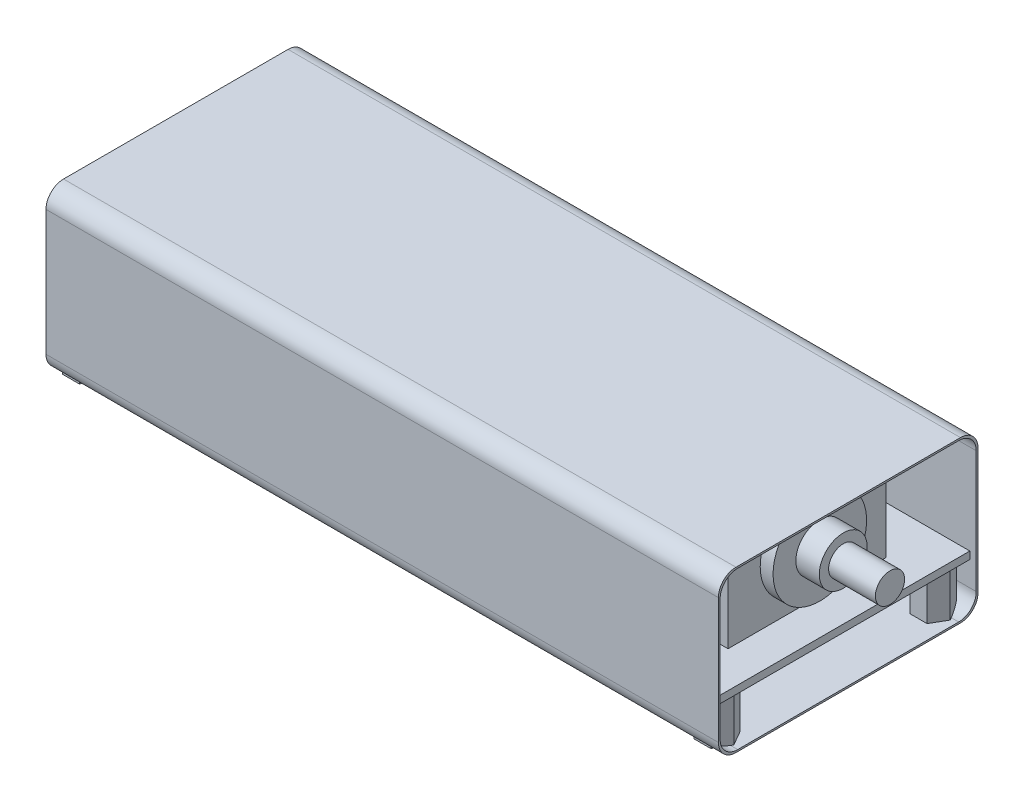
ISO-10303-21;
HEADER;
FILE_DESCRIPTION(('STEP AP214'),'2;1');
FILE_NAME('part.step','',(''),(''),'','','');
FILE_SCHEMA(('AUTOMOTIVE_DESIGN { 1 0 10303 214 1 1 1 1 }'));
ENDSEC;
DATA;
#1=APPLICATION_CONTEXT('core data for automotive mechanical design processes');
#2=APPLICATION_PROTOCOL_DEFINITION('international standard','automotive_design',2000,#1);
#3=PRODUCT_CONTEXT('',#1,'mechanical');
#4=PRODUCT('Part','Part','',(#3));
#5=PRODUCT_RELATED_PRODUCT_CATEGORY('part','',(#4));
#6=PRODUCT_DEFINITION_FORMATION('','',#4);
#7=PRODUCT_DEFINITION_CONTEXT('part definition',#1,'design');
#8=PRODUCT_DEFINITION('design','',#6,#7);
#9=PRODUCT_DEFINITION_SHAPE('','',#8);
#10=(LENGTH_UNIT() NAMED_UNIT(*) SI_UNIT(.MILLI.,.METRE.));
#11=(NAMED_UNIT(*) PLANE_ANGLE_UNIT() SI_UNIT($,.RADIAN.));
#12=(NAMED_UNIT(*) SI_UNIT($,.STERADIAN.) SOLID_ANGLE_UNIT());
#13=UNCERTAINTY_MEASURE_WITH_UNIT(LENGTH_MEASURE(1.E-05),#10,'distance_accuracy_value','');
#14=(GEOMETRIC_REPRESENTATION_CONTEXT(3) GLOBAL_UNCERTAINTY_ASSIGNED_CONTEXT((#13)) GLOBAL_UNIT_ASSIGNED_CONTEXT((#10,
#11,#12)) REPRESENTATION_CONTEXT('',''));
#15=CARTESIAN_POINT('',(0.,0.,0.));
#16=DIRECTION('',(0.,0.,1.));
#17=DIRECTION('',(1.,0.,0.));
#18=AXIS2_PLACEMENT_3D('',#15,#16,#17);
#19=CARTESIAN_POINT('',(0.,14.3002000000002,-54.9910000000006));
#20=DIRECTION('',(0.,1.00000000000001,0.));
#21=DIRECTION('',(0.,0.,1.00000000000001));
#22=AXIS2_PLACEMENT_3D('',#19,#20,#21);
#23=PLANE('',#22);
#24=DIRECTION('',(-1.,0.,0.));
#25=VECTOR('',#24,1.);
#26=CARTESIAN_POINT('',(0.,14.3002000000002,-5.08000000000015));
#27=LINE('',#26,#25);
#28=CARTESIAN_POINT('',(40.64,14.3002000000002,-5.08000000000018));
#29=VERTEX_POINT('',#28);
#30=CARTESIAN_POINT('',(33.02,14.3002000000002,-5.08000000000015));
#31=VERTEX_POINT('',#30);
#32=EDGE_CURVE('E1174',#29,#31,#27,.T.);
#33=ORIENTED_EDGE('',*,*,#32,.T.);
#34=DIRECTION('',(0.,0.,-1.00000000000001));
#35=VECTOR('',#34,1.);
#36=CARTESIAN_POINT('',(33.02,14.3002000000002,-54.9910000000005));
#37=LINE('',#36,#35);
#38=CARTESIAN_POINT('',(33.02,14.3002000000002,-7.62000000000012));
#39=VERTEX_POINT('',#38);
#40=EDGE_CURVE('E1177',#31,#39,#37,.T.);
#41=ORIENTED_EDGE('',*,*,#40,.T.);
#42=DIRECTION('',(1.,0.,0.));
#43=VECTOR('',#42,1.);
#44=CARTESIAN_POINT('',(0.,14.3002000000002,-7.62000000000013));
#45=LINE('',#44,#43);
#46=CARTESIAN_POINT('',(40.64,14.3002000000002,-7.62000000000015));
#47=VERTEX_POINT('',#46);
#48=EDGE_CURVE('E1168',#39,#47,#45,.T.);
#49=ORIENTED_EDGE('',*,*,#48,.T.);
#50=DIRECTION('',(0.,0.,1.00000000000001));
#51=VECTOR('',#50,1.);
#52=CARTESIAN_POINT('',(40.64,14.3002000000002,-54.9910000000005));
#53=LINE('',#52,#51);
#54=EDGE_CURVE('E1171',#47,#29,#53,.T.);
#55=ORIENTED_EDGE('',*,*,#54,.T.);
#56=EDGE_LOOP('',(#33,#41,#49,#55));
#57=FACE_BOUND('',#56,.T.);
#58=DIRECTION('',(-1.,0.,0.));
#59=VECTOR('',#58,1.);
#60=CARTESIAN_POINT('',(0.,14.3002000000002,-37.6555000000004));
#61=LINE('',#60,#59);
#62=CARTESIAN_POINT('',(6.34999999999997,14.3002000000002,-37.6555000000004));
#63=VERTEX_POINT('',#62);
#64=CARTESIAN_POINT('',(0.,14.3002000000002,-37.6555000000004));
#65=VERTEX_POINT('',#64);
#66=EDGE_CURVE('E1138',#63,#65,#61,.T.);
#67=ORIENTED_EDGE('',*,*,#66,.F.);
#68=DIRECTION('',(0.,0.,-1.00000000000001));
#69=VECTOR('',#68,1.);
#70=CARTESIAN_POINT('',(6.34999999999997,14.3002000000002,-54.9910000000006));
#71=LINE('',#70,#69);
#72=CARTESIAN_POINT('',(6.34999999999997,14.3002000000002,-17.3355000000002));
#73=VERTEX_POINT('',#72);
#74=EDGE_CURVE('E1131',#73,#63,#71,.T.);
#75=ORIENTED_EDGE('',*,*,#74,.F.);
#76=DIRECTION('',(1.,0.,0.));
#77=VECTOR('',#76,1.);
#78=CARTESIAN_POINT('',(0.,14.3002000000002,-17.3355000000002));
#79=LINE('',#78,#77);
#80=CARTESIAN_POINT('',(0.,14.3002000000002,-17.3355000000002));
#81=VERTEX_POINT('',#80);
#82=EDGE_CURVE('E1134',#81,#73,#79,.T.);
#83=ORIENTED_EDGE('',*,*,#82,.F.);
#84=DIRECTION('',(0.,0.,-1.00000000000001));
#85=VECTOR('',#84,1.);
#86=CARTESIAN_POINT('',(0.,14.3002000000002,0.));
#87=LINE('',#86,#85);
#88=CARTESIAN_POINT('',(0.,14.3002000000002,0.));
#89=VERTEX_POINT('',#88);
#90=EDGE_CURVE('E1100',#89,#81,#87,.T.);
#91=ORIENTED_EDGE('',*,*,#90,.F.);
#92=DIRECTION('',(1.,0.,0.));
#93=VECTOR('',#92,1.);
#94=CARTESIAN_POINT('',(0.,14.3002000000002,0.));
#95=LINE('',#94,#93);
#96=CARTESIAN_POINT('',(87.884,14.3002000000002,-1.45716771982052E-13));
#97=VERTEX_POINT('',#96);
#98=EDGE_CURVE('E1110',#89,#97,#95,.T.);
#99=ORIENTED_EDGE('',*,*,#98,.T.);
#100=DIRECTION('',(0.,0.,1.00000000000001));
#101=VECTOR('',#100,1.);
#102=CARTESIAN_POINT('',(87.884,14.3002000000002,-54.9910000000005));
#103=LINE('',#102,#101);
#104=CARTESIAN_POINT('',(87.884,14.3002000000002,-54.9910000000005));
#105=VERTEX_POINT('',#104);
#106=EDGE_CURVE('E1107',#105,#97,#103,.T.);
#107=ORIENTED_EDGE('',*,*,#106,.F.);
#108=DIRECTION('',(-1.,0.,0.));
#109=VECTOR('',#108,1.);
#110=CARTESIAN_POINT('',(87.884,14.3002000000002,-54.9910000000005));
#111=LINE('',#110,#109);
#112=CARTESIAN_POINT('',(0.,14.3002000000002,-54.9910000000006));
#113=VERTEX_POINT('',#112);
#114=EDGE_CURVE('E1103',#105,#113,#111,.T.);
#115=ORIENTED_EDGE('',*,*,#114,.T.);
#116=EDGE_CURVE('E1104',#65,#113,#87,.T.);
#117=ORIENTED_EDGE('',*,*,#116,.F.);
#118=EDGE_LOOP('',(#67,#75,#83,#91,#99,#107,#115,#117));
#119=FACE_BOUND('',#118,.T.);
#120=DIRECTION('',(-1.,0.,0.));
#121=VECTOR('',#120,1.);
#122=CARTESIAN_POINT('',(0.,14.3002000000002,-42.2910000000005));
#123=LINE('',#122,#121);
#124=CARTESIAN_POINT('',(7.61999999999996,14.3002000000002,-42.2910000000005));
#125=VERTEX_POINT('',#124);
#126=CARTESIAN_POINT('',(2.53999999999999,14.3002000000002,-42.2910000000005));
#127=VERTEX_POINT('',#126);
#128=EDGE_CURVE('E38',#125,#127,#123,.T.);
#129=ORIENTED_EDGE('',*,*,#128,.T.);
#130=DIRECTION('',(0.,0.,-1.00000000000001));
#131=VECTOR('',#130,1.);
#132=CARTESIAN_POINT('',(2.53999999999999,14.3002000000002,-54.9910000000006));
#133=LINE('',#132,#131);
#134=CARTESIAN_POINT('',(2.53999999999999,14.3002000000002,-52.4510000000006));
#135=VERTEX_POINT('',#134);
#136=EDGE_CURVE('E11',#127,#135,#133,.T.);
#137=ORIENTED_EDGE('',*,*,#136,.T.);
#138=DIRECTION('',(1.,0.,0.));
#139=VECTOR('',#138,1.);
#140=CARTESIAN_POINT('',(0.,14.3002000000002,-52.4510000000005));
#141=LINE('',#140,#139);
#142=CARTESIAN_POINT('',(7.61999999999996,14.3002000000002,-52.4510000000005));
#143=VERTEX_POINT('',#142);
#144=EDGE_CURVE('E1180',#135,#143,#141,.T.);
#145=ORIENTED_EDGE('',*,*,#144,.T.);
#146=DIRECTION('',(0.,0.,1.00000000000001));
#147=VECTOR('',#146,1.);
#148=CARTESIAN_POINT('',(7.61999999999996,14.3002000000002,-54.9910000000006));
#149=LINE('',#148,#147);
#150=EDGE_CURVE('E1183',#143,#125,#149,.T.);
#151=ORIENTED_EDGE('',*,*,#150,.T.);
#152=EDGE_LOOP('',(#129,#137,#145,#151));
#153=FACE_BOUND('',#152,.T.);
#154=ADVANCED_FACE('F30',(#57,#119,#153),#23,.T.);
#155=CARTESIAN_POINT('',(0.,0.,0.));
#156=DIRECTION('',(0.,-1.00000000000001,0.));
#157=DIRECTION('',(0.,0.,-1.00000000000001));
#158=AXIS2_PLACEMENT_3D('',#155,#156,#157);
#159=PLANE('',#158);
#160=DIRECTION('',(1.,0.,0.));
#161=VECTOR('',#160,1.);
#162=CARTESIAN_POINT('',(57.7365751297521,1.38777878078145E-13,-20.7534232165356));
#163=LINE('',#162,#161);
#164=CARTESIAN_POINT('',(57.7365751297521,1.38777878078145E-13,-20.7534232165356));
#165=VERTEX_POINT('',#164);
#166=CARTESIAN_POINT('',(77.7894013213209,1.2490009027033E-13,-20.7534232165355));
#167=VERTEX_POINT('',#166);
#168=EDGE_CURVE('E1050',#165,#167,#163,.T.);
#169=ORIENTED_EDGE('',*,*,#168,.F.);
#170=DIRECTION('',(0.,0.,-1.00000000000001));
#171=VECTOR('',#170,1.);
#172=CARTESIAN_POINT('',(57.7365751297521,0.,-8.05342321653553));
#173=LINE('',#172,#171);
#174=CARTESIAN_POINT('',(57.7365751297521,0.,-8.05342321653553));
#175=VERTEX_POINT('',#174);
#176=EDGE_CURVE('E1033',#175,#165,#173,.T.);
#177=ORIENTED_EDGE('',*,*,#176,.F.);
#178=DIRECTION('',(-1.,0.,0.));
#179=VECTOR('',#178,1.);
#180=CARTESIAN_POINT('',(57.7365751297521,0.,-8.05342321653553));
#181=LINE('',#180,#179);
#182=CARTESIAN_POINT('',(77.7894013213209,0.,-8.05342321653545));
#183=VERTEX_POINT('',#182);
#184=EDGE_CURVE('E1038',#183,#175,#181,.T.);
#185=ORIENTED_EDGE('',*,*,#184,.F.);
#186=DIRECTION('',(0.,0.,1.00000000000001));
#187=VECTOR('',#186,1.);
#188=CARTESIAN_POINT('',(77.7894013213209,0.,-8.05342321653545));
#189=LINE('',#188,#187);
#190=EDGE_CURVE('E1052',#167,#183,#189,.T.);
#191=ORIENTED_EDGE('',*,*,#190,.F.);
#192=EDGE_LOOP('',(#169,#177,#185,#191));
#193=FACE_BOUND('',#192,.T.);
#194=DIRECTION('',(0.,0.,-1.00000000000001));
#195=VECTOR('',#194,1.);
#196=CARTESIAN_POINT('',(0.,0.,0.));
#197=LINE('',#196,#195);
#198=CARTESIAN_POINT('',(0.,0.,0.));
#199=VERTEX_POINT('',#198);
#200=CARTESIAN_POINT('',(0.,1.52655665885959E-13,-54.9910000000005));
#201=VERTEX_POINT('',#200);
#202=EDGE_CURVE('E1125',#199,#201,#197,.T.);
#203=ORIENTED_EDGE('',*,*,#202,.T.);
#204=DIRECTION('',(-1.,0.,0.));
#205=VECTOR('',#204,1.);
#206=CARTESIAN_POINT('',(145.034,1.80411241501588E-13,-54.9910000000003));
#207=LINE('',#206,#205);
#208=CARTESIAN_POINT('',(145.034,1.80411241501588E-13,-54.9910000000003));
#209=VERTEX_POINT('',#208);
#210=EDGE_CURVE('E1502',#209,#201,#207,.T.);
#211=ORIENTED_EDGE('',*,*,#210,.F.);
#212=DIRECTION('',(0.,0.,1.00000000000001));
#213=VECTOR('',#212,1.);
#214=CARTESIAN_POINT('',(145.034,1.80411241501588E-13,-54.9910000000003));
#215=LINE('',#214,#213);
#216=CARTESIAN_POINT('',(145.034,0.,0.));
#217=VERTEX_POINT('',#216);
#218=EDGE_CURVE('E1511',#209,#217,#215,.T.);
#219=ORIENTED_EDGE('',*,*,#218,.T.);
#220=DIRECTION('',(1.,0.,0.));
#221=VECTOR('',#220,1.);
#222=CARTESIAN_POINT('',(0.,0.,0.));
#223=LINE('',#222,#221);
#224=EDGE_CURVE('E1517',#199,#217,#223,.T.);
#225=ORIENTED_EDGE('',*,*,#224,.F.);
#226=EDGE_LOOP('',(#203,#211,#219,#225));
#227=FACE_BOUND('',#226,.T.);
#228=DIRECTION('',(1.,0.,0.));
#229=VECTOR('',#228,1.);
#230=CARTESIAN_POINT('',(57.7365751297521,1.66533453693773E-13,-44.8083622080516));
#231=LINE('',#230,#229);
#232=CARTESIAN_POINT('',(57.7365751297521,1.66533453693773E-13,-44.8083622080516));
#233=VERTEX_POINT('',#232);
#234=CARTESIAN_POINT('',(77.7894013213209,1.38777878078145E-13,-44.8083622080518));
#235=VERTEX_POINT('',#234);
#236=EDGE_CURVE('E1018',#233,#235,#231,.T.);
#237=ORIENTED_EDGE('',*,*,#236,.F.);
#238=DIRECTION('',(0.,0.,-1.00000000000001));
#239=VECTOR('',#238,1.);
#240=CARTESIAN_POINT('',(57.7365751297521,1.38777878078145E-13,-32.1083622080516));
#241=LINE('',#240,#239);
#242=CARTESIAN_POINT('',(57.7365751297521,1.38777878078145E-13,-32.1083622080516));
#243=VERTEX_POINT('',#242);
#244=EDGE_CURVE('E1001',#243,#233,#241,.T.);
#245=ORIENTED_EDGE('',*,*,#244,.F.);
#246=DIRECTION('',(-1.,0.,0.));
#247=VECTOR('',#246,1.);
#248=CARTESIAN_POINT('',(57.7365751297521,1.38777878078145E-13,-32.1083622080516));
#249=LINE('',#248,#247);
#250=CARTESIAN_POINT('',(77.7894013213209,1.2490009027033E-13,-32.1083622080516));
#251=VERTEX_POINT('',#250);
#252=EDGE_CURVE('E1006',#251,#243,#249,.T.);
#253=ORIENTED_EDGE('',*,*,#252,.F.);
#254=DIRECTION('',(0.,0.,1.00000000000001));
#255=VECTOR('',#254,1.);
#256=CARTESIAN_POINT('',(77.7894013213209,1.2490009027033E-13,-32.1083622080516));
#257=LINE('',#256,#255);
#258=EDGE_CURVE('E1020',#235,#251,#257,.T.);
#259=ORIENTED_EDGE('',*,*,#258,.F.);
#260=EDGE_LOOP('',(#237,#245,#253,#259));
#261=FACE_BOUND('',#260,.T.);
#262=DIRECTION('',(1.,0.,0.));
#263=VECTOR('',#262,1.);
#264=CARTESIAN_POINT('',(139.263912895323,2.08166817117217E-13,-7.17550000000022));
#265=LINE('',#264,#263);
#266=CARTESIAN_POINT('',(139.263912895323,2.08166817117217E-13,-7.17550000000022));
#267=VERTEX_POINT('',#266);
#268=CARTESIAN_POINT('',(142.930087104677,1.94289029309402E-13,-7.17550000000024));
#269=VERTEX_POINT('',#268);
#270=EDGE_CURVE('E909',#267,#269,#265,.T.);
#271=ORIENTED_EDGE('',*,*,#270,.F.);
#272=DIRECTION('',(0.5,0.,-0.866025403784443));
#273=VECTOR('',#272,1.);
#274=CARTESIAN_POINT('',(137.430825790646,0.,-4.00050000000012));
#275=LINE('',#274,#273);
#276=CARTESIAN_POINT('',(137.430825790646,0.,-4.00050000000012));
#277=VERTEX_POINT('',#276);
#278=EDGE_CURVE('E886',#277,#267,#275,.T.);
#279=ORIENTED_EDGE('',*,*,#278,.F.);
#280=DIRECTION('',(-0.499999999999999,0.,-0.866025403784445));
#281=VECTOR('',#280,1.);
#282=CARTESIAN_POINT('',(139.263912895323,0.,-0.825500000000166));
#283=LINE('',#282,#281);
#284=CARTESIAN_POINT('',(139.263912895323,0.,-0.825500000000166));
#285=VERTEX_POINT('',#284);
#286=EDGE_CURVE('E891',#285,#277,#283,.T.);
#287=ORIENTED_EDGE('',*,*,#286,.F.);
#288=DIRECTION('',(-1.,0.,0.));
#289=VECTOR('',#288,1.);
#290=CARTESIAN_POINT('',(142.930087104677,0.,-0.825500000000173));
#291=LINE('',#290,#289);
#292=CARTESIAN_POINT('',(142.930087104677,0.,-0.825500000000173));
#293=VERTEX_POINT('',#292);
#294=EDGE_CURVE('E916',#293,#285,#291,.T.);
#295=ORIENTED_EDGE('',*,*,#294,.F.);
#296=DIRECTION('',(-0.500000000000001,0.,0.866025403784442));
#297=VECTOR('',#296,1.);
#298=CARTESIAN_POINT('',(144.763174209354,1.66533453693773E-13,-4.00050000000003));
#299=LINE('',#298,#297);
#300=CARTESIAN_POINT('',(144.763174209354,1.66533453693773E-13,-4.00050000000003));
#301=VERTEX_POINT('',#300);
#302=EDGE_CURVE('E913',#301,#293,#299,.T.);
#303=ORIENTED_EDGE('',*,*,#302,.F.);
#304=DIRECTION('',(0.500000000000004,0.,0.866025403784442));
#305=VECTOR('',#304,1.);
#306=CARTESIAN_POINT('',(142.930087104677,1.94289029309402E-13,-7.17550000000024));
#307=LINE('',#306,#305);
#308=EDGE_CURVE('E911',#269,#301,#307,.T.);
#309=ORIENTED_EDGE('',*,*,#308,.F.);
#310=EDGE_LOOP('',(#271,#279,#287,#295,#303,#309));
#311=FACE_BOUND('',#310,.T.);
#312=DIRECTION('',(0.499999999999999,0.,-0.866025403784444));
#313=VECTOR('',#312,1.);
#314=CARTESIAN_POINT('',(137.430825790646,2.08166817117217E-13,-50.9905000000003));
#315=LINE('',#314,#313);
#316=CARTESIAN_POINT('',(137.430825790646,2.08166817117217E-13,-50.9905000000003));
#317=VERTEX_POINT('',#316);
#318=CARTESIAN_POINT('',(139.263912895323,1.38777878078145E-13,-54.1655000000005));
#319=VERTEX_POINT('',#318);
#320=EDGE_CURVE('E858',#317,#319,#315,.T.);
#321=ORIENTED_EDGE('',*,*,#320,.F.);
#322=DIRECTION('',(-0.499999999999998,0.,-0.866025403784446));
#323=VECTOR('',#322,1.);
#324=CARTESIAN_POINT('',(139.263912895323,1.2490009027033E-13,-47.8155000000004));
#325=LINE('',#324,#323);
#326=CARTESIAN_POINT('',(139.263912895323,1.2490009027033E-13,-47.8155000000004));
#327=VERTEX_POINT('',#326);
#328=EDGE_CURVE('E835',#327,#317,#325,.T.);
#329=ORIENTED_EDGE('',*,*,#328,.F.);
#330=DIRECTION('',(-1.,0.,0.));
#331=VECTOR('',#330,1.);
#332=CARTESIAN_POINT('',(142.930087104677,1.11022302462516E-13,-47.8155000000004));
#333=LINE('',#332,#331);
#334=CARTESIAN_POINT('',(142.930087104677,1.11022302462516E-13,-47.8155000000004));
#335=VERTEX_POINT('',#334);
#336=EDGE_CURVE('E840',#335,#327,#333,.T.);
#337=ORIENTED_EDGE('',*,*,#336,.F.);
#338=DIRECTION('',(-0.499999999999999,0.,0.866025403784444));
#339=VECTOR('',#338,1.);
#340=CARTESIAN_POINT('',(144.763174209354,1.80411241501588E-13,-50.9905000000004));
#341=LINE('',#340,#339);
#342=CARTESIAN_POINT('',(144.763174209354,1.80411241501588E-13,-50.9905000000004));
#343=VERTEX_POINT('',#342);
#344=EDGE_CURVE('E866',#343,#335,#341,.T.);
#345=ORIENTED_EDGE('',*,*,#344,.F.);
#346=DIRECTION('',(0.499999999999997,0.,0.866025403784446));
#347=VECTOR('',#346,1.);
#348=CARTESIAN_POINT('',(142.930087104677,1.38777878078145E-13,-54.1655000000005));
#349=LINE('',#348,#347);
#350=CARTESIAN_POINT('',(142.930087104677,1.38777878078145E-13,-54.1655000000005));
#351=VERTEX_POINT('',#350);
#352=EDGE_CURVE('E864',#351,#343,#349,.T.);
#353=ORIENTED_EDGE('',*,*,#352,.F.);
#354=DIRECTION('',(1.,0.,0.));
#355=VECTOR('',#354,1.);
#356=CARTESIAN_POINT('',(139.263912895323,1.38777878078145E-13,-54.1655000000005));
#357=LINE('',#356,#355);
#358=EDGE_CURVE('E861',#319,#351,#357,.T.);
#359=ORIENTED_EDGE('',*,*,#358,.F.);
#360=EDGE_LOOP('',(#321,#329,#337,#345,#353,#359));
#361=FACE_BOUND('',#360,.T.);
#362=DIRECTION('',(1.,0.,0.));
#363=VECTOR('',#362,1.);
#364=CARTESIAN_POINT('',(2.10391289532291,2.08166817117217E-13,-7.17550000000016));
#365=LINE('',#364,#363);
#366=CARTESIAN_POINT('',(2.10391289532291,2.08166817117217E-13,-7.17550000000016));
#367=VERTEX_POINT('',#366);
#368=CARTESIAN_POINT('',(5.77008710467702,1.80411241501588E-13,-7.17550000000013));
#369=VERTEX_POINT('',#368);
#370=EDGE_CURVE('E807',#367,#369,#365,.T.);
#371=ORIENTED_EDGE('',*,*,#370,.F.);
#372=DIRECTION('',(0.5,0.,-0.866025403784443));
#373=VECTOR('',#372,1.);
#374=CARTESIAN_POINT('',(0.270825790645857,1.80411241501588E-13,-4.00050000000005));
#375=LINE('',#374,#373);
#376=CARTESIAN_POINT('',(0.270825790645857,1.80411241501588E-13,-4.00050000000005));
#377=VERTEX_POINT('',#376);
#378=EDGE_CURVE('E784',#377,#367,#375,.T.);
#379=ORIENTED_EDGE('',*,*,#378,.F.);
#380=DIRECTION('',(-0.5,0.,-0.866025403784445));
#381=VECTOR('',#380,1.);
#382=CARTESIAN_POINT('',(2.10391289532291,0.,-0.825500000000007));
#383=LINE('',#382,#381);
#384=CARTESIAN_POINT('',(2.10391289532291,0.,-0.825500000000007));
#385=VERTEX_POINT('',#384);
#386=EDGE_CURVE('E789',#385,#377,#383,.T.);
#387=ORIENTED_EDGE('',*,*,#386,.F.);
#388=DIRECTION('',(-1.,0.,0.));
#389=VECTOR('',#388,1.);
#390=CARTESIAN_POINT('',(5.77008710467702,0.,-0.825500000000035));
#391=LINE('',#390,#389);
#392=CARTESIAN_POINT('',(5.77008710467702,0.,-0.825500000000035));
#393=VERTEX_POINT('',#392);
#394=EDGE_CURVE('E814',#393,#385,#391,.T.);
#395=ORIENTED_EDGE('',*,*,#394,.F.);
#396=DIRECTION('',(-0.5,0.,0.866025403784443));
#397=VECTOR('',#396,1.);
#398=CARTESIAN_POINT('',(7.60317420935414,1.38777878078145E-13,-4.00050000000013));
#399=LINE('',#398,#397);
#400=CARTESIAN_POINT('',(7.60317420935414,1.38777878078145E-13,-4.00050000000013));
#401=VERTEX_POINT('',#400);
#402=EDGE_CURVE('E811',#401,#393,#399,.T.);
#403=ORIENTED_EDGE('',*,*,#402,.F.);
#404=DIRECTION('',(0.5,0.,0.866025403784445));
#405=VECTOR('',#404,1.);
#406=CARTESIAN_POINT('',(5.77008710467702,1.80411241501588E-13,-7.17550000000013));
#407=LINE('',#406,#405);
#408=EDGE_CURVE('E809',#369,#401,#407,.T.);
#409=ORIENTED_EDGE('',*,*,#408,.F.);
#410=EDGE_LOOP('',(#371,#379,#387,#395,#403,#409));
#411=FACE_BOUND('',#410,.T.);
#412=DIRECTION('',(0.5,0.,-0.866025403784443));
#413=VECTOR('',#412,1.);
#414=CARTESIAN_POINT('',(0.270825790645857,1.66533453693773E-13,-50.9905000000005));
#415=LINE('',#414,#413);
#416=CARTESIAN_POINT('',(0.270825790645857,1.66533453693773E-13,-50.9905000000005));
#417=VERTEX_POINT('',#416);
#418=CARTESIAN_POINT('',(2.10391289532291,1.2490009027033E-13,-54.1655000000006));
#419=VERTEX_POINT('',#418);
#420=EDGE_CURVE('E756',#417,#419,#415,.T.);
#421=ORIENTED_EDGE('',*,*,#420,.F.);
#422=DIRECTION('',(-0.499999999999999,0.,-0.866025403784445));
#423=VECTOR('',#422,1.);
#424=CARTESIAN_POINT('',(2.10391289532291,1.66533453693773E-13,-47.8155000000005));
#425=LINE('',#424,#423);
#426=CARTESIAN_POINT('',(2.10391289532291,1.66533453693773E-13,-47.8155000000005));
#427=VERTEX_POINT('',#426);
#428=EDGE_CURVE('E733',#427,#417,#425,.T.);
#429=ORIENTED_EDGE('',*,*,#428,.F.);
#430=DIRECTION('',(-1.,0.,0.));
#431=VECTOR('',#430,1.);
#432=CARTESIAN_POINT('',(5.77008710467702,1.80411241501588E-13,-47.8155000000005));
#433=LINE('',#432,#431);
#434=CARTESIAN_POINT('',(5.77008710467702,1.80411241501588E-13,-47.8155000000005));
#435=VERTEX_POINT('',#434);
#436=EDGE_CURVE('E738',#435,#427,#433,.T.);
#437=ORIENTED_EDGE('',*,*,#436,.F.);
#438=DIRECTION('',(-0.5,0.,0.866025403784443));
#439=VECTOR('',#438,1.);
#440=CARTESIAN_POINT('',(7.60317420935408,1.80411241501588E-13,-50.9905000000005));
#441=LINE('',#440,#439);
#442=CARTESIAN_POINT('',(7.60317420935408,1.80411241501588E-13,-50.9905000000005));
#443=VERTEX_POINT('',#442);
#444=EDGE_CURVE('E764',#443,#435,#441,.T.);
#445=ORIENTED_EDGE('',*,*,#444,.F.);
#446=DIRECTION('',(0.499999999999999,0.,0.866025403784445));
#447=VECTOR('',#446,1.);
#448=CARTESIAN_POINT('',(5.77008710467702,1.38777878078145E-13,-54.1655000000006));
#449=LINE('',#448,#447);
#450=CARTESIAN_POINT('',(5.77008710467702,1.38777878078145E-13,-54.1655000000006));
#451=VERTEX_POINT('',#450);
#452=EDGE_CURVE('E762',#451,#443,#449,.T.);
#453=ORIENTED_EDGE('',*,*,#452,.F.);
#454=DIRECTION('',(1.,0.,0.));
#455=VECTOR('',#454,1.);
#456=CARTESIAN_POINT('',(2.10391289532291,1.2490009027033E-13,-54.1655000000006));
#457=LINE('',#456,#455);
#458=EDGE_CURVE('E759',#419,#451,#457,.T.);
#459=ORIENTED_EDGE('',*,*,#458,.F.);
#460=EDGE_LOOP('',(#421,#429,#437,#445,#453,#459));
#461=FACE_BOUND('',#460,.T.);
#462=ADVANCED_FACE('F1459',(#193,#227,#261,#311,#361,#411,#461),#159,.T.);
#463=CARTESIAN_POINT('',(137.16,24.2062000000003,-10.3505000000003));
#464=DIRECTION('',(-1.,0.,0.));
#465=DIRECTION('',(0.,0.,1.00000000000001));
#466=AXIS2_PLACEMENT_3D('',#463,#464,#465);
#467=PLANE('',#466);
#468=DIRECTION('',(0.,0.,-1.00000000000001));
#469=VECTOR('',#468,1.);
#470=CARTESIAN_POINT('',(137.16,1.60020000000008,-10.3505000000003));
#471=LINE('',#470,#469);
#472=CARTESIAN_POINT('',(137.16,1.60020000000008,-10.3505000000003));
#473=VERTEX_POINT('',#472);
#474=CARTESIAN_POINT('',(137.16,1.60020000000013,-44.6405000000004));
#475=VERTEX_POINT('',#474);
#476=EDGE_CURVE('E985',#473,#475,#471,.T.);
#477=ORIENTED_EDGE('',*,*,#476,.T.);
#478=DIRECTION('',(0.,-1.00000000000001,0.));
#479=VECTOR('',#478,1.);
#480=CARTESIAN_POINT('',(137.16,24.2062000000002,-44.6405000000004));
#481=LINE('',#480,#479);
#482=CARTESIAN_POINT('',(137.16,24.2062000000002,-44.6405000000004));
#483=VERTEX_POINT('',#482);
#484=EDGE_CURVE('E992',#483,#475,#481,.T.);
#485=ORIENTED_EDGE('',*,*,#484,.F.);
#486=DIRECTION('',(0.,0.,-1.00000000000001));
#487=VECTOR('',#486,1.);
#488=CARTESIAN_POINT('',(137.16,24.2062000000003,-10.3505000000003));
#489=LINE('',#488,#487);
#490=CARTESIAN_POINT('',(137.16,24.2062000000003,-10.3505000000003));
#491=VERTEX_POINT('',#490);
#492=EDGE_CURVE('E976',#491,#483,#489,.T.);
#493=ORIENTED_EDGE('',*,*,#492,.F.);
#494=DIRECTION('',(0.,-1.00000000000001,0.));
#495=VECTOR('',#494,1.);
#496=CARTESIAN_POINT('',(137.16,24.2062000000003,-10.3505000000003));
#497=LINE('',#496,#495);
#498=EDGE_CURVE('E995',#491,#473,#497,.T.);
#499=ORIENTED_EDGE('',*,*,#498,.T.);
#500=EDGE_LOOP('',(#477,#485,#493,#499));
#501=FACE_BOUND('',#500,.T.);
#502=CARTESIAN_POINT('',(137.16,13.5382000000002,-27.4955000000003));
#503=DIRECTION('',(-1.,0.,0.));
#504=DIRECTION('',(0.,0.,1.00000000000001));
#505=AXIS2_PLACEMENT_3D('',#502,#503,#504);
#506=CIRCLE('',#505,10.16);
#507=CARTESIAN_POINT('',(137.16,13.5382000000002,-17.3355000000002));
#508=VERTEX_POINT('',#507);
#509=EDGE_CURVE('E1144',#508,#508,#506,.F.);
#510=ORIENTED_EDGE('',*,*,#509,.F.);
#511=EDGE_LOOP('',(#510));
#512=FACE_BOUND('',#511,.T.);
#513=ADVANCED_FACE('F1465',(#501,#512),#467,.F.);
#514=CARTESIAN_POINT('',(0.,1.60020000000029,0.));
#515=DIRECTION('',(0.,-1.00000000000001,0.));
#516=DIRECTION('',(0.,0.,-1.00000000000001));
#517=AXIS2_PLACEMENT_3D('',#514,#515,#516);
#518=PLANE('',#517);
#519=DIRECTION('',(-1.,0.,0.));
#520=VECTOR('',#519,1.);
#521=CARTESIAN_POINT('',(145.034,1.60020000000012,-54.9910000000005));
#522=LINE('',#521,#520);
#523=CARTESIAN_POINT('',(145.034,1.60020000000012,-54.9910000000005));
#524=VERTEX_POINT('',#523);
#525=CARTESIAN_POINT('',(87.884,1.60020000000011,-54.9910000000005));
#526=VERTEX_POINT('',#525);
#527=EDGE_CURVE('E1121',#524,#526,#522,.T.);
#528=ORIENTED_EDGE('',*,*,#527,.T.);
#529=DIRECTION('',(0.,0.,1.00000000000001));
#530=VECTOR('',#529,1.);
#531=CARTESIAN_POINT('',(87.884,1.60020000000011,-54.9910000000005));
#532=LINE('',#531,#530);
#533=CARTESIAN_POINT('',(87.884,1.60020000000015,-1.04083408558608E-13));
#534=VERTEX_POINT('',#533);
#535=EDGE_CURVE('E1099',#526,#534,#532,.T.);
#536=ORIENTED_EDGE('',*,*,#535,.T.);
#537=DIRECTION('',(1.,0.,0.));
#538=VECTOR('',#537,1.);
#539=CARTESIAN_POINT('',(0.,1.60020000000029,0.));
#540=LINE('',#539,#538);
#541=CARTESIAN_POINT('',(145.034,1.60020000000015,0.));
#542=VERTEX_POINT('',#541);
#543=EDGE_CURVE('E1529',#534,#542,#540,.T.);
#544=ORIENTED_EDGE('',*,*,#543,.T.);
#545=DIRECTION('',(0.,0.,1.00000000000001));
#546=VECTOR('',#545,1.);
#547=CARTESIAN_POINT('',(145.034,1.60020000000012,-54.9910000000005));
#548=LINE('',#547,#546);
#549=EDGE_CURVE('E1530',#524,#542,#548,.T.);
#550=ORIENTED_EDGE('',*,*,#549,.F.);
#551=EDGE_LOOP('',(#528,#536,#544,#550));
#552=FACE_BOUND('',#551,.T.);
#553=DIRECTION('',(0.,0.,1.00000000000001));
#554=VECTOR('',#553,1.);
#555=CARTESIAN_POINT('',(124.714,1.60020000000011,-44.6405000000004));
#556=LINE('',#555,#554);
#557=CARTESIAN_POINT('',(124.714,1.60020000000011,-44.6405000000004));
#558=VERTEX_POINT('',#557);
#559=CARTESIAN_POINT('',(124.714,1.60020000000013,-10.3505000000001));
#560=VERTEX_POINT('',#559);
#561=EDGE_CURVE('E969',#558,#560,#556,.T.);
#562=ORIENTED_EDGE('',*,*,#561,.F.);
#563=DIRECTION('',(-1.,0.,0.));
#564=VECTOR('',#563,1.);
#565=CARTESIAN_POINT('',(137.16,1.60020000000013,-44.6405000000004));
#566=LINE('',#565,#564);
#567=EDGE_CURVE('E973',#475,#558,#566,.T.);
#568=ORIENTED_EDGE('',*,*,#567,.F.);
#569=ORIENTED_EDGE('',*,*,#476,.F.);
#570=DIRECTION('',(-1.,0.,0.));
#571=VECTOR('',#570,1.);
#572=CARTESIAN_POINT('',(137.16,1.60020000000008,-10.3505000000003));
#573=LINE('',#572,#571);
#574=EDGE_CURVE('E983',#473,#560,#573,.T.);
#575=ORIENTED_EDGE('',*,*,#574,.T.);
#576=EDGE_LOOP('',(#562,#568,#569,#575));
#577=FACE_BOUND('',#576,.T.);
#578=ADVANCED_FACE('F1479',(#552,#577),#518,.F.);
#579=CARTESIAN_POINT('',(0.,1.60020000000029,0.));
#580=DIRECTION('',(-1.,0.,0.));
#581=DIRECTION('',(0.,0.,1.00000000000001));
#582=AXIS2_PLACEMENT_3D('',#579,#580,#581);
#583=PLANE('',#582);
#584=DIRECTION('',(0.,-1.00000000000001,0.));
#585=VECTOR('',#584,1.);
#586=CARTESIAN_POINT('',(0.,1.60020000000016,-37.6555000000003));
#587=LINE('',#586,#585);
#588=CARTESIAN_POINT('',(0.,8.89000000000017,-37.6555000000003));
#589=VERTEX_POINT('',#588);
#590=EDGE_CURVE('E1096',#65,#589,#587,.T.);
#591=ORIENTED_EDGE('',*,*,#590,.F.);
#592=ORIENTED_EDGE('',*,*,#116,.T.);
#593=DIRECTION('',(0.,-1.00000000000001,0.));
#594=VECTOR('',#593,1.);
#595=CARTESIAN_POINT('',(0.,1.60020000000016,-54.9910000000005));
#596=LINE('',#595,#594);
#597=EDGE_CURVE('E1505',#113,#201,#596,.T.);
#598=ORIENTED_EDGE('',*,*,#597,.T.);
#599=ORIENTED_EDGE('',*,*,#202,.F.);
#600=DIRECTION('',(0.,-1.00000000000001,0.));
#601=VECTOR('',#600,1.);
#602=CARTESIAN_POINT('',(0.,1.60020000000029,0.));
#603=LINE('',#602,#601);
#604=EDGE_CURVE('E1135',#89,#199,#603,.T.);
#605=ORIENTED_EDGE('',*,*,#604,.F.);
#606=ORIENTED_EDGE('',*,*,#90,.T.);
#607=DIRECTION('',(0.,1.00000000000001,0.));
#608=VECTOR('',#607,1.);
#609=CARTESIAN_POINT('',(0.,1.60020000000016,-17.3355000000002));
#610=LINE('',#609,#608);
#611=CARTESIAN_POINT('',(0.,8.89000000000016,-17.3355000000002));
#612=VERTEX_POINT('',#611);
#613=EDGE_CURVE('E1088',#612,#81,#610,.T.);
#614=ORIENTED_EDGE('',*,*,#613,.F.);
#615=DIRECTION('',(0.,0.,1.00000000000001));
#616=VECTOR('',#615,1.);
#617=CARTESIAN_POINT('',(0.,8.89000000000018,0.));
#618=LINE('',#617,#616);
#619=EDGE_CURVE('E1141',#589,#612,#618,.T.);
#620=ORIENTED_EDGE('',*,*,#619,.F.);
#621=EDGE_LOOP('',(#591,#592,#598,#599,#605,#606,#614,#620));
#622=FACE_BOUND('',#621,.T.);
#623=ADVANCED_FACE('F32',(#622),#583,.T.);
#624=CARTESIAN_POINT('',(0.,1.60020000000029,0.));
#625=DIRECTION('',(0.,0.,-1.00000000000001));
#626=DIRECTION('',(-1.,0.,0.));
#627=AXIS2_PLACEMENT_3D('',#624,#625,#626);
#628=PLANE('',#627);
#629=ORIENTED_EDGE('',*,*,#224,.T.);
#630=DIRECTION('',(0.,-1.00000000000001,0.));
#631=VECTOR('',#630,1.);
#632=CARTESIAN_POINT('',(145.034,1.60020000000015,0.));
#633=LINE('',#632,#631);
#634=EDGE_CURVE('E1526',#542,#217,#633,.T.);
#635=ORIENTED_EDGE('',*,*,#634,.F.);
#636=ORIENTED_EDGE('',*,*,#543,.F.);
#637=DIRECTION('',(0.,-1.00000000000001,0.));
#638=VECTOR('',#637,1.);
#639=CARTESIAN_POINT('',(87.884,14.3002000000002,-1.45716771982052E-13));
#640=LINE('',#639,#638);
#641=EDGE_CURVE('E1123',#97,#534,#640,.T.);
#642=ORIENTED_EDGE('',*,*,#641,.F.);
#643=ORIENTED_EDGE('',*,*,#98,.F.);
#644=ORIENTED_EDGE('',*,*,#604,.T.);
#645=EDGE_LOOP('',(#629,#635,#636,#642,#643,#644));
#646=FACE_BOUND('',#645,.T.);
#647=ADVANCED_FACE('F1488',(#646),#628,.F.);
#648=CARTESIAN_POINT('',(145.034,1.60020000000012,-54.9910000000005));
#649=DIRECTION('',(1.,0.,0.));
#650=DIRECTION('',(0.,0.,-1.00000000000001));
#651=AXIS2_PLACEMENT_3D('',#648,#649,#650);
#652=PLANE('',#651);
#653=ORIENTED_EDGE('',*,*,#218,.F.);
#654=DIRECTION('',(0.,-1.00000000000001,0.));
#655=VECTOR('',#654,1.);
#656=CARTESIAN_POINT('',(145.034,1.60020000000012,-54.9910000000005));
#657=LINE('',#656,#655);
#658=EDGE_CURVE('E1507',#524,#209,#657,.T.);
#659=ORIENTED_EDGE('',*,*,#658,.F.);
#660=ORIENTED_EDGE('',*,*,#549,.T.);
#661=ORIENTED_EDGE('',*,*,#634,.T.);
#662=EDGE_LOOP('',(#653,#659,#660,#661));
#663=FACE_BOUND('',#662,.T.);
#664=ADVANCED_FACE('F1491',(#663),#652,.T.);
#665=CARTESIAN_POINT('',(145.034,1.60020000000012,-54.9910000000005));
#666=DIRECTION('',(0.,0.,1.00000000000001));
#667=DIRECTION('',(1.,0.,0.));
#668=AXIS2_PLACEMENT_3D('',#665,#666,#667);
#669=PLANE('',#668);
#670=ORIENTED_EDGE('',*,*,#210,.T.);
#671=ORIENTED_EDGE('',*,*,#597,.F.);
#672=ORIENTED_EDGE('',*,*,#114,.F.);
#673=DIRECTION('',(0.,-1.00000000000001,0.));
#674=VECTOR('',#673,1.);
#675=CARTESIAN_POINT('',(87.884,14.3002000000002,-54.9910000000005));
#676=LINE('',#675,#674);
#677=EDGE_CURVE('E1112',#105,#526,#676,.T.);
#678=ORIENTED_EDGE('',*,*,#677,.T.);
#679=ORIENTED_EDGE('',*,*,#527,.F.);
#680=ORIENTED_EDGE('',*,*,#658,.T.);
#681=EDGE_LOOP('',(#670,#671,#672,#678,#679,#680));
#682=FACE_BOUND('',#681,.T.);
#683=ADVANCED_FACE('F1477',(#682),#669,.F.);
#684=CARTESIAN_POINT('',(87.884,14.3002000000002,-54.9910000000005));
#685=DIRECTION('',(1.,0.,0.));
#686=DIRECTION('',(0.,0.,-1.00000000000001));
#687=AXIS2_PLACEMENT_3D('',#684,#685,#686);
#688=PLANE('',#687);
#689=ORIENTED_EDGE('',*,*,#535,.F.);
#690=ORIENTED_EDGE('',*,*,#677,.F.);
#691=ORIENTED_EDGE('',*,*,#106,.T.);
#692=ORIENTED_EDGE('',*,*,#641,.T.);
#693=EDGE_LOOP('',(#689,#690,#691,#692));
#694=FACE_BOUND('',#693,.T.);
#695=ADVANCED_FACE('F1474',(#694),#688,.T.);
#696=CARTESIAN_POINT('',(6.35000000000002,8.89000000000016,-37.6555000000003));
#697=DIRECTION('',(0.,0.,-1.00000000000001));
#698=DIRECTION('',(-1.,0.,0.));
#699=AXIS2_PLACEMENT_3D('',#696,#697,#698);
#700=PLANE('',#699);
#701=ORIENTED_EDGE('',*,*,#66,.T.);
#702=ORIENTED_EDGE('',*,*,#590,.T.);
#703=DIRECTION('',(-1.,0.,0.));
#704=VECTOR('',#703,1.);
#705=CARTESIAN_POINT('',(6.35000000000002,8.89000000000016,-37.6555000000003));
#706=LINE('',#705,#704);
#707=CARTESIAN_POINT('',(-2.53999999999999,8.89000000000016,-37.6555000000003));
#708=VERTEX_POINT('',#707);
#709=EDGE_CURVE('E1085',#589,#708,#706,.T.);
#710=ORIENTED_EDGE('',*,*,#709,.T.);
#711=DIRECTION('',(0.,-1.00000000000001,0.));
#712=VECTOR('',#711,1.);
#713=CARTESIAN_POINT('',(-2.53999999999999,8.89000000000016,-37.6555000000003));
#714=LINE('',#713,#712);
#715=CARTESIAN_POINT('',(-2.54000000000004,18.0340000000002,-37.6555000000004));
#716=VERTEX_POINT('',#715);
#717=EDGE_CURVE('E1065',#716,#708,#714,.T.);
#718=ORIENTED_EDGE('',*,*,#717,.F.);
#719=DIRECTION('',(-1.,0.,0.));
#720=VECTOR('',#719,1.);
#721=CARTESIAN_POINT('',(6.34999999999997,18.0340000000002,-37.6555000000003));
#722=LINE('',#721,#720);
#723=CARTESIAN_POINT('',(6.34999999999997,18.0340000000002,-37.6555000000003));
#724=VERTEX_POINT('',#723);
#725=EDGE_CURVE('E1086',#724,#716,#722,.T.);
#726=ORIENTED_EDGE('',*,*,#725,.F.);
#727=DIRECTION('',(0.,-1.00000000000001,0.));
#728=VECTOR('',#727,1.);
#729=CARTESIAN_POINT('',(6.35000000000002,8.89000000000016,-37.6555000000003));
#730=LINE('',#729,#728);
#731=EDGE_CURVE('E1077',#724,#63,#730,.T.);
#732=ORIENTED_EDGE('',*,*,#731,.T.);
#733=EDGE_LOOP('',(#701,#702,#710,#718,#726,#732));
#734=FACE_BOUND('',#733,.T.);
#735=ADVANCED_FACE('F1472',(#734),#700,.T.);
#736=CARTESIAN_POINT('',(6.34999999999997,18.0340000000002,-37.6555000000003));
#737=DIRECTION('',(0.,1.00000000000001,0.));
#738=DIRECTION('',(0.,0.,1.00000000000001));
#739=AXIS2_PLACEMENT_3D('',#736,#737,#738);
#740=PLANE('',#739);
#741=ORIENTED_EDGE('',*,*,#725,.T.);
#742=DIRECTION('',(0.,0.,-1.00000000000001));
#743=VECTOR('',#742,1.);
#744=CARTESIAN_POINT('',(-2.54000000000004,18.0340000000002,-37.6555000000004));
#745=LINE('',#744,#743);
#746=CARTESIAN_POINT('',(-2.54000000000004,18.0340000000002,-17.3355000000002));
#747=VERTEX_POINT('',#746);
#748=EDGE_CURVE('E1074',#747,#716,#745,.T.);
#749=ORIENTED_EDGE('',*,*,#748,.F.);
#750=DIRECTION('',(-1.,0.,0.));
#751=VECTOR('',#750,1.);
#752=CARTESIAN_POINT('',(6.34999999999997,18.0340000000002,-17.3355000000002));
#753=LINE('',#752,#751);
#754=CARTESIAN_POINT('',(6.34999999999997,18.0340000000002,-17.3355000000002));
#755=VERTEX_POINT('',#754);
#756=EDGE_CURVE('E1089',#755,#747,#753,.T.);
#757=ORIENTED_EDGE('',*,*,#756,.F.);
#758=DIRECTION('',(0.,0.,-1.00000000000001));
#759=VECTOR('',#758,1.);
#760=CARTESIAN_POINT('',(6.34999999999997,18.0340000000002,-37.6555000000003));
#761=LINE('',#760,#759);
#762=EDGE_CURVE('E1082',#755,#724,#761,.T.);
#763=ORIENTED_EDGE('',*,*,#762,.T.);
#764=EDGE_LOOP('',(#741,#749,#757,#763));
#765=FACE_BOUND('',#764,.T.);
#766=ADVANCED_FACE('F1563',(#765),#740,.T.);
#767=CARTESIAN_POINT('',(6.35000000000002,8.89000000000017,-17.3355000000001));
#768=DIRECTION('',(0.,0.,1.00000000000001));
#769=DIRECTION('',(1.,0.,0.));
#770=AXIS2_PLACEMENT_3D('',#767,#768,#769);
#771=PLANE('',#770);
#772=DIRECTION('',(-1.,0.,0.));
#773=VECTOR('',#772,1.);
#774=CARTESIAN_POINT('',(6.35000000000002,8.89000000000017,-17.3355000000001));
#775=LINE('',#774,#773);
#776=CARTESIAN_POINT('',(-2.53999999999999,8.89000000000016,-17.3355000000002));
#777=VERTEX_POINT('',#776);
#778=EDGE_CURVE('E1091',#612,#777,#775,.T.);
#779=ORIENTED_EDGE('',*,*,#778,.F.);
#780=ORIENTED_EDGE('',*,*,#613,.T.);
#781=ORIENTED_EDGE('',*,*,#82,.T.);
#782=DIRECTION('',(0.,1.00000000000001,0.));
#783=VECTOR('',#782,1.);
#784=CARTESIAN_POINT('',(6.35000000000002,8.89000000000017,-17.3355000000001));
#785=LINE('',#784,#783);
#786=EDGE_CURVE('E1080',#73,#755,#785,.T.);
#787=ORIENTED_EDGE('',*,*,#786,.T.);
#788=ORIENTED_EDGE('',*,*,#756,.T.);
#789=DIRECTION('',(0.,1.00000000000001,0.));
#790=VECTOR('',#789,1.);
#791=CARTESIAN_POINT('',(-2.53999999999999,8.89000000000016,-17.3355000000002));
#792=LINE('',#791,#790);
#793=EDGE_CURVE('E1071',#777,#747,#792,.T.);
#794=ORIENTED_EDGE('',*,*,#793,.F.);
#795=EDGE_LOOP('',(#779,#780,#781,#787,#788,#794));
#796=FACE_BOUND('',#795,.T.);
#797=ADVANCED_FACE('F1544',(#796),#771,.T.);
#798=CARTESIAN_POINT('',(6.35000000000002,8.89000000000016,-37.6555000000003));
#799=DIRECTION('',(0.,-1.00000000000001,0.));
#800=DIRECTION('',(0.,0.,-1.00000000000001));
#801=AXIS2_PLACEMENT_3D('',#798,#799,#800);
#802=PLANE('',#801);
#803=ORIENTED_EDGE('',*,*,#709,.F.);
#804=ORIENTED_EDGE('',*,*,#619,.T.);
#805=ORIENTED_EDGE('',*,*,#778,.T.);
#806=DIRECTION('',(0.,0.,1.00000000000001));
#807=VECTOR('',#806,1.);
#808=CARTESIAN_POINT('',(-2.53999999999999,8.89000000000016,-37.6555000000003));
#809=LINE('',#808,#807);
#810=EDGE_CURVE('E1068',#708,#777,#809,.T.);
#811=ORIENTED_EDGE('',*,*,#810,.F.);
#812=EDGE_LOOP('',(#803,#804,#805,#811));
#813=FACE_BOUND('',#812,.T.);
#814=ADVANCED_FACE('F1550',(#813),#802,.T.);
#815=CARTESIAN_POINT('',(6.34999999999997,18.0340000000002,-37.6555000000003));
#816=DIRECTION('',(1.,0.,0.));
#817=DIRECTION('',(0.,0.,-1.00000000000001));
#818=AXIS2_PLACEMENT_3D('',#815,#816,#817);
#819=PLANE('',#818);
#820=ORIENTED_EDGE('',*,*,#786,.F.);
#821=ORIENTED_EDGE('',*,*,#74,.T.);
#822=ORIENTED_EDGE('',*,*,#731,.F.);
#823=ORIENTED_EDGE('',*,*,#762,.F.);
#824=EDGE_LOOP('',(#820,#821,#822,#823));
#825=FACE_BOUND('',#824,.T.);
#826=ADVANCED_FACE('F1559',(#825),#819,.T.);
#827=CARTESIAN_POINT('',(-2.54000000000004,18.0340000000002,-37.6555000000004));
#828=DIRECTION('',(1.,0.,0.));
#829=DIRECTION('',(0.,0.,-1.00000000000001));
#830=AXIS2_PLACEMENT_3D('',#827,#828,#829);
#831=PLANE('',#830);
#832=ORIENTED_EDGE('',*,*,#717,.T.);
#833=ORIENTED_EDGE('',*,*,#810,.T.);
#834=ORIENTED_EDGE('',*,*,#793,.T.);
#835=ORIENTED_EDGE('',*,*,#748,.T.);
#836=EDGE_LOOP('',(#832,#833,#834,#835));
#837=FACE_BOUND('',#836,.T.);
#838=ADVANCED_FACE('F1552',(#837),#831,.F.);
#839=CARTESIAN_POINT('',(57.7365751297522,-9.52499999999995,-8.05342321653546));
#840=DIRECTION('',(1.,0.,0.));
#841=DIRECTION('',(0.,0.,-1.00000000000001));
#842=AXIS2_PLACEMENT_3D('',#839,#840,#841);
#843=PLANE('',#842);
#844=ORIENTED_EDGE('',*,*,#176,.T.);
#845=DIRECTION('',(0.,1.00000000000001,0.));
#846=VECTOR('',#845,1.);
#847=CARTESIAN_POINT('',(57.7365751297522,-9.52499999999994,-20.7534232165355));
#848=LINE('',#847,#846);
#849=CARTESIAN_POINT('',(57.7365751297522,-9.52499999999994,-20.7534232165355));
#850=VERTEX_POINT('',#849);
#851=EDGE_CURVE('E1063',#850,#165,#848,.T.);
#852=ORIENTED_EDGE('',*,*,#851,.F.);
#853=DIRECTION('',(0.,0.,-1.00000000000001));
#854=VECTOR('',#853,1.);
#855=CARTESIAN_POINT('',(57.7365751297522,-9.52499999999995,-8.05342321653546));
#856=LINE('',#855,#854);
#857=CARTESIAN_POINT('',(57.7365751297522,-9.52499999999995,-8.05342321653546));
#858=VERTEX_POINT('',#857);
#859=EDGE_CURVE('E1034',#858,#850,#856,.T.);
#860=ORIENTED_EDGE('',*,*,#859,.F.);
#861=DIRECTION('',(0.,1.00000000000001,0.));
#862=VECTOR('',#861,1.);
#863=CARTESIAN_POINT('',(57.7365751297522,-9.52499999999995,-8.05342321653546));
#864=LINE('',#863,#862);
#865=EDGE_CURVE('E1047',#858,#175,#864,.T.);
#866=ORIENTED_EDGE('',*,*,#865,.T.);
#867=EDGE_LOOP('',(#844,#852,#860,#866));
#868=FACE_BOUND('',#867,.T.);
#869=ADVANCED_FACE('F1580',(#868),#843,.F.);
#870=CARTESIAN_POINT('',(57.7365751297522,-9.52499999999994,-20.7534232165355));
#871=DIRECTION('',(0.,0.,1.00000000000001));
#872=DIRECTION('',(1.,0.,0.));
#873=AXIS2_PLACEMENT_3D('',#870,#871,#872);
#874=PLANE('',#873);
#875=ORIENTED_EDGE('',*,*,#168,.T.);
#876=DIRECTION('',(0.,1.00000000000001,0.));
#877=VECTOR('',#876,1.);
#878=CARTESIAN_POINT('',(77.789401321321,-9.52499999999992,-20.7534232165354));
#879=LINE('',#878,#877);
#880=CARTESIAN_POINT('',(77.789401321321,-9.52499999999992,-20.7534232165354));
#881=VERTEX_POINT('',#880);
#882=EDGE_CURVE('E1060',#881,#167,#879,.T.);
#883=ORIENTED_EDGE('',*,*,#882,.F.);
#884=DIRECTION('',(1.,0.,0.));
#885=VECTOR('',#884,1.);
#886=CARTESIAN_POINT('',(57.7365751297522,-9.52499999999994,-20.7534232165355));
#887=LINE('',#886,#885);
#888=EDGE_CURVE('E1037',#850,#881,#887,.T.);
#889=ORIENTED_EDGE('',*,*,#888,.F.);
#890=ORIENTED_EDGE('',*,*,#851,.T.);
#891=EDGE_LOOP('',(#875,#883,#889,#890));
#892=FACE_BOUND('',#891,.T.);
#893=ADVANCED_FACE('F1584',(#892),#874,.F.);
#894=CARTESIAN_POINT('',(77.789401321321,-9.52499999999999,-8.05342321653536));
#895=DIRECTION('',(-1.,0.,0.));
#896=DIRECTION('',(0.,0.,1.00000000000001));
#897=AXIS2_PLACEMENT_3D('',#894,#895,#896);
#898=PLANE('',#897);
#899=ORIENTED_EDGE('',*,*,#190,.T.);
#900=DIRECTION('',(0.,1.00000000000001,0.));
#901=VECTOR('',#900,1.);
#902=CARTESIAN_POINT('',(77.789401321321,-9.52499999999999,-8.05342321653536));
#903=LINE('',#902,#901);
#904=CARTESIAN_POINT('',(77.789401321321,-9.52499999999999,-8.05342321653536));
#905=VERTEX_POINT('',#904);
#906=EDGE_CURVE('E1058',#905,#183,#903,.T.);
#907=ORIENTED_EDGE('',*,*,#906,.F.);
#908=DIRECTION('',(0.,0.,1.00000000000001));
#909=VECTOR('',#908,1.);
#910=CARTESIAN_POINT('',(77.789401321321,-9.52499999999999,-8.05342321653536));
#911=LINE('',#910,#909);
#912=EDGE_CURVE('E1041',#881,#905,#911,.T.);
#913=ORIENTED_EDGE('',*,*,#912,.F.);
#914=ORIENTED_EDGE('',*,*,#882,.T.);
#915=EDGE_LOOP('',(#899,#907,#913,#914));
#916=FACE_BOUND('',#915,.T.);
#917=ADVANCED_FACE('F1590',(#916),#898,.F.);
#918=CARTESIAN_POINT('',(57.7365751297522,-9.52499999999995,-8.05342321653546));
#919=DIRECTION('',(0.,0.,-1.00000000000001));
#920=DIRECTION('',(-1.,0.,0.));
#921=AXIS2_PLACEMENT_3D('',#918,#919,#920);
#922=PLANE('',#921);
#923=ORIENTED_EDGE('',*,*,#184,.T.);
#924=ORIENTED_EDGE('',*,*,#865,.F.);
#925=DIRECTION('',(-1.,0.,0.));
#926=VECTOR('',#925,1.);
#927=CARTESIAN_POINT('',(57.7365751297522,-9.52499999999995,-8.05342321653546));
#928=LINE('',#927,#926);
#929=EDGE_CURVE('E1044',#905,#858,#928,.T.);
#930=ORIENTED_EDGE('',*,*,#929,.F.);
#931=ORIENTED_EDGE('',*,*,#906,.T.);
#932=EDGE_LOOP('',(#923,#924,#930,#931));
#933=FACE_BOUND('',#932,.T.);
#934=ADVANCED_FACE('F1594',(#933),#922,.F.);
#935=CARTESIAN_POINT('',(57.7365751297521,-9.5249999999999,-32.1083622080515));
#936=DIRECTION('',(1.,0.,0.));
#937=DIRECTION('',(0.,0.,-1.00000000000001));
#938=AXIS2_PLACEMENT_3D('',#935,#936,#937);
#939=PLANE('',#938);
#940=ORIENTED_EDGE('',*,*,#244,.T.);
#941=DIRECTION('',(0.,1.00000000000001,0.));
#942=VECTOR('',#941,1.);
#943=CARTESIAN_POINT('',(57.7365751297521,-9.52499999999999,-44.8083622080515));
#944=LINE('',#943,#942);
#945=CARTESIAN_POINT('',(57.7365751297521,-9.52499999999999,-44.8083622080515));
#946=VERTEX_POINT('',#945);
#947=EDGE_CURVE('E1031',#946,#233,#944,.T.);
#948=ORIENTED_EDGE('',*,*,#947,.F.);
#949=DIRECTION('',(0.,0.,-1.00000000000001));
#950=VECTOR('',#949,1.);
#951=CARTESIAN_POINT('',(57.7365751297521,-9.5249999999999,-32.1083622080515));
#952=LINE('',#951,#950);
#953=CARTESIAN_POINT('',(57.7365751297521,-9.5249999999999,-32.1083622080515));
#954=VERTEX_POINT('',#953);
#955=EDGE_CURVE('E1002',#954,#946,#952,.T.);
#956=ORIENTED_EDGE('',*,*,#955,.F.);
#957=DIRECTION('',(0.,1.00000000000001,0.));
#958=VECTOR('',#957,1.);
#959=CARTESIAN_POINT('',(57.7365751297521,-9.5249999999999,-32.1083622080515));
#960=LINE('',#959,#958);
#961=EDGE_CURVE('E1015',#954,#243,#960,.T.);
#962=ORIENTED_EDGE('',*,*,#961,.T.);
#963=EDGE_LOOP('',(#940,#948,#956,#962));
#964=FACE_BOUND('',#963,.T.);
#965=ADVANCED_FACE('F1598',(#964),#939,.F.);
#966=CARTESIAN_POINT('',(57.7365751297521,-9.52499999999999,-44.8083622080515));
#967=DIRECTION('',(0.,0.,1.00000000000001));
#968=DIRECTION('',(1.,0.,0.));
#969=AXIS2_PLACEMENT_3D('',#966,#967,#968);
#970=PLANE('',#969);
#971=ORIENTED_EDGE('',*,*,#236,.T.);
#972=DIRECTION('',(0.,1.00000000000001,0.));
#973=VECTOR('',#972,1.);
#974=CARTESIAN_POINT('',(77.789401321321,-9.52499999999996,-44.8083622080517));
#975=LINE('',#974,#973);
#976=CARTESIAN_POINT('',(77.789401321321,-9.52499999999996,-44.8083622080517));
#977=VERTEX_POINT('',#976);
#978=EDGE_CURVE('E1028',#977,#235,#975,.T.);
#979=ORIENTED_EDGE('',*,*,#978,.F.);
#980=DIRECTION('',(1.,0.,0.));
#981=VECTOR('',#980,1.);
#982=CARTESIAN_POINT('',(57.7365751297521,-9.52499999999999,-44.8083622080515));
#983=LINE('',#982,#981);
#984=EDGE_CURVE('E1005',#946,#977,#983,.T.);
#985=ORIENTED_EDGE('',*,*,#984,.F.);
#986=ORIENTED_EDGE('',*,*,#947,.T.);
#987=EDGE_LOOP('',(#971,#979,#985,#986));
#988=FACE_BOUND('',#987,.T.);
#989=ADVANCED_FACE('F1602',(#988),#970,.F.);
#990=CARTESIAN_POINT('',(77.789401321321,-9.52499999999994,-32.1083622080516));
#991=DIRECTION('',(-1.,0.,0.));
#992=DIRECTION('',(0.,0.,1.00000000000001));
#993=AXIS2_PLACEMENT_3D('',#990,#991,#992);
#994=PLANE('',#993);
#995=ORIENTED_EDGE('',*,*,#258,.T.);
#996=DIRECTION('',(0.,1.00000000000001,0.));
#997=VECTOR('',#996,1.);
#998=CARTESIAN_POINT('',(77.789401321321,-9.52499999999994,-32.1083622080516));
#999=LINE('',#998,#997);
#1000=CARTESIAN_POINT('',(77.789401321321,-9.52499999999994,-32.1083622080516));
#1001=VERTEX_POINT('',#1000);
#1002=EDGE_CURVE('E1026',#1001,#251,#999,.T.);
#1003=ORIENTED_EDGE('',*,*,#1002,.F.);
#1004=DIRECTION('',(0.,0.,1.00000000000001));
#1005=VECTOR('',#1004,1.);
#1006=CARTESIAN_POINT('',(77.789401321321,-9.52499999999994,-32.1083622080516));
#1007=LINE('',#1006,#1005);
#1008=EDGE_CURVE('E1009',#977,#1001,#1007,.T.);
#1009=ORIENTED_EDGE('',*,*,#1008,.F.);
#1010=ORIENTED_EDGE('',*,*,#978,.T.);
#1011=EDGE_LOOP('',(#995,#1003,#1009,#1010));
#1012=FACE_BOUND('',#1011,.T.);
#1013=ADVANCED_FACE('F1606',(#1012),#994,.F.);
#1014=CARTESIAN_POINT('',(57.7365751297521,-9.5249999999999,-32.1083622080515));
#1015=DIRECTION('',(0.,0.,-1.00000000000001));
#1016=DIRECTION('',(-1.,0.,0.));
#1017=AXIS2_PLACEMENT_3D('',#1014,#1015,#1016);
#1018=PLANE('',#1017);
#1019=ORIENTED_EDGE('',*,*,#252,.T.);
#1020=ORIENTED_EDGE('',*,*,#961,.F.);
#1021=DIRECTION('',(-1.,0.,0.));
#1022=VECTOR('',#1021,1.);
#1023=CARTESIAN_POINT('',(57.7365751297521,-9.5249999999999,-32.1083622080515));
#1024=LINE('',#1023,#1022);
#1025=EDGE_CURVE('E1012',#1001,#954,#1024,.T.);
#1026=ORIENTED_EDGE('',*,*,#1025,.F.);
#1027=ORIENTED_EDGE('',*,*,#1002,.T.);
#1028=EDGE_LOOP('',(#1019,#1020,#1026,#1027));
#1029=FACE_BOUND('',#1028,.T.);
#1030=ADVANCED_FACE('F1610',(#1029),#1018,.F.);
#1031=CARTESIAN_POINT('',(124.714,24.2062000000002,-44.6405000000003));
#1032=DIRECTION('',(1.,0.,0.));
#1033=DIRECTION('',(0.,0.,-1.00000000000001));
#1034=AXIS2_PLACEMENT_3D('',#1031,#1032,#1033);
#1035=PLANE('',#1034);
#1036=CARTESIAN_POINT('',(124.714,13.5382000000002,-27.4955000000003));
#1037=DIRECTION('',(1.,0.,0.));
#1038=DIRECTION('',(0.,0.,-1.00000000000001));
#1039=AXIS2_PLACEMENT_3D('',#1036,#1037,#1038);
#1040=CIRCLE('',#1039,8.89000000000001);
#1041=CARTESIAN_POINT('',(124.714,13.5382000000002,-36.3855000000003));
#1042=VERTEX_POINT('',#1041);
#1043=EDGE_CURVE('E937',#1042,#1042,#1040,.T.);
#1044=ORIENTED_EDGE('',*,*,#1043,.T.);
#1045=EDGE_LOOP('',(#1044));
#1046=FACE_BOUND('',#1045,.T.);
#1047=ORIENTED_EDGE('',*,*,#561,.T.);
#1048=DIRECTION('',(0.,-1.00000000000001,0.));
#1049=VECTOR('',#1048,1.);
#1050=CARTESIAN_POINT('',(124.714,24.2062000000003,-10.3505000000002));
#1051=LINE('',#1050,#1049);
#1052=CARTESIAN_POINT('',(124.714,24.2062000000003,-10.3505000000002));
#1053=VERTEX_POINT('',#1052);
#1054=EDGE_CURVE('E998',#1053,#560,#1051,.T.);
#1055=ORIENTED_EDGE('',*,*,#1054,.F.);
#1056=DIRECTION('',(0.,0.,1.00000000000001));
#1057=VECTOR('',#1056,1.);
#1058=CARTESIAN_POINT('',(124.714,24.2062000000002,-44.6405000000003));
#1059=LINE('',#1058,#1057);
#1060=CARTESIAN_POINT('',(124.714,24.2062000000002,-44.6405000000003));
#1061=VERTEX_POINT('',#1060);
#1062=EDGE_CURVE('E970',#1061,#1053,#1059,.T.);
#1063=ORIENTED_EDGE('',*,*,#1062,.F.);
#1064=DIRECTION('',(0.,-1.00000000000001,0.));
#1065=VECTOR('',#1064,1.);
#1066=CARTESIAN_POINT('',(124.714,24.2062000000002,-44.6405000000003));
#1067=LINE('',#1066,#1065);
#1068=EDGE_CURVE('E980',#1061,#558,#1067,.T.);
#1069=ORIENTED_EDGE('',*,*,#1068,.T.);
#1070=EDGE_LOOP('',(#1047,#1055,#1063,#1069));
#1071=FACE_BOUND('',#1070,.T.);
#1072=ADVANCED_FACE('F1614',(#1046,#1071),#1035,.F.);
#1073=CARTESIAN_POINT('',(137.16,24.2062000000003,-10.3505000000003));
#1074=DIRECTION('',(0.,0.,1.00000000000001));
#1075=DIRECTION('',(1.,0.,0.));
#1076=AXIS2_PLACEMENT_3D('',#1073,#1074,#1075);
#1077=PLANE('',#1076);
#1078=ORIENTED_EDGE('',*,*,#574,.F.);
#1079=ORIENTED_EDGE('',*,*,#498,.F.);
#1080=DIRECTION('',(-1.,0.,0.));
#1081=VECTOR('',#1080,1.);
#1082=CARTESIAN_POINT('',(137.16,24.2062000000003,-10.3505000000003));
#1083=LINE('',#1082,#1081);
#1084=EDGE_CURVE('E972',#491,#1053,#1083,.T.);
#1085=ORIENTED_EDGE('',*,*,#1084,.T.);
#1086=ORIENTED_EDGE('',*,*,#1054,.T.);
#1087=EDGE_LOOP('',(#1078,#1079,#1085,#1086));
#1088=FACE_BOUND('',#1087,.T.);
#1089=ADVANCED_FACE('F1618',(#1088),#1077,.T.);
#1090=CARTESIAN_POINT('',(137.16,24.2062000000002,-44.6405000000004));
#1091=DIRECTION('',(0.,0.,1.00000000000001));
#1092=DIRECTION('',(1.,0.,0.));
#1093=AXIS2_PLACEMENT_3D('',#1090,#1091,#1092);
#1094=PLANE('',#1093);
#1095=ORIENTED_EDGE('',*,*,#567,.T.);
#1096=ORIENTED_EDGE('',*,*,#1068,.F.);
#1097=DIRECTION('',(-1.,0.,0.));
#1098=VECTOR('',#1097,1.);
#1099=CARTESIAN_POINT('',(137.16,24.2062000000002,-44.6405000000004));
#1100=LINE('',#1099,#1098);
#1101=EDGE_CURVE('E978',#483,#1061,#1100,.T.);
#1102=ORIENTED_EDGE('',*,*,#1101,.F.);
#1103=ORIENTED_EDGE('',*,*,#484,.T.);
#1104=EDGE_LOOP('',(#1095,#1096,#1102,#1103));
#1105=FACE_BOUND('',#1104,.T.);
#1106=ADVANCED_FACE('F1622',(#1105),#1094,.F.);
#1107=CARTESIAN_POINT('',(124.714,24.2062000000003,-10.3505000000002));
#1108=DIRECTION('',(0.,-1.00000000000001,0.));
#1109=DIRECTION('',(0.,0.,-1.00000000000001));
#1110=AXIS2_PLACEMENT_3D('',#1107,#1108,#1109);
#1111=PLANE('',#1110);
#1112=ORIENTED_EDGE('',*,*,#1062,.T.);
#1113=ORIENTED_EDGE('',*,*,#1084,.F.);
#1114=ORIENTED_EDGE('',*,*,#492,.T.);
#1115=ORIENTED_EDGE('',*,*,#1101,.T.);
#1116=EDGE_LOOP('',(#1112,#1113,#1114,#1115));
#1117=FACE_BOUND('',#1116,.T.);
#1118=ADVANCED_FACE('F1629',(#1117),#1111,.F.);
#1119=CARTESIAN_POINT('',(137.16,13.5382000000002,-27.4955000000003));
#1120=DIRECTION('',(-1.,0.,0.));
#1121=DIRECTION('',(0.,0.,1.00000000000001));
#1122=AXIS2_PLACEMENT_3D('',#1119,#1120,#1121);
#1123=CYLINDRICAL_SURFACE('',#1122,10.16);
#1124=ORIENTED_EDGE('',*,*,#509,.T.);
#1125=EDGE_LOOP('',(#1124));
#1126=FACE_BOUND('',#1125,.T.);
#1127=CARTESIAN_POINT('',(139.954,13.5382000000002,-27.4955000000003));
#1128=DIRECTION('',(-1.,0.,0.));
#1129=DIRECTION('',(0.,0.,1.00000000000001));
#1130=AXIS2_PLACEMENT_3D('',#1127,#1128,#1129);
#1131=CIRCLE('',#1130,10.16);
#1132=CARTESIAN_POINT('',(139.954,13.5382000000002,-17.3355000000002));
#1133=VERTEX_POINT('',#1132);
#1134=EDGE_CURVE('E966',#1133,#1133,#1131,.T.);
#1135=ORIENTED_EDGE('',*,*,#1134,.T.);
#1136=EDGE_LOOP('',(#1135));
#1137=FACE_BOUND('',#1136,.T.);
#1138=ADVANCED_FACE('F1633',(#1126,#1137),#1123,.T.);
#1139=CARTESIAN_POINT('',(139.954,13.5382000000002,-32.7025000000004));
#1140=DIRECTION('',(-1.,0.,0.));
#1141=DIRECTION('',(0.,0.,1.00000000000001));
#1142=AXIS2_PLACEMENT_3D('',#1139,#1140,#1141);
#1143=PLANE('',#1142);
#1144=ORIENTED_EDGE('',*,*,#1134,.F.);
#1145=EDGE_LOOP('',(#1144));
#1146=FACE_BOUND('',#1145,.T.);
#1147=CARTESIAN_POINT('',(139.954,13.5382000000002,-27.4955000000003));
#1148=DIRECTION('',(-1.,0.,0.));
#1149=DIRECTION('',(0.,0.,1.00000000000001));
#1150=AXIS2_PLACEMENT_3D('',#1147,#1148,#1149);
#1151=CIRCLE('',#1150,5.207);
#1152=CARTESIAN_POINT('',(139.954,13.5382000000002,-22.2885000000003));
#1153=VERTEX_POINT('',#1152);
#1154=EDGE_CURVE('E963',#1153,#1153,#1151,.T.);
#1155=ORIENTED_EDGE('',*,*,#1154,.T.);
#1156=EDGE_LOOP('',(#1155));
#1157=FACE_BOUND('',#1156,.T.);
#1158=ADVANCED_FACE('F1637',(#1146,#1157),#1143,.F.);
#1159=CARTESIAN_POINT('',(137.16,13.5382000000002,-27.4955000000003));
#1160=DIRECTION('',(-1.,0.,0.));
#1161=DIRECTION('',(0.,0.,1.00000000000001));
#1162=AXIS2_PLACEMENT_3D('',#1159,#1160,#1161);
#1163=CYLINDRICAL_SURFACE('',#1162,5.207);
#1164=ORIENTED_EDGE('',*,*,#1154,.F.);
#1165=EDGE_LOOP('',(#1164));
#1166=FACE_BOUND('',#1165,.T.);
#1167=CARTESIAN_POINT('',(145.034,13.5382000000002,-27.4955000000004));
#1168=DIRECTION('',(-1.,0.,0.));
#1169=DIRECTION('',(0.,0.,1.00000000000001));
#1170=AXIS2_PLACEMENT_3D('',#1167,#1168,#1169);
#1171=CIRCLE('',#1170,5.20699999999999);
#1172=CARTESIAN_POINT('',(145.034,13.5382000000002,-22.2885000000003));
#1173=VERTEX_POINT('',#1172);
#1174=EDGE_CURVE('E960',#1173,#1173,#1171,.T.);
#1175=ORIENTED_EDGE('',*,*,#1174,.T.);
#1176=EDGE_LOOP('',(#1175));
#1177=FACE_BOUND('',#1176,.T.);
#1178=ADVANCED_FACE('F1641',(#1166,#1177),#1163,.T.);
#1179=CARTESIAN_POINT('',(145.034,13.5382000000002,-30.6705000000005));
#1180=DIRECTION('',(-1.,0.,0.));
#1181=DIRECTION('',(0.,0.,1.00000000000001));
#1182=AXIS2_PLACEMENT_3D('',#1179,#1180,#1181);
#1183=PLANE('',#1182);
#1184=ORIENTED_EDGE('',*,*,#1174,.F.);
#1185=EDGE_LOOP('',(#1184));
#1186=FACE_BOUND('',#1185,.T.);
#1187=CARTESIAN_POINT('',(145.034,13.5382000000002,-27.4955000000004));
#1188=DIRECTION('',(-1.,0.,0.));
#1189=DIRECTION('',(0.,0.,1.00000000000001));
#1190=AXIS2_PLACEMENT_3D('',#1187,#1188,#1189);
#1191=CIRCLE('',#1190,3.175);
#1192=CARTESIAN_POINT('',(145.034,13.5382000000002,-24.3205000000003));
#1193=VERTEX_POINT('',#1192);
#1194=EDGE_CURVE('E957',#1193,#1193,#1191,.T.);
#1195=ORIENTED_EDGE('',*,*,#1194,.T.);
#1196=EDGE_LOOP('',(#1195));
#1197=FACE_BOUND('',#1196,.T.);
#1198=ADVANCED_FACE('F1645',(#1186,#1197),#1183,.F.);
#1199=CARTESIAN_POINT('',(137.16,13.5382000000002,-27.4955000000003));
#1200=DIRECTION('',(-1.,0.,0.));
#1201=DIRECTION('',(0.,0.,1.00000000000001));
#1202=AXIS2_PLACEMENT_3D('',#1199,#1200,#1201);
#1203=CYLINDRICAL_SURFACE('',#1202,3.175);
#1204=ORIENTED_EDGE('',*,*,#1194,.F.);
#1205=EDGE_LOOP('',(#1204));
#1206=FACE_BOUND('',#1205,.T.);
#1207=CARTESIAN_POINT('',(155.194,13.5382000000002,-27.4955000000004));
#1208=DIRECTION('',(-1.,0.,0.));
#1209=DIRECTION('',(0.,0.,1.00000000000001));
#1210=AXIS2_PLACEMENT_3D('',#1207,#1208,#1209);
#1211=CIRCLE('',#1210,3.175);
#1212=CARTESIAN_POINT('',(155.194,13.5382000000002,-24.3205000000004));
#1213=VERTEX_POINT('',#1212);
#1214=EDGE_CURVE('E954',#1213,#1213,#1211,.T.);
#1215=ORIENTED_EDGE('',*,*,#1214,.T.);
#1216=EDGE_LOOP('',(#1215));
#1217=FACE_BOUND('',#1216,.T.);
#1218=ADVANCED_FACE('F1649',(#1206,#1217),#1203,.T.);
#1219=CARTESIAN_POINT('',(155.194,13.5382000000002,-27.4955000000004));
#1220=DIRECTION('',(-1.,0.,0.));
#1221=DIRECTION('',(0.,0.,1.00000000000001));
#1222=AXIS2_PLACEMENT_3D('',#1219,#1220,#1221);
#1223=PLANE('',#1222);
#1224=ORIENTED_EDGE('',*,*,#1214,.F.);
#1225=EDGE_LOOP('',(#1224));
#1226=FACE_BOUND('',#1225,.T.);
#1227=ADVANCED_FACE('F1653',(#1226),#1223,.F.);
#1228=CARTESIAN_POINT('',(96.3929999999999,13.5382000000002,-31.9405000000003));
#1229=DIRECTION('',(-1.,0.,0.));
#1230=DIRECTION('',(0.,0.,1.00000000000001));
#1231=AXIS2_PLACEMENT_3D('',#1228,#1229,#1230);
#1232=PLANE('',#1231);
#1233=CARTESIAN_POINT('',(96.3929999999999,13.5382000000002,-27.4955000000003));
#1234=DIRECTION('',(1.,0.,0.));
#1235=DIRECTION('',(0.,0.,-1.00000000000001));
#1236=AXIS2_PLACEMENT_3D('',#1233,#1234,#1235);
#1237=CIRCLE('',#1236,4.445);
#1238=CARTESIAN_POINT('',(96.3929999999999,13.5382000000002,-31.9405000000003));
#1239=VERTEX_POINT('',#1238);
#1240=EDGE_CURVE('E951',#1239,#1239,#1237,.T.);
#1241=ORIENTED_EDGE('',*,*,#1240,.F.);
#1242=EDGE_LOOP('',(#1241));
#1243=FACE_BOUND('',#1242,.T.);
#1244=ADVANCED_FACE('F1657',(#1243),#1232,.T.);
#1245=CARTESIAN_POINT('',(124.714,13.5382000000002,-27.4955000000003));
#1246=DIRECTION('',(1.,0.,0.));
#1247=DIRECTION('',(0.,0.,-1.00000000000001));
#1248=AXIS2_PLACEMENT_3D('',#1245,#1246,#1247);
#1249=CYLINDRICAL_SURFACE('',#1248,4.445);
#1250=ORIENTED_EDGE('',*,*,#1240,.T.);
#1251=EDGE_LOOP('',(#1250));
#1252=FACE_BOUND('',#1251,.T.);
#1253=CARTESIAN_POINT('',(105.918,13.5382000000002,-27.4955000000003));
#1254=DIRECTION('',(1.,0.,0.));
#1255=DIRECTION('',(0.,0.,-1.00000000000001));
#1256=AXIS2_PLACEMENT_3D('',#1253,#1254,#1255);
#1257=CIRCLE('',#1256,4.445);
#1258=CARTESIAN_POINT('',(105.918,13.5382000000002,-31.9405000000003));
#1259=VERTEX_POINT('',#1258);
#1260=EDGE_CURVE('E948',#1259,#1259,#1257,.T.);
#1261=ORIENTED_EDGE('',*,*,#1260,.F.);
#1262=EDGE_LOOP('',(#1261));
#1263=FACE_BOUND('',#1262,.T.);
#1264=ADVANCED_FACE('F1661',(#1252,#1263),#1249,.T.);
#1265=CARTESIAN_POINT('',(105.918,13.5382000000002,-38.6715000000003));
#1266=DIRECTION('',(-1.,0.,0.));
#1267=DIRECTION('',(0.,0.,1.00000000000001));
#1268=AXIS2_PLACEMENT_3D('',#1265,#1266,#1267);
#1269=PLANE('',#1268);
#1270=DIRECTION('',(0.,0.,1.00000000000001));
#1271=VECTOR('',#1270,1.);
#1272=CARTESIAN_POINT('',(105.918,24.5872000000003,-38.6715000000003));
#1273=LINE('',#1272,#1271);
#1274=CARTESIAN_POINT('',(105.918,24.5872000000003,-29.1755520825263));
#1275=VERTEX_POINT('',#1274);
#1276=CARTESIAN_POINT('',(105.918,24.5872000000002,-25.8154479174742));
#1277=VERTEX_POINT('',#1276);
#1278=EDGE_CURVE('E730',#1275,#1277,#1273,.T.);
#1279=ORIENTED_EDGE('',*,*,#1278,.F.);
#1280=CARTESIAN_POINT('',(105.918,13.5382000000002,-27.4955000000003));
#1281=DIRECTION('',(1.,0.,0.));
#1282=DIRECTION('',(0.,0.,-1.00000000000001));
#1283=AXIS2_PLACEMENT_3D('',#1280,#1281,#1282);
#1284=CIRCLE('',#1283,11.176);
#1285=EDGE_CURVE('E945',#1277,#1275,#1284,.T.);
#1286=ORIENTED_EDGE('',*,*,#1285,.F.);
#1287=EDGE_LOOP('',(#1279,#1286));
#1288=FACE_BOUND('',#1287,.T.);
#1289=ORIENTED_EDGE('',*,*,#1260,.T.);
#1290=EDGE_LOOP('',(#1289));
#1291=FACE_BOUND('',#1290,.T.);
#1292=ADVANCED_FACE('F1665',(#1288,#1291),#1269,.T.);
#1293=CARTESIAN_POINT('',(124.714,13.5382000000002,-27.4955000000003));
#1294=DIRECTION('',(1.,0.,0.));
#1295=DIRECTION('',(0.,0.,-1.00000000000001));
#1296=AXIS2_PLACEMENT_3D('',#1293,#1294,#1295);
#1297=CYLINDRICAL_SURFACE('',#1296,11.176);
#1298=DIRECTION('',(1.,0.,0.));
#1299=VECTOR('',#1298,1.);
#1300=CARTESIAN_POINT('',(124.714,24.5872000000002,-29.1755520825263));
#1301=LINE('',#1300,#1299);
#1302=CARTESIAN_POINT('',(122.936,24.5872000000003,-29.1755520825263));
#1303=VERTEX_POINT('',#1302);
#1304=EDGE_CURVE('E727',#1303,#1275,#1301,.F.);
#1305=ORIENTED_EDGE('',*,*,#1304,.F.);
#1306=CARTESIAN_POINT('',(122.936,13.5382000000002,-27.4955000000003));
#1307=DIRECTION('',(1.,0.,0.));
#1308=DIRECTION('',(0.,0.,-1.00000000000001));
#1309=AXIS2_PLACEMENT_3D('',#1306,#1307,#1308);
#1310=CIRCLE('',#1309,11.176);
#1311=CARTESIAN_POINT('',(122.936,24.5872000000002,-25.8154479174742));
#1312=VERTEX_POINT('',#1311);
#1313=EDGE_CURVE('E943',#1312,#1303,#1310,.T.);
#1314=ORIENTED_EDGE('',*,*,#1313,.F.);
#1315=DIRECTION('',(1.,0.,0.));
#1316=VECTOR('',#1315,1.);
#1317=CARTESIAN_POINT('',(124.714,24.5872000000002,-25.8154479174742));
#1318=LINE('',#1317,#1316);
#1319=EDGE_CURVE('E724',#1277,#1312,#1318,.T.);
#1320=ORIENTED_EDGE('',*,*,#1319,.F.);
#1321=ORIENTED_EDGE('',*,*,#1285,.T.);
#1322=EDGE_LOOP('',(#1305,#1314,#1320,#1321));
#1323=FACE_BOUND('',#1322,.T.);
#1324=ADVANCED_FACE('F1669',(#1323),#1297,.T.);
#1325=CARTESIAN_POINT('',(122.936,13.5382000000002,-36.3855000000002));
#1326=DIRECTION('',(1.,0.,0.));
#1327=DIRECTION('',(0.,0.,-1.00000000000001));
#1328=AXIS2_PLACEMENT_3D('',#1325,#1326,#1327);
#1329=PLANE('',#1328);
#1330=DIRECTION('',(0.,0.,-1.00000000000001));
#1331=VECTOR('',#1330,1.);
#1332=CARTESIAN_POINT('',(122.936,24.5872000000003,-36.3855000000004));
#1333=LINE('',#1332,#1331);
#1334=EDGE_CURVE('E1165',#1312,#1303,#1333,.T.);
#1335=ORIENTED_EDGE('',*,*,#1334,.F.);
#1336=ORIENTED_EDGE('',*,*,#1313,.T.);
#1337=EDGE_LOOP('',(#1335,#1336));
#1338=FACE_BOUND('',#1337,.T.);
#1339=CARTESIAN_POINT('',(122.936,13.5382000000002,-27.4955000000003));
#1340=DIRECTION('',(1.,0.,0.));
#1341=DIRECTION('',(0.,0.,-1.00000000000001));
#1342=AXIS2_PLACEMENT_3D('',#1339,#1340,#1341);
#1343=CIRCLE('',#1342,8.89);
#1344=CARTESIAN_POINT('',(122.936,13.5382000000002,-36.3855000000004));
#1345=VERTEX_POINT('',#1344);
#1346=EDGE_CURVE('E940',#1345,#1345,#1343,.T.);
#1347=ORIENTED_EDGE('',*,*,#1346,.F.);
#1348=EDGE_LOOP('',(#1347));
#1349=FACE_BOUND('',#1348,.T.);
#1350=ADVANCED_FACE('F1673',(#1338,#1349),#1329,.T.);
#1351=CARTESIAN_POINT('',(124.714,13.5382000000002,-27.4955000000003));
#1352=DIRECTION('',(1.,0.,0.));
#1353=DIRECTION('',(0.,0.,-1.00000000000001));
#1354=AXIS2_PLACEMENT_3D('',#1351,#1352,#1353);
#1355=CYLINDRICAL_SURFACE('',#1354,8.89000000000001);
#1356=ORIENTED_EDGE('',*,*,#1346,.T.);
#1357=EDGE_LOOP('',(#1356));
#1358=FACE_BOUND('',#1357,.T.);
#1359=ORIENTED_EDGE('',*,*,#1043,.F.);
#1360=EDGE_LOOP('',(#1359));
#1361=FACE_BOUND('',#1360,.T.);
#1362=ADVANCED_FACE('F1677',(#1358,#1361),#1355,.T.);
#1363=CARTESIAN_POINT('',(137.430825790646,-9.52499999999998,-4.00050000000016));
#1364=DIRECTION('',(0.866025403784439,0.,0.500000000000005));
#1365=DIRECTION('',(0.5,0.,-0.866025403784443));
#1366=AXIS2_PLACEMENT_3D('',#1363,#1364,#1365);
#1367=PLANE('',#1366);
#1368=ORIENTED_EDGE('',*,*,#278,.T.);
#1369=DIRECTION('',(0.,1.00000000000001,0.));
#1370=VECTOR('',#1369,1.);
#1371=CARTESIAN_POINT('',(139.263912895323,-9.52500000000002,-7.17550000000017));
#1372=LINE('',#1371,#1370);
#1373=CARTESIAN_POINT('',(139.263912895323,-9.52500000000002,-7.17550000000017));
#1374=VERTEX_POINT('',#1373);
#1375=EDGE_CURVE('E935',#1374,#267,#1372,.T.);
#1376=ORIENTED_EDGE('',*,*,#1375,.F.);
#1377=DIRECTION('',(0.5,0.,-0.866025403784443));
#1378=VECTOR('',#1377,1.);
#1379=CARTESIAN_POINT('',(137.430825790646,-9.52499999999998,-4.00050000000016));
#1380=LINE('',#1379,#1378);
#1381=CARTESIAN_POINT('',(137.430825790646,-9.52499999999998,-4.00050000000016));
#1382=VERTEX_POINT('',#1381);
#1383=EDGE_CURVE('E887',#1382,#1374,#1380,.T.);
#1384=ORIENTED_EDGE('',*,*,#1383,.F.);
#1385=DIRECTION('',(0.,1.00000000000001,0.));
#1386=VECTOR('',#1385,1.);
#1387=CARTESIAN_POINT('',(137.430825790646,-9.52499999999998,-4.00050000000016));
#1388=LINE('',#1387,#1386);
#1389=EDGE_CURVE('E906',#1382,#277,#1388,.T.);
#1390=ORIENTED_EDGE('',*,*,#1389,.T.);
#1391=EDGE_LOOP('',(#1368,#1376,#1384,#1390));
#1392=FACE_BOUND('',#1391,.T.);
#1393=ADVANCED_FACE('F1681',(#1392),#1367,.F.);
#1394=CARTESIAN_POINT('',(139.263912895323,-9.52500000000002,-7.17550000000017));
#1395=DIRECTION('',(0.,0.,1.00000000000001));
#1396=DIRECTION('',(1.,0.,0.));
#1397=AXIS2_PLACEMENT_3D('',#1394,#1395,#1396);
#1398=PLANE('',#1397);
#1399=ORIENTED_EDGE('',*,*,#270,.T.);
#1400=DIRECTION('',(0.,1.00000000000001,0.));
#1401=VECTOR('',#1400,1.);
#1402=CARTESIAN_POINT('',(142.930087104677,-9.52500000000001,-7.17550000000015));
#1403=LINE('',#1402,#1401);
#1404=CARTESIAN_POINT('',(142.930087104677,-9.52500000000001,-7.17550000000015));
#1405=VERTEX_POINT('',#1404);
#1406=EDGE_CURVE('E932',#1405,#269,#1403,.T.);
#1407=ORIENTED_EDGE('',*,*,#1406,.F.);
#1408=DIRECTION('',(1.,0.,0.));
#1409=VECTOR('',#1408,1.);
#1410=CARTESIAN_POINT('',(139.263912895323,-9.52500000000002,-7.17550000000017));
#1411=LINE('',#1410,#1409);
#1412=EDGE_CURVE('E890',#1374,#1405,#1411,.T.);
#1413=ORIENTED_EDGE('',*,*,#1412,.F.);
#1414=ORIENTED_EDGE('',*,*,#1375,.T.);
#1415=EDGE_LOOP('',(#1399,#1407,#1413,#1414));
#1416=FACE_BOUND('',#1415,.T.);
#1417=ADVANCED_FACE('F1685',(#1416),#1398,.F.);
#1418=CARTESIAN_POINT('',(142.930087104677,-9.52500000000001,-7.17550000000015));
#1419=DIRECTION('',(-0.866025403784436,0.,0.500000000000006));
#1420=DIRECTION('',(0.500000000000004,0.,0.866025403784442));
#1421=AXIS2_PLACEMENT_3D('',#1418,#1419,#1420);
#1422=PLANE('',#1421);
#1423=ORIENTED_EDGE('',*,*,#308,.T.);
#1424=DIRECTION('',(0.,1.00000000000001,0.));
#1425=VECTOR('',#1424,1.);
#1426=CARTESIAN_POINT('',(144.763174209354,-9.52499999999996,-4.00050000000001));
#1427=LINE('',#1426,#1425);
#1428=CARTESIAN_POINT('',(144.763174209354,-9.52499999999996,-4.00050000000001));
#1429=VERTEX_POINT('',#1428);
#1430=EDGE_CURVE('E929',#1429,#301,#1427,.T.);
#1431=ORIENTED_EDGE('',*,*,#1430,.F.);
#1432=DIRECTION('',(0.500000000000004,0.,0.866025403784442));
#1433=VECTOR('',#1432,1.);
#1434=CARTESIAN_POINT('',(142.930087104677,-9.52500000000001,-7.17550000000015));
#1435=LINE('',#1434,#1433);
#1436=EDGE_CURVE('E894',#1405,#1429,#1435,.T.);
#1437=ORIENTED_EDGE('',*,*,#1436,.F.);
#1438=ORIENTED_EDGE('',*,*,#1406,.T.);
#1439=EDGE_LOOP('',(#1423,#1431,#1437,#1438));
#1440=FACE_BOUND('',#1439,.T.);
#1441=ADVANCED_FACE('F1689',(#1440),#1422,.F.);
#1442=CARTESIAN_POINT('',(144.763174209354,-9.52499999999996,-4.00050000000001));
#1443=DIRECTION('',(-0.866025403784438,0.,-0.500000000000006));
#1444=DIRECTION('',(-0.500000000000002,0.,0.866025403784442));
#1445=AXIS2_PLACEMENT_3D('',#1442,#1443,#1444);
#1446=PLANE('',#1445);
#1447=DIRECTION('',(0.,1.00000000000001,0.));
#1448=VECTOR('',#1447,1.);
#1449=CARTESIAN_POINT('',(142.930087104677,-9.52499999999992,-0.825500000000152));
#1450=LINE('',#1449,#1448);
#1451=CARTESIAN_POINT('',(142.930087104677,-8.37215444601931,-0.825500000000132));
#1452=VERTEX_POINT('',#1451);
#1453=EDGE_CURVE('E925',#1452,#293,#1450,.T.);
#1454=ORIENTED_EDGE('',*,*,#1453,.F.);
#1455=CARTESIAN_POINT('',(144.5065420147,-5.71499999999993,-3.55600000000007));
#1456=DIRECTION('',(-0.866025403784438,0.,-0.500000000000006));
#1457=DIRECTION('',(-0.500000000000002,0.,0.866025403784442));
#1458=AXIS2_PLACEMENT_3D('',#1455,#1456,#1457);
#1459=ELLIPSE('',#1458,4.39940905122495,3.81);
#1460=CARTESIAN_POINT('',(144.506542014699,-9.52499999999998,-3.55600000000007));
#1461=VERTEX_POINT('',#1460);
#1462=EDGE_CURVE('E702',#1452,#1461,#1459,.F.);
#1463=ORIENTED_EDGE('',*,*,#1462,.T.);
#1464=DIRECTION('',(-0.500000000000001,0.,0.866025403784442));
#1465=VECTOR('',#1464,1.);
#1466=CARTESIAN_POINT('',(144.763174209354,-9.52499999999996,-4.00050000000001));
#1467=LINE('',#1466,#1465);
#1468=EDGE_CURVE('E898',#1429,#1461,#1467,.T.);
#1469=ORIENTED_EDGE('',*,*,#1468,.F.);
#1470=ORIENTED_EDGE('',*,*,#1430,.T.);
#1471=ORIENTED_EDGE('',*,*,#302,.T.);
#1472=EDGE_LOOP('',(#1454,#1463,#1469,#1470,#1471));
#1473=FACE_BOUND('',#1472,.T.);
#1474=ADVANCED_FACE('F1693',(#1473),#1446,.F.);
#1475=CARTESIAN_POINT('',(142.930087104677,-9.52499999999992,-0.825500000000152));
#1476=DIRECTION('',(0.,0.,-1.00000000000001));
#1477=DIRECTION('',(-1.,0.,0.));
#1478=AXIS2_PLACEMENT_3D('',#1475,#1476,#1477);
#1479=PLANE('',#1478);
#1480=DIRECTION('',(0.,1.00000000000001,0.));
#1481=VECTOR('',#1480,1.);
#1482=CARTESIAN_POINT('',(139.263912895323,-9.52499999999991,-0.825500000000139));
#1483=LINE('',#1482,#1481);
#1484=CARTESIAN_POINT('',(139.263912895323,-8.37215444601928,-0.82550000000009));
#1485=VERTEX_POINT('',#1484);
#1486=EDGE_CURVE('E922',#1485,#285,#1483,.T.);
#1487=ORIENTED_EDGE('',*,*,#1486,.F.);
#1488=DIRECTION('',(-1.,0.,0.));
#1489=VECTOR('',#1488,1.);
#1490=CARTESIAN_POINT('',(146.05,-8.37215444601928,-0.825500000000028));
#1491=LINE('',#1490,#1489);
#1492=EDGE_CURVE('E700',#1485,#1452,#1491,.F.);
#1493=ORIENTED_EDGE('',*,*,#1492,.T.);
#1494=ORIENTED_EDGE('',*,*,#1453,.T.);
#1495=ORIENTED_EDGE('',*,*,#294,.T.);
#1496=EDGE_LOOP('',(#1487,#1493,#1494,#1495));
#1497=FACE_BOUND('',#1496,.T.);
#1498=ADVANCED_FACE('F1697',(#1497),#1479,.F.);
#1499=CARTESIAN_POINT('',(139.263912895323,-9.52499999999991,-0.825500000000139));
#1500=DIRECTION('',(0.866025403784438,0.,-0.500000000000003));
#1501=DIRECTION('',(-0.499999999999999,0.,-0.866025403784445));
#1502=AXIS2_PLACEMENT_3D('',#1499,#1500,#1501);
#1503=PLANE('',#1502);
#1504=DIRECTION('',(0.499999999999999,0.,0.866025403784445));
#1505=VECTOR('',#1504,1.);
#1506=CARTESIAN_POINT('',(139.263912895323,-9.52499999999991,-0.825500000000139));
#1507=LINE('',#1506,#1505);
#1508=CARTESIAN_POINT('',(137.687457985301,-9.52499999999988,-3.55600000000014));
#1509=VERTEX_POINT('',#1508);
#1510=EDGE_CURVE('E671',#1382,#1509,#1507,.T.);
#1511=ORIENTED_EDGE('',*,*,#1510,.T.);
#1512=CARTESIAN_POINT('',(137.687457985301,-5.71499999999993,-3.55600000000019));
#1513=DIRECTION('',(0.866025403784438,0.,-0.500000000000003));
#1514=DIRECTION('',(-0.499999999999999,0.,-0.866025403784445));
#1515=AXIS2_PLACEMENT_3D('',#1512,#1513,#1514);
#1516=ELLIPSE('',#1515,4.39940905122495,3.81);
#1517=EDGE_CURVE('E698',#1509,#1485,#1516,.F.);
#1518=ORIENTED_EDGE('',*,*,#1517,.T.);
#1519=ORIENTED_EDGE('',*,*,#1486,.T.);
#1520=ORIENTED_EDGE('',*,*,#286,.T.);
#1521=ORIENTED_EDGE('',*,*,#1389,.F.);
#1522=EDGE_LOOP('',(#1511,#1518,#1519,#1520,#1521));
#1523=FACE_BOUND('',#1522,.T.);
#1524=ADVANCED_FACE('F1702',(#1523),#1503,.F.);
#1525=CARTESIAN_POINT('',(139.263912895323,-9.52499999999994,-47.8155000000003));
#1526=DIRECTION('',(0.866025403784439,0.,-0.500000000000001));
#1527=DIRECTION('',(-0.499999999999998,0.,-0.866025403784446));
#1528=AXIS2_PLACEMENT_3D('',#1525,#1526,#1527);
#1529=PLANE('',#1528);
#1530=ORIENTED_EDGE('',*,*,#328,.T.);
#1531=DIRECTION('',(0.,1.00000000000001,0.));
#1532=VECTOR('',#1531,1.);
#1533=CARTESIAN_POINT('',(137.430825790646,-9.52499999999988,-50.9905000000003));
#1534=LINE('',#1533,#1532);
#1535=CARTESIAN_POINT('',(137.430825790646,-9.52499999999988,-50.9905000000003));
#1536=VERTEX_POINT('',#1535);
#1537=EDGE_CURVE('E884',#1536,#317,#1534,.T.);
#1538=ORIENTED_EDGE('',*,*,#1537,.F.);
#1539=DIRECTION('',(-0.499999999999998,0.,-0.866025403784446));
#1540=VECTOR('',#1539,1.);
#1541=CARTESIAN_POINT('',(139.263912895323,-9.52499999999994,-47.8155000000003));
#1542=LINE('',#1541,#1540);
#1543=CARTESIAN_POINT('',(139.263912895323,-9.52499999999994,-47.8155000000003));
#1544=VERTEX_POINT('',#1543);
#1545=EDGE_CURVE('E836',#1544,#1536,#1542,.T.);
#1546=ORIENTED_EDGE('',*,*,#1545,.F.);
#1547=DIRECTION('',(0.,1.00000000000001,0.));
#1548=VECTOR('',#1547,1.);
#1549=CARTESIAN_POINT('',(139.263912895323,-9.52499999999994,-47.8155000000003));
#1550=LINE('',#1549,#1548);
#1551=EDGE_CURVE('E855',#1544,#327,#1550,.T.);
#1552=ORIENTED_EDGE('',*,*,#1551,.T.);
#1553=EDGE_LOOP('',(#1530,#1538,#1546,#1552));
#1554=FACE_BOUND('',#1553,.T.);
#1555=ADVANCED_FACE('F1707',(#1554),#1529,.F.);
#1556=CARTESIAN_POINT('',(137.430825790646,-9.52499999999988,-50.9905000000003));
#1557=DIRECTION('',(0.86602540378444,0.,0.500000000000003));
#1558=DIRECTION('',(0.499999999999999,0.,-0.866025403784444));
#1559=AXIS2_PLACEMENT_3D('',#1556,#1557,#1558);
#1560=PLANE('',#1559);
#1561=DIRECTION('',(0.,1.00000000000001,0.));
#1562=VECTOR('',#1561,1.);
#1563=CARTESIAN_POINT('',(139.263912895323,-9.52499999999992,-54.1655000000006));
#1564=LINE('',#1563,#1562);
#1565=CARTESIAN_POINT('',(139.263912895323,-8.49670590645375,-54.1655000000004));
#1566=VERTEX_POINT('',#1565);
#1567=EDGE_CURVE('E880',#1566,#319,#1564,.T.);
#1568=ORIENTED_EDGE('',*,*,#1567,.F.);
#1569=CARTESIAN_POINT('',(137.760781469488,-5.71499999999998,-51.5620000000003));
#1570=DIRECTION('',(0.86602540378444,0.,0.500000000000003));
#1571=DIRECTION('',(-0.499999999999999,0.,0.866025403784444));
#1572=AXIS2_PLACEMENT_3D('',#1569,#1570,#1571);
#1573=ELLIPSE('',#1572,4.39940905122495,3.81);
#1574=CARTESIAN_POINT('',(137.760781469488,-9.52499999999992,-51.5620000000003));
#1575=VERTEX_POINT('',#1574);
#1576=EDGE_CURVE('E663',#1566,#1575,#1573,.F.);
#1577=ORIENTED_EDGE('',*,*,#1576,.T.);
#1578=DIRECTION('',(0.499999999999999,0.,-0.866025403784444));
#1579=VECTOR('',#1578,1.);
#1580=CARTESIAN_POINT('',(137.430825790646,-9.52499999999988,-50.9905000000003));
#1581=LINE('',#1580,#1579);
#1582=EDGE_CURVE('E841',#1536,#1575,#1581,.T.);
#1583=ORIENTED_EDGE('',*,*,#1582,.F.);
#1584=ORIENTED_EDGE('',*,*,#1537,.T.);
#1585=ORIENTED_EDGE('',*,*,#320,.T.);
#1586=EDGE_LOOP('',(#1568,#1577,#1583,#1584,#1585));
#1587=FACE_BOUND('',#1586,.T.);
#1588=ADVANCED_FACE('F1718',(#1587),#1560,.F.);
#1589=CARTESIAN_POINT('',(139.263912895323,-9.52499999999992,-54.1655000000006));
#1590=DIRECTION('',(0.,0.,1.00000000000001));
#1591=DIRECTION('',(1.,0.,0.));
#1592=AXIS2_PLACEMENT_3D('',#1589,#1590,#1591);
#1593=PLANE('',#1592);
#1594=DIRECTION('',(0.,1.00000000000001,0.));
#1595=VECTOR('',#1594,1.);
#1596=CARTESIAN_POINT('',(142.930087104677,-9.52499999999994,-54.1655000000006));
#1597=LINE('',#1596,#1595);
#1598=CARTESIAN_POINT('',(142.930087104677,-8.49670590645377,-54.1655000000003));
#1599=VERTEX_POINT('',#1598);
#1600=EDGE_CURVE('E877',#1599,#351,#1597,.T.);
#1601=ORIENTED_EDGE('',*,*,#1600,.F.);
#1602=DIRECTION('',(-1.,0.,0.));
#1603=VECTOR('',#1602,1.);
#1604=CARTESIAN_POINT('',(146.05,-8.49670590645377,-54.1655000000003));
#1605=LINE('',#1604,#1603);
#1606=EDGE_CURVE('E661',#1599,#1566,#1605,.T.);
#1607=ORIENTED_EDGE('',*,*,#1606,.T.);
#1608=ORIENTED_EDGE('',*,*,#1567,.T.);
#1609=ORIENTED_EDGE('',*,*,#358,.T.);
#1610=EDGE_LOOP('',(#1601,#1607,#1608,#1609));
#1611=FACE_BOUND('',#1610,.T.);
#1612=ADVANCED_FACE('F1722',(#1611),#1593,.F.);
#1613=CARTESIAN_POINT('',(142.930087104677,-9.52499999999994,-54.1655000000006));
#1614=DIRECTION('',(-0.866025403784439,0.,0.500000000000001));
#1615=DIRECTION('',(0.499999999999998,0.,0.866025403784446));
#1616=AXIS2_PLACEMENT_3D('',#1613,#1614,#1615);
#1617=PLANE('',#1616);
#1618=DIRECTION('',(-0.499999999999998,0.,-0.866025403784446));
#1619=VECTOR('',#1618,1.);
#1620=CARTESIAN_POINT('',(142.930087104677,-9.52499999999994,-54.1655000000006));
#1621=LINE('',#1620,#1619);
#1622=CARTESIAN_POINT('',(144.763174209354,-9.52499999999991,-50.9905000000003));
#1623=VERTEX_POINT('',#1622);
#1624=CARTESIAN_POINT('',(144.433218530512,-9.52499999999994,-51.5620000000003));
#1625=VERTEX_POINT('',#1624);
#1626=EDGE_CURVE('E669',#1623,#1625,#1621,.T.);
#1627=ORIENTED_EDGE('',*,*,#1626,.T.);
#1628=CARTESIAN_POINT('',(144.433218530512,-5.71499999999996,-51.5620000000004));
#1629=DIRECTION('',(-0.866025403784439,0.,0.500000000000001));
#1630=DIRECTION('',(-0.499999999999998,0.,-0.866025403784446));
#1631=AXIS2_PLACEMENT_3D('',#1628,#1629,#1630);
#1632=ELLIPSE('',#1631,4.39940905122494,3.81);
#1633=EDGE_CURVE('E659',#1625,#1599,#1632,.F.);
#1634=ORIENTED_EDGE('',*,*,#1633,.T.);
#1635=ORIENTED_EDGE('',*,*,#1600,.T.);
#1636=ORIENTED_EDGE('',*,*,#352,.T.);
#1637=DIRECTION('',(0.,1.00000000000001,0.));
#1638=VECTOR('',#1637,1.);
#1639=CARTESIAN_POINT('',(144.763174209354,-9.52499999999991,-50.9905000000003));
#1640=LINE('',#1639,#1638);
#1641=EDGE_CURVE('E874',#1623,#343,#1640,.T.);
#1642=ORIENTED_EDGE('',*,*,#1641,.F.);
#1643=EDGE_LOOP('',(#1627,#1634,#1635,#1636,#1642));
#1644=FACE_BOUND('',#1643,.T.);
#1645=ADVANCED_FACE('F1727',(#1644),#1617,.F.);
#1646=CARTESIAN_POINT('',(144.763174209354,-9.52499999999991,-50.9905000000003));
#1647=DIRECTION('',(-0.86602540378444,0.,-0.500000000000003));
#1648=DIRECTION('',(-0.499999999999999,0.,0.866025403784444));
#1649=AXIS2_PLACEMENT_3D('',#1646,#1647,#1648);
#1650=PLANE('',#1649);
#1651=ORIENTED_EDGE('',*,*,#344,.T.);
#1652=DIRECTION('',(0.,1.00000000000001,0.));
#1653=VECTOR('',#1652,1.);
#1654=CARTESIAN_POINT('',(142.930087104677,-9.52499999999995,-47.8155000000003));
#1655=LINE('',#1654,#1653);
#1656=CARTESIAN_POINT('',(142.930087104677,-9.52499999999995,-47.8155000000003));
#1657=VERTEX_POINT('',#1656);
#1658=EDGE_CURVE('E872',#1657,#335,#1655,.T.);
#1659=ORIENTED_EDGE('',*,*,#1658,.F.);
#1660=DIRECTION('',(-0.499999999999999,0.,0.866025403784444));
#1661=VECTOR('',#1660,1.);
#1662=CARTESIAN_POINT('',(144.763174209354,-9.52499999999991,-50.9905000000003));
#1663=LINE('',#1662,#1661);
#1664=EDGE_CURVE('E849',#1623,#1657,#1663,.T.);
#1665=ORIENTED_EDGE('',*,*,#1664,.F.);
#1666=ORIENTED_EDGE('',*,*,#1641,.T.);
#1667=EDGE_LOOP('',(#1651,#1659,#1665,#1666));
#1668=FACE_BOUND('',#1667,.T.);
#1669=ADVANCED_FACE('F1732',(#1668),#1650,.F.);
#1670=CARTESIAN_POINT('',(142.930087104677,-9.52499999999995,-47.8155000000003));
#1671=DIRECTION('',(0.,0.,-1.00000000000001));
#1672=DIRECTION('',(-1.,0.,0.));
#1673=AXIS2_PLACEMENT_3D('',#1670,#1671,#1672);
#1674=PLANE('',#1673);
#1675=ORIENTED_EDGE('',*,*,#336,.T.);
#1676=ORIENTED_EDGE('',*,*,#1551,.F.);
#1677=DIRECTION('',(-1.,0.,0.));
#1678=VECTOR('',#1677,1.);
#1679=CARTESIAN_POINT('',(142.930087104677,-9.52499999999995,-47.8155000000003));
#1680=LINE('',#1679,#1678);
#1681=EDGE_CURVE('E852',#1657,#1544,#1680,.T.);
#1682=ORIENTED_EDGE('',*,*,#1681,.F.);
#1683=ORIENTED_EDGE('',*,*,#1658,.T.);
#1684=EDGE_LOOP('',(#1675,#1676,#1682,#1683));
#1685=FACE_BOUND('',#1684,.T.);
#1686=ADVANCED_FACE('F1737',(#1685),#1674,.F.);
#1687=CARTESIAN_POINT('',(0.270825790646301,-9.52499999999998,-4.00050000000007));
#1688=DIRECTION('',(0.866025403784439,0.,0.500000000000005));
#1689=DIRECTION('',(0.5,0.,-0.866025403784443));
#1690=AXIS2_PLACEMENT_3D('',#1687,#1688,#1689);
#1691=PLANE('',#1690);
#1692=ORIENTED_EDGE('',*,*,#378,.T.);
#1693=DIRECTION('',(0.,1.00000000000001,0.));
#1694=VECTOR('',#1693,1.);
#1695=CARTESIAN_POINT('',(2.10391289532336,-9.52500000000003,-7.17550000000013));
#1696=LINE('',#1695,#1694);
#1697=CARTESIAN_POINT('',(2.10391289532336,-9.52500000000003,-7.17550000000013));
#1698=VERTEX_POINT('',#1697);
#1699=EDGE_CURVE('E833',#1698,#367,#1696,.T.);
#1700=ORIENTED_EDGE('',*,*,#1699,.F.);
#1701=DIRECTION('',(0.5,0.,-0.866025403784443));
#1702=VECTOR('',#1701,1.);
#1703=CARTESIAN_POINT('',(0.270825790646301,-9.52499999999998,-4.00050000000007));
#1704=LINE('',#1703,#1702);
#1705=CARTESIAN_POINT('',(0.270825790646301,-9.52499999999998,-4.00050000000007));
#1706=VERTEX_POINT('',#1705);
#1707=EDGE_CURVE('E785',#1706,#1698,#1704,.T.);
#1708=ORIENTED_EDGE('',*,*,#1707,.F.);
#1709=DIRECTION('',(0.,1.00000000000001,0.));
#1710=VECTOR('',#1709,1.);
#1711=CARTESIAN_POINT('',(0.270825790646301,-9.52499999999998,-4.00050000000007));
#1712=LINE('',#1711,#1710);
#1713=EDGE_CURVE('E804',#1706,#377,#1712,.T.);
#1714=ORIENTED_EDGE('',*,*,#1713,.T.);
#1715=EDGE_LOOP('',(#1692,#1700,#1708,#1714));
#1716=FACE_BOUND('',#1715,.T.);
#1717=ADVANCED_FACE('F1741',(#1716),#1691,.F.);
#1718=CARTESIAN_POINT('',(2.10391289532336,-9.52500000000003,-7.17550000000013));
#1719=DIRECTION('',(0.,0.,1.00000000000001));
#1720=DIRECTION('',(1.,0.,0.));
#1721=AXIS2_PLACEMENT_3D('',#1718,#1719,#1720);
#1722=PLANE('',#1721);
#1723=ORIENTED_EDGE('',*,*,#370,.T.);
#1724=DIRECTION('',(0.,1.00000000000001,0.));
#1725=VECTOR('',#1724,1.);
#1726=CARTESIAN_POINT('',(5.77008710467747,-9.52500000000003,-7.17550000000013));
#1727=LINE('',#1726,#1725);
#1728=CARTESIAN_POINT('',(5.77008710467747,-9.52500000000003,-7.17550000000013));
#1729=VERTEX_POINT('',#1728);
#1730=EDGE_CURVE('E830',#1729,#369,#1727,.T.);
#1731=ORIENTED_EDGE('',*,*,#1730,.F.);
#1732=DIRECTION('',(1.,0.,0.));
#1733=VECTOR('',#1732,1.);
#1734=CARTESIAN_POINT('',(2.10391289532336,-9.52500000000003,-7.17550000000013));
#1735=LINE('',#1734,#1733);
#1736=EDGE_CURVE('E788',#1698,#1729,#1735,.T.);
#1737=ORIENTED_EDGE('',*,*,#1736,.F.);
#1738=ORIENTED_EDGE('',*,*,#1699,.T.);
#1739=EDGE_LOOP('',(#1723,#1731,#1737,#1738));
#1740=FACE_BOUND('',#1739,.T.);
#1741=ADVANCED_FACE('F1752',(#1740),#1722,.F.);
#1742=CARTESIAN_POINT('',(5.77008710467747,-9.52500000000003,-7.17550000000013));
#1743=DIRECTION('',(-0.866025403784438,0.,0.500000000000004));
#1744=DIRECTION('',(0.5,0.,0.866025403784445));
#1745=AXIS2_PLACEMENT_3D('',#1742,#1743,#1744);
#1746=PLANE('',#1745);
#1747=ORIENTED_EDGE('',*,*,#408,.T.);
#1748=DIRECTION('',(0.,1.00000000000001,0.));
#1749=VECTOR('',#1748,1.);
#1750=CARTESIAN_POINT('',(7.60317420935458,-9.52499999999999,-4.00050000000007));
#1751=LINE('',#1750,#1749);
#1752=CARTESIAN_POINT('',(7.60317420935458,-9.52499999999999,-4.00050000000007));
#1753=VERTEX_POINT('',#1752);
#1754=EDGE_CURVE('E827',#1753,#401,#1751,.T.);
#1755=ORIENTED_EDGE('',*,*,#1754,.F.);
#1756=DIRECTION('',(0.5,0.,0.866025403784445));
#1757=VECTOR('',#1756,1.);
#1758=CARTESIAN_POINT('',(5.77008710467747,-9.52500000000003,-7.17550000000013));
#1759=LINE('',#1758,#1757);
#1760=EDGE_CURVE('E792',#1729,#1753,#1759,.T.);
#1761=ORIENTED_EDGE('',*,*,#1760,.F.);
#1762=ORIENTED_EDGE('',*,*,#1730,.T.);
#1763=EDGE_LOOP('',(#1747,#1755,#1761,#1762));
#1764=FACE_BOUND('',#1763,.T.);
#1765=ADVANCED_FACE('F1756',(#1764),#1746,.F.);
#1766=CARTESIAN_POINT('',(7.60317420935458,-9.52499999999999,-4.00050000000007));
#1767=DIRECTION('',(-0.866025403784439,0.,-0.500000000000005));
#1768=DIRECTION('',(-0.5,0.,0.866025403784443));
#1769=AXIS2_PLACEMENT_3D('',#1766,#1767,#1768);
#1770=PLANE('',#1769);
#1771=DIRECTION('',(0.,1.00000000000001,0.));
#1772=VECTOR('',#1771,1.);
#1773=CARTESIAN_POINT('',(5.77008710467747,-9.52499999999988,-0.825500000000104));
#1774=LINE('',#1773,#1772);
#1775=CARTESIAN_POINT('',(5.77008710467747,-8.37215444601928,-0.825500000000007));
#1776=VERTEX_POINT('',#1775);
#1777=EDGE_CURVE('E823',#1776,#393,#1774,.T.);
#1778=ORIENTED_EDGE('',*,*,#1777,.F.);
#1779=CARTESIAN_POINT('',(7.34654201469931,-5.71499999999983,-3.55600000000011));
#1780=DIRECTION('',(-0.866025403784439,0.,-0.500000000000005));
#1781=DIRECTION('',(-0.5,0.,0.866025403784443));
#1782=AXIS2_PLACEMENT_3D('',#1779,#1780,#1781);
#1783=ELLIPSE('',#1782,4.39940905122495,3.81);
#1784=CARTESIAN_POINT('',(7.34654201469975,-9.52500000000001,-3.55600000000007));
#1785=VERTEX_POINT('',#1784);
#1786=EDGE_CURVE('E696',#1776,#1785,#1783,.F.);
#1787=ORIENTED_EDGE('',*,*,#1786,.T.);
#1788=DIRECTION('',(-0.5,0.,0.866025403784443));
#1789=VECTOR('',#1788,1.);
#1790=CARTESIAN_POINT('',(7.60317420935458,-9.52499999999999,-4.00050000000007));
#1791=LINE('',#1790,#1789);
#1792=EDGE_CURVE('E796',#1753,#1785,#1791,.T.);
#1793=ORIENTED_EDGE('',*,*,#1792,.F.);
#1794=ORIENTED_EDGE('',*,*,#1754,.T.);
#1795=ORIENTED_EDGE('',*,*,#402,.T.);
#1796=EDGE_LOOP('',(#1778,#1787,#1793,#1794,#1795));
#1797=FACE_BOUND('',#1796,.T.);
#1798=ADVANCED_FACE('F1760',(#1797),#1770,.F.);
#1799=CARTESIAN_POINT('',(5.77008710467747,-9.52499999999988,-0.825500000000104));
#1800=DIRECTION('',(0.,0.,-1.00000000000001));
#1801=DIRECTION('',(-1.,0.,0.));
#1802=AXIS2_PLACEMENT_3D('',#1799,#1800,#1801);
#1803=PLANE('',#1802);
#1804=DIRECTION('',(0.,1.00000000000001,0.));
#1805=VECTOR('',#1804,1.);
#1806=CARTESIAN_POINT('',(2.10391289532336,-9.52499999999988,-0.825500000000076));
#1807=LINE('',#1806,#1805);
#1808=CARTESIAN_POINT('',(2.10391289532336,-8.3721544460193,-0.825500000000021));
#1809=VERTEX_POINT('',#1808);
#1810=EDGE_CURVE('E820',#1809,#385,#1807,.T.);
#1811=ORIENTED_EDGE('',*,*,#1810,.F.);
#1812=DIRECTION('',(-1.,0.,0.));
#1813=VECTOR('',#1812,1.);
#1814=CARTESIAN_POINT('',(146.05,-8.37215444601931,-0.82549999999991));
#1815=LINE('',#1814,#1813);
#1816=EDGE_CURVE('E694',#1809,#1776,#1815,.F.);
#1817=ORIENTED_EDGE('',*,*,#1816,.T.);
#1818=ORIENTED_EDGE('',*,*,#1777,.T.);
#1819=ORIENTED_EDGE('',*,*,#394,.T.);
#1820=EDGE_LOOP('',(#1811,#1817,#1818,#1819));
#1821=FACE_BOUND('',#1820,.T.);
#1822=ADVANCED_FACE('F1764',(#1821),#1803,.F.);
#1823=CARTESIAN_POINT('',(2.10391289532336,-9.52499999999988,-0.825500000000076));
#1824=DIRECTION('',(0.866025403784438,0.,-0.500000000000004));
#1825=DIRECTION('',(-0.5,0.,-0.866025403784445));
#1826=AXIS2_PLACEMENT_3D('',#1823,#1824,#1825);
#1827=PLANE('',#1826);
#1828=DIRECTION('',(0.5,0.,0.866025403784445));
#1829=VECTOR('',#1828,1.);
#1830=CARTESIAN_POINT('',(2.10391289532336,-9.52499999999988,-0.825500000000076));
#1831=LINE('',#1830,#1829);
#1832=CARTESIAN_POINT('',(0.527457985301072,-9.52499999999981,-3.55600000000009));
#1833=VERTEX_POINT('',#1832);
#1834=EDGE_CURVE('E667',#1706,#1833,#1831,.T.);
#1835=ORIENTED_EDGE('',*,*,#1834,.T.);
#1836=CARTESIAN_POINT('',(0.527457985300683,-5.71499999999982,-3.55600000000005));
#1837=DIRECTION('',(0.866025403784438,0.,-0.500000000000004));
#1838=DIRECTION('',(-0.5,0.,-0.866025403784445));
#1839=AXIS2_PLACEMENT_3D('',#1836,#1837,#1838);
#1840=ELLIPSE('',#1839,4.39940905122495,3.81);
#1841=EDGE_CURVE('E692',#1833,#1809,#1840,.F.);
#1842=ORIENTED_EDGE('',*,*,#1841,.T.);
#1843=ORIENTED_EDGE('',*,*,#1810,.T.);
#1844=ORIENTED_EDGE('',*,*,#386,.T.);
#1845=ORIENTED_EDGE('',*,*,#1713,.F.);
#1846=EDGE_LOOP('',(#1835,#1842,#1843,#1844,#1845));
#1847=FACE_BOUND('',#1846,.T.);
#1848=ADVANCED_FACE('F1769',(#1847),#1827,.F.);
#1849=CARTESIAN_POINT('',(2.10391289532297,-9.52499999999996,-47.8155000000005));
#1850=DIRECTION('',(0.866025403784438,0.,-0.500000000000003));
#1851=DIRECTION('',(-0.499999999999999,0.,-0.866025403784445));
#1852=AXIS2_PLACEMENT_3D('',#1849,#1850,#1851);
#1853=PLANE('',#1852);
#1854=ORIENTED_EDGE('',*,*,#428,.T.);
#1855=DIRECTION('',(0.,1.00000000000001,0.));
#1856=VECTOR('',#1855,1.);
#1857=CARTESIAN_POINT('',(0.270825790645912,-9.5249999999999,-50.9905000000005));
#1858=LINE('',#1857,#1856);
#1859=CARTESIAN_POINT('',(0.270825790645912,-9.5249999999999,-50.9905000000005));
#1860=VERTEX_POINT('',#1859);
#1861=EDGE_CURVE('E782',#1860,#417,#1858,.T.);
#1862=ORIENTED_EDGE('',*,*,#1861,.F.);
#1863=DIRECTION('',(-0.499999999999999,0.,-0.866025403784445));
#1864=VECTOR('',#1863,1.);
#1865=CARTESIAN_POINT('',(2.10391289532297,-9.52499999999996,-47.8155000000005));
#1866=LINE('',#1865,#1864);
#1867=CARTESIAN_POINT('',(2.10391289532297,-9.52499999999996,-47.8155000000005));
#1868=VERTEX_POINT('',#1867);
#1869=EDGE_CURVE('E734',#1868,#1860,#1866,.T.);
#1870=ORIENTED_EDGE('',*,*,#1869,.F.);
#1871=DIRECTION('',(0.,1.00000000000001,0.));
#1872=VECTOR('',#1871,1.);
#1873=CARTESIAN_POINT('',(2.10391289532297,-9.52499999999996,-47.8155000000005));
#1874=LINE('',#1873,#1872);
#1875=EDGE_CURVE('E753',#1868,#427,#1874,.T.);
#1876=ORIENTED_EDGE('',*,*,#1875,.T.);
#1877=EDGE_LOOP('',(#1854,#1862,#1870,#1876));
#1878=FACE_BOUND('',#1877,.T.);
#1879=ADVANCED_FACE('F1774',(#1878),#1853,.F.);
#1880=CARTESIAN_POINT('',(0.270825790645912,-9.5249999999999,-50.9905000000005));
#1881=DIRECTION('',(0.866025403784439,0.,0.500000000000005));
#1882=DIRECTION('',(0.5,0.,-0.866025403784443));
#1883=AXIS2_PLACEMENT_3D('',#1880,#1881,#1882);
#1884=PLANE('',#1883);
#1885=DIRECTION('',(0.,1.00000000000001,0.));
#1886=VECTOR('',#1885,1.);
#1887=CARTESIAN_POINT('',(2.10391289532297,-9.5249999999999,-54.1655000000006));
#1888=LINE('',#1887,#1886);
#1889=CARTESIAN_POINT('',(2.10391289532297,-8.49670590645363,-54.1655000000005));
#1890=VERTEX_POINT('',#1889);
#1891=EDGE_CURVE('E778',#1890,#419,#1888,.T.);
#1892=ORIENTED_EDGE('',*,*,#1891,.F.);
#1893=CARTESIAN_POINT('',(0.600781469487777,-5.71499999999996,-51.5620000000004));
#1894=DIRECTION('',(0.866025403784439,0.,0.500000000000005));
#1895=DIRECTION('',(-0.5,0.,0.866025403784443));
#1896=AXIS2_PLACEMENT_3D('',#1893,#1894,#1895);
#1897=ELLIPSE('',#1896,4.39940905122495,3.81);
#1898=CARTESIAN_POINT('',(0.600781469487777,-9.52499999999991,-51.5620000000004));
#1899=VERTEX_POINT('',#1898);
#1900=EDGE_CURVE('E657',#1890,#1899,#1897,.F.);
#1901=ORIENTED_EDGE('',*,*,#1900,.T.);
#1902=DIRECTION('',(0.5,0.,-0.866025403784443));
#1903=VECTOR('',#1902,1.);
#1904=CARTESIAN_POINT('',(0.270825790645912,-9.5249999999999,-50.9905000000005));
#1905=LINE('',#1904,#1903);
#1906=EDGE_CURVE('E739',#1860,#1899,#1905,.T.);
#1907=ORIENTED_EDGE('',*,*,#1906,.F.);
#1908=ORIENTED_EDGE('',*,*,#1861,.T.);
#1909=ORIENTED_EDGE('',*,*,#420,.T.);
#1910=EDGE_LOOP('',(#1892,#1901,#1907,#1908,#1909));
#1911=FACE_BOUND('',#1910,.T.);
#1912=ADVANCED_FACE('F1785',(#1911),#1884,.F.);
#1913=CARTESIAN_POINT('',(2.10391289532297,-9.5249999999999,-54.1655000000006));
#1914=DIRECTION('',(0.,0.,1.00000000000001));
#1915=DIRECTION('',(1.,0.,0.));
#1916=AXIS2_PLACEMENT_3D('',#1913,#1914,#1915);
#1917=PLANE('',#1916);
#1918=DIRECTION('',(0.,1.00000000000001,0.));
#1919=VECTOR('',#1918,1.);
#1920=CARTESIAN_POINT('',(5.77008710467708,-9.52499999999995,-54.1655000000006));
#1921=LINE('',#1920,#1919);
#1922=CARTESIAN_POINT('',(5.77008710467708,-8.49670590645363,-54.1655000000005));
#1923=VERTEX_POINT('',#1922);
#1924=EDGE_CURVE('E775',#1923,#451,#1921,.T.);
#1925=ORIENTED_EDGE('',*,*,#1924,.F.);
#1926=DIRECTION('',(-1.,0.,0.));
#1927=VECTOR('',#1926,1.);
#1928=CARTESIAN_POINT('',(146.05,-8.49670590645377,-54.1655000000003));
#1929=LINE('',#1928,#1927);
#1930=EDGE_CURVE('E655',#1923,#1890,#1929,.T.);
#1931=ORIENTED_EDGE('',*,*,#1930,.T.);
#1932=ORIENTED_EDGE('',*,*,#1891,.T.);
#1933=ORIENTED_EDGE('',*,*,#458,.T.);
#1934=EDGE_LOOP('',(#1925,#1931,#1932,#1933));
#1935=FACE_BOUND('',#1934,.T.);
#1936=ADVANCED_FACE('F1789',(#1935),#1917,.F.);
#1937=CARTESIAN_POINT('',(5.77008710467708,-9.52499999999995,-54.1655000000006));
#1938=DIRECTION('',(-0.866025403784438,0.,0.500000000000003));
#1939=DIRECTION('',(0.499999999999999,0.,0.866025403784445));
#1940=AXIS2_PLACEMENT_3D('',#1937,#1938,#1939);
#1941=PLANE('',#1940);
#1942=DIRECTION('',(-0.499999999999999,0.,-0.866025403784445));
#1943=VECTOR('',#1942,1.);
#1944=CARTESIAN_POINT('',(5.77008710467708,-9.52499999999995,-54.1655000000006));
#1945=LINE('',#1944,#1943);
#1946=CARTESIAN_POINT('',(7.60317420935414,-9.52499999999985,-50.9905000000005));
#1947=VERTEX_POINT('',#1946);
#1948=CARTESIAN_POINT('',(7.27321853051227,-9.52499999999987,-51.5620000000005));
#1949=VERTEX_POINT('',#1948);
#1950=EDGE_CURVE('E665',#1947,#1949,#1945,.T.);
#1951=ORIENTED_EDGE('',*,*,#1950,.T.);
#1952=CARTESIAN_POINT('',(7.27321853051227,-5.71500000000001,-51.5620000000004));
#1953=DIRECTION('',(-0.866025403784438,0.,0.500000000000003));
#1954=DIRECTION('',(-0.499999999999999,0.,-0.866025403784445));
#1955=AXIS2_PLACEMENT_3D('',#1952,#1953,#1954);
#1956=ELLIPSE('',#1955,4.39940905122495,3.81);
#1957=EDGE_CURVE('E653',#1949,#1923,#1956,.F.);
#1958=ORIENTED_EDGE('',*,*,#1957,.T.);
#1959=ORIENTED_EDGE('',*,*,#1924,.T.);
#1960=ORIENTED_EDGE('',*,*,#452,.T.);
#1961=DIRECTION('',(0.,1.00000000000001,0.));
#1962=VECTOR('',#1961,1.);
#1963=CARTESIAN_POINT('',(7.60317420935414,-9.52499999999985,-50.9905000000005));
#1964=LINE('',#1963,#1962);
#1965=EDGE_CURVE('E772',#1947,#443,#1964,.T.);
#1966=ORIENTED_EDGE('',*,*,#1965,.F.);
#1967=EDGE_LOOP('',(#1951,#1958,#1959,#1960,#1966));
#1968=FACE_BOUND('',#1967,.T.);
#1969=ADVANCED_FACE('F1794',(#1968),#1941,.F.);
#1970=CARTESIAN_POINT('',(7.60317420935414,-9.52499999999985,-50.9905000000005));
#1971=DIRECTION('',(-0.866025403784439,0.,-0.500000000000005));
#1972=DIRECTION('',(-0.5,0.,0.866025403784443));
#1973=AXIS2_PLACEMENT_3D('',#1970,#1971,#1972);
#1974=PLANE('',#1973);
#1975=ORIENTED_EDGE('',*,*,#444,.T.);
#1976=DIRECTION('',(0.,1.00000000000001,0.));
#1977=VECTOR('',#1976,1.);
#1978=CARTESIAN_POINT('',(5.77008710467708,-9.52499999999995,-47.8155000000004));
#1979=LINE('',#1978,#1977);
#1980=CARTESIAN_POINT('',(5.77008710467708,-9.52499999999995,-47.8155000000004));
#1981=VERTEX_POINT('',#1980);
#1982=EDGE_CURVE('E770',#1981,#435,#1979,.T.);
#1983=ORIENTED_EDGE('',*,*,#1982,.F.);
#1984=DIRECTION('',(-0.5,0.,0.866025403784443));
#1985=VECTOR('',#1984,1.);
#1986=CARTESIAN_POINT('',(7.60317420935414,-9.52499999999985,-50.9905000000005));
#1987=LINE('',#1986,#1985);
#1988=EDGE_CURVE('E747',#1947,#1981,#1987,.T.);
#1989=ORIENTED_EDGE('',*,*,#1988,.F.);
#1990=ORIENTED_EDGE('',*,*,#1965,.T.);
#1991=EDGE_LOOP('',(#1975,#1983,#1989,#1990));
#1992=FACE_BOUND('',#1991,.T.);
#1993=ADVANCED_FACE('F1799',(#1992),#1974,.F.);
#1994=CARTESIAN_POINT('',(5.77008710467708,-9.52499999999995,-47.8155000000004));
#1995=DIRECTION('',(0.,0.,-1.00000000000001));
#1996=DIRECTION('',(-1.,0.,0.));
#1997=AXIS2_PLACEMENT_3D('',#1994,#1995,#1996);
#1998=PLANE('',#1997);
#1999=ORIENTED_EDGE('',*,*,#436,.T.);
#2000=ORIENTED_EDGE('',*,*,#1875,.F.);
#2001=DIRECTION('',(-1.,0.,0.));
#2002=VECTOR('',#2001,1.);
#2003=CARTESIAN_POINT('',(5.77008710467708,-9.52499999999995,-47.8155000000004));
#2004=LINE('',#2003,#2002);
#2005=EDGE_CURVE('E750',#1981,#1868,#2004,.T.);
#2006=ORIENTED_EDGE('',*,*,#2005,.F.);
#2007=ORIENTED_EDGE('',*,*,#1982,.T.);
#2008=EDGE_LOOP('',(#1999,#2000,#2006,#2007));
#2009=FACE_BOUND('',#2008,.T.);
#2010=ADVANCED_FACE('F1415',(#2009),#1998,.F.);
#2011=CARTESIAN_POINT('',(146.05,20.7772000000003,-55.3720000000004));
#2012=DIRECTION('',(0.,0.,1.00000000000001));
#2013=DIRECTION('',(1.,0.,0.));
#2014=AXIS2_PLACEMENT_3D('',#2011,#2012,#2013);
#2015=PLANE('',#2014);
#2016=DIRECTION('',(0.,1.00000000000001,0.));
#2017=VECTOR('',#2016,1.);
#2018=CARTESIAN_POINT('',(0.,20.7772000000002,-55.3720000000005));
#2019=LINE('',#2018,#2017);
#2020=CARTESIAN_POINT('',(0.,-5.71499999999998,-55.3720000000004));
#2021=VERTEX_POINT('',#2020);
#2022=CARTESIAN_POINT('',(0.,20.7772000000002,-55.3720000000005));
#2023=VERTEX_POINT('',#2022);
#2024=EDGE_CURVE('E1232',#2021,#2023,#2019,.T.);
#2025=ORIENTED_EDGE('',*,*,#2024,.F.);
#2026=DIRECTION('',(-1.,0.,0.));
#2027=VECTOR('',#2026,1.);
#2028=CARTESIAN_POINT('',(146.05,-5.71499999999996,-55.3720000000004));
#2029=LINE('',#2028,#2027);
#2030=CARTESIAN_POINT('',(146.05,-5.71499999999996,-55.3720000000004));
#2031=VERTEX_POINT('',#2030);
#2032=EDGE_CURVE('E1272',#2031,#2021,#2029,.T.);
#2033=ORIENTED_EDGE('',*,*,#2032,.F.);
#2034=DIRECTION('',(0.,1.00000000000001,0.));
#2035=VECTOR('',#2034,1.);
#2036=CARTESIAN_POINT('',(146.05,20.7772000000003,-55.3720000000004));
#2037=LINE('',#2036,#2035);
#2038=CARTESIAN_POINT('',(146.05,20.7772000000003,-55.3720000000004));
#2039=VERTEX_POINT('',#2038);
#2040=EDGE_CURVE('E1245',#2031,#2039,#2037,.T.);
#2041=ORIENTED_EDGE('',*,*,#2040,.T.);
#2042=DIRECTION('',(-1.,0.,0.));
#2043=VECTOR('',#2042,1.);
#2044=CARTESIAN_POINT('',(146.05,20.7772000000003,-55.3720000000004));
#2045=LINE('',#2044,#2043);
#2046=EDGE_CURVE('E1247',#2039,#2023,#2045,.T.);
#2047=ORIENTED_EDGE('',*,*,#2046,.T.);
#2048=EDGE_LOOP('',(#2025,#2033,#2041,#2047));
#2049=FACE_BOUND('',#2048,.T.);
#2050=ADVANCED_FACE('F1411',(#2049),#2015,.T.);
#2051=CARTESIAN_POINT('',(146.05,20.7772000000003,0.253999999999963));
#2052=DIRECTION('',(0.,0.,-1.00000000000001));
#2053=DIRECTION('',(0.,1.00000000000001,0.));
#2054=AXIS2_PLACEMENT_3D('',#2051,#2052,#2053);
#2055=PLANE('',#2054);
#2056=DIRECTION('',(0.,-1.00000000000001,0.));
#2057=VECTOR('',#2056,1.);
#2058=CARTESIAN_POINT('',(0.,20.7772000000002,0.253999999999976));
#2059=LINE('',#2058,#2057);
#2060=CARTESIAN_POINT('',(0.,20.7772000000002,0.253999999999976));
#2061=VERTEX_POINT('',#2060);
#2062=CARTESIAN_POINT('',(0.,-5.71499999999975,0.253999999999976));
#2063=VERTEX_POINT('',#2062);
#2064=EDGE_CURVE('E1256',#2061,#2063,#2059,.T.);
#2065=ORIENTED_EDGE('',*,*,#2064,.F.);
#2066=DIRECTION('',(-1.,0.,0.));
#2067=VECTOR('',#2066,1.);
#2068=CARTESIAN_POINT('',(146.05,20.7772000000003,0.253999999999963));
#2069=LINE('',#2068,#2067);
#2070=CARTESIAN_POINT('',(146.05,20.7772000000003,0.253999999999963));
#2071=VERTEX_POINT('',#2070);
#2072=EDGE_CURVE('E1286',#2071,#2061,#2069,.T.);
#2073=ORIENTED_EDGE('',*,*,#2072,.F.);
#2074=DIRECTION('',(0.,-1.00000000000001,0.));
#2075=VECTOR('',#2074,1.);
#2076=CARTESIAN_POINT('',(146.05,20.7772000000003,0.253999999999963));
#2077=LINE('',#2076,#2075);
#2078=CARTESIAN_POINT('',(146.05,-5.71499999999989,0.253999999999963));
#2079=VERTEX_POINT('',#2078);
#2080=EDGE_CURVE('E1236',#2071,#2079,#2077,.T.);
#2081=ORIENTED_EDGE('',*,*,#2080,.T.);
#2082=DIRECTION('',(-1.,0.,0.));
#2083=VECTOR('',#2082,1.);
#2084=CARTESIAN_POINT('',(146.05,-5.71499999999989,0.253999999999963));
#2085=LINE('',#2084,#2083);
#2086=EDGE_CURVE('E1283',#2079,#2063,#2085,.T.);
#2087=ORIENTED_EDGE('',*,*,#2086,.T.);
#2088=EDGE_LOOP('',(#2065,#2073,#2081,#2087));
#2089=FACE_BOUND('',#2088,.T.);
#2090=ADVANCED_FACE('F1414',(#2089),#2055,.T.);
#2091=CARTESIAN_POINT('',(146.05,20.7772000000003,-3.55600000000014));
#2092=DIRECTION('',(-1.,0.,0.));
#2093=DIRECTION('',(0.,0.,1.00000000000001));
#2094=AXIS2_PLACEMENT_3D('',#2091,#2092,#2093);
#2095=CYLINDRICAL_SURFACE('',#2094,3.81);
#2096=CARTESIAN_POINT('',(0.,20.7772000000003,-3.55600000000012));
#2097=DIRECTION('',(1.,0.,0.));
#2098=DIRECTION('',(0.,0.,-1.00000000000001));
#2099=AXIS2_PLACEMENT_3D('',#2096,#2097,#2098);
#2100=CIRCLE('',#2099,3.81);
#2101=CARTESIAN_POINT('',(0.,24.5872000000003,-3.55600000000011));
#2102=VERTEX_POINT('',#2101);
#2103=EDGE_CURVE('E1253',#2102,#2061,#2100,.T.);
#2104=ORIENTED_EDGE('',*,*,#2103,.F.);
#2105=DIRECTION('',(-1.,0.,0.));
#2106=VECTOR('',#2105,1.);
#2107=CARTESIAN_POINT('',(146.05,24.5872000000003,-3.5560000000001));
#2108=LINE('',#2107,#2106);
#2109=CARTESIAN_POINT('',(146.05,24.5872000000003,-3.5560000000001));
#2110=VERTEX_POINT('',#2109);
#2111=EDGE_CURVE('E1288',#2110,#2102,#2108,.T.);
#2112=ORIENTED_EDGE('',*,*,#2111,.F.);
#2113=CARTESIAN_POINT('',(146.05,20.7772000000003,-3.55600000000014));
#2114=DIRECTION('',(1.,0.,0.));
#2115=DIRECTION('',(0.,0.,-1.00000000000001));
#2116=AXIS2_PLACEMENT_3D('',#2113,#2114,#2115);
#2117=CIRCLE('',#2116,3.81);
#2118=EDGE_CURVE('E1234',#2110,#2071,#2117,.T.);
#2119=ORIENTED_EDGE('',*,*,#2118,.T.);
#2120=ORIENTED_EDGE('',*,*,#2072,.T.);
#2121=EDGE_LOOP('',(#2104,#2112,#2119,#2120));
#2122=FACE_BOUND('',#2121,.T.);
#2123=ADVANCED_FACE('F1432',(#2122),#2095,.F.);
#2124=CARTESIAN_POINT('',(146.05,24.5872000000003,-3.5560000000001));
#2125=DIRECTION('',(0.,-1.00000000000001,0.));
#2126=DIRECTION('',(0.,0.,-1.00000000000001));
#2127=AXIS2_PLACEMENT_3D('',#2124,#2125,#2126);
#2128=PLANE('',#2127);
#2129=ORIENTED_EDGE('',*,*,#1304,.T.);
#2130=ORIENTED_EDGE('',*,*,#1278,.T.);
#2131=ORIENTED_EDGE('',*,*,#1319,.T.);
#2132=ORIENTED_EDGE('',*,*,#1334,.T.);
#2133=EDGE_LOOP('',(#2129,#2130,#2131,#2132));
#2134=FACE_BOUND('',#2133,.T.);
#2135=DIRECTION('',(0.,0.,1.00000000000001));
#2136=VECTOR('',#2135,1.);
#2137=CARTESIAN_POINT('',(0.,24.5872000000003,-3.55600000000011));
#2138=LINE('',#2137,#2136);
#2139=CARTESIAN_POINT('',(0.,24.5872000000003,-51.5620000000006));
#2140=VERTEX_POINT('',#2139);
#2141=EDGE_CURVE('E1250',#2140,#2102,#2138,.T.);
#2142=ORIENTED_EDGE('',*,*,#2141,.F.);
#2143=DIRECTION('',(-1.,0.,0.));
#2144=VECTOR('',#2143,1.);
#2145=CARTESIAN_POINT('',(146.05,24.5872000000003,-51.5620000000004));
#2146=LINE('',#2145,#2144);
#2147=CARTESIAN_POINT('',(146.05,24.5872000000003,-51.5620000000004));
#2148=VERTEX_POINT('',#2147);
#2149=EDGE_CURVE('E1290',#2148,#2140,#2146,.T.);
#2150=ORIENTED_EDGE('',*,*,#2149,.F.);
#2151=DIRECTION('',(0.,0.,1.00000000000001));
#2152=VECTOR('',#2151,1.);
#2153=CARTESIAN_POINT('',(146.05,24.5872000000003,-3.5560000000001));
#2154=LINE('',#2153,#2152);
#2155=EDGE_CURVE('E1231',#2148,#2110,#2154,.T.);
#2156=ORIENTED_EDGE('',*,*,#2155,.T.);
#2157=ORIENTED_EDGE('',*,*,#2111,.T.);
#2158=EDGE_LOOP('',(#2142,#2150,#2156,#2157));
#2159=FACE_BOUND('',#2158,.T.);
#2160=ADVANCED_FACE('F1436',(#2134,#2159),#2128,.T.);
#2161=CARTESIAN_POINT('',(146.05,20.7772000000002,-51.5620000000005));
#2162=DIRECTION('',(-1.,0.,0.));
#2163=DIRECTION('',(0.,0.,1.00000000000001));
#2164=AXIS2_PLACEMENT_3D('',#2161,#2162,#2163);
#2165=CYLINDRICAL_SURFACE('',#2164,3.81);
#2166=CARTESIAN_POINT('',(0.,20.7772000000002,-51.5620000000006));
#2167=DIRECTION('',(1.,0.,0.));
#2168=DIRECTION('',(0.,0.,1.00000000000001));
#2169=AXIS2_PLACEMENT_3D('',#2166,#2167,#2168);
#2170=CIRCLE('',#2169,3.81);
#2171=EDGE_CURVE('E1228',#2023,#2140,#2170,.T.);
#2172=ORIENTED_EDGE('',*,*,#2171,.F.);
#2173=ORIENTED_EDGE('',*,*,#2046,.F.);
#2174=CARTESIAN_POINT('',(146.05,20.7772000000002,-51.5620000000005));
#2175=DIRECTION('',(1.,0.,0.));
#2176=DIRECTION('',(0.,0.,1.00000000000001));
#2177=AXIS2_PLACEMENT_3D('',#2174,#2175,#2176);
#2178=CIRCLE('',#2177,3.81);
#2179=EDGE_CURVE('E1229',#2039,#2148,#2178,.T.);
#2180=ORIENTED_EDGE('',*,*,#2179,.T.);
#2181=ORIENTED_EDGE('',*,*,#2149,.T.);
#2182=EDGE_LOOP('',(#2172,#2173,#2180,#2181));
#2183=FACE_BOUND('',#2182,.T.);
#2184=ADVANCED_FACE('F1440',(#2183),#2165,.F.);
#2185=CARTESIAN_POINT('',(146.05,21.1582000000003,-55.7530000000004));
#2186=DIRECTION('',(0.,0.,1.00000000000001));
#2187=DIRECTION('',(0.,-1.00000000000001,0.));
#2188=AXIS2_PLACEMENT_3D('',#2185,#2186,#2187);
#2189=PLANE('',#2188);
#2190=DIRECTION('',(0.,1.00000000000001,0.));
#2191=VECTOR('',#2190,1.);
#2192=CARTESIAN_POINT('',(0.,21.1582000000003,-55.7530000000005));
#2193=LINE('',#2192,#2191);
#2194=CARTESIAN_POINT('',(0.,-6.09599999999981,-55.7530000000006));
#2195=VERTEX_POINT('',#2194);
#2196=CARTESIAN_POINT('',(0.,21.1582000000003,-55.7530000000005));
#2197=VERTEX_POINT('',#2196);
#2198=EDGE_CURVE('E1298',#2195,#2197,#2193,.T.);
#2199=ORIENTED_EDGE('',*,*,#2198,.T.);
#2200=DIRECTION('',(-1.,0.,0.));
#2201=VECTOR('',#2200,1.);
#2202=CARTESIAN_POINT('',(146.05,21.1582000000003,-55.7530000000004));
#2203=LINE('',#2202,#2201);
#2204=CARTESIAN_POINT('',(146.05,21.1582000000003,-55.7530000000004));
#2205=VERTEX_POINT('',#2204);
#2206=EDGE_CURVE('E1312',#2205,#2197,#2203,.T.);
#2207=ORIENTED_EDGE('',*,*,#2206,.F.);
#2208=DIRECTION('',(0.,1.00000000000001,0.));
#2209=VECTOR('',#2208,1.);
#2210=CARTESIAN_POINT('',(146.05,21.1582000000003,-55.7530000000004));
#2211=LINE('',#2210,#2209);
#2212=CARTESIAN_POINT('',(146.05,-6.09599999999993,-55.7530000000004));
#2213=VERTEX_POINT('',#2212);
#2214=EDGE_CURVE('E1310',#2213,#2205,#2211,.T.);
#2215=ORIENTED_EDGE('',*,*,#2214,.F.);
#2216=DIRECTION('',(-1.,0.,0.));
#2217=VECTOR('',#2216,1.);
#2218=CARTESIAN_POINT('',(146.05,-6.09599999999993,-55.7530000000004));
#2219=LINE('',#2218,#2217);
#2220=EDGE_CURVE('E1329',#2213,#2195,#2219,.T.);
#2221=ORIENTED_EDGE('',*,*,#2220,.T.);
#2222=EDGE_LOOP('',(#2199,#2207,#2215,#2221));
#2223=FACE_BOUND('',#2222,.T.);
#2224=ADVANCED_FACE('F1444',(#2223),#2189,.F.);
#2225=CARTESIAN_POINT('',(146.05,-6.09599999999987,-51.9430000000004));
#2226=DIRECTION('',(-1.,0.,0.));
#2227=DIRECTION('',(0.,0.,1.00000000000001));
#2228=AXIS2_PLACEMENT_3D('',#2225,#2226,#2227);
#2229=CYLINDRICAL_SURFACE('',#2228,3.81);
#2230=DIRECTION('',(-1.,0.,0.));
#2231=VECTOR('',#2230,1.);
#2232=CARTESIAN_POINT('',(146.05,-9.52500000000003,-53.6037404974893));
#2233=LINE('',#2232,#2231);
#2234=CARTESIAN_POINT('',(143.254419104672,-9.52500000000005,-53.6037404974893));
#2235=VERTEX_POINT('',#2234);
#2236=CARTESIAN_POINT('',(138.939580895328,-9.52500000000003,-53.6037404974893));
#2237=VERTEX_POINT('',#2236);
#2238=EDGE_CURVE('E690',#2235,#2237,#2233,.T.);
#2239=ORIENTED_EDGE('',*,*,#2238,.F.);
#2240=CARTESIAN_POINT('',(144.213248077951,-6.09599999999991,-51.9430000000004));
#2241=DIRECTION('',(-0.866025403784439,0.,0.500000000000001));
#2242=DIRECTION('',(-0.499999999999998,0.,-0.866025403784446));
#2243=AXIS2_PLACEMENT_3D('',#2240,#2241,#2242);
#2244=ELLIPSE('',#2243,4.39940905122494,3.81);
#2245=CARTESIAN_POINT('',(142.930087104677,-9.1906072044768,-54.1655000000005));
#2246=VERTEX_POINT('',#2245);
#2247=EDGE_CURVE('E681',#2235,#2246,#2244,.F.);
#2248=ORIENTED_EDGE('',*,*,#2247,.T.);
#2249=DIRECTION('',(-1.,0.,0.));
#2250=VECTOR('',#2249,1.);
#2251=CARTESIAN_POINT('',(146.05,-9.1906072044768,-54.1655000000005));
#2252=LINE('',#2251,#2250);
#2253=CARTESIAN_POINT('',(139.263912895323,-9.19060720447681,-54.1655000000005));
#2254=VERTEX_POINT('',#2253);
#2255=EDGE_CURVE('E684',#2246,#2254,#2252,.T.);
#2256=ORIENTED_EDGE('',*,*,#2255,.T.);
#2257=CARTESIAN_POINT('',(137.980751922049,-6.09599999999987,-51.9430000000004));
#2258=DIRECTION('',(0.86602540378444,0.,0.500000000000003));
#2259=DIRECTION('',(-0.499999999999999,0.,0.866025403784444));
#2260=AXIS2_PLACEMENT_3D('',#2257,#2258,#2259);
#2261=ELLIPSE('',#2260,4.39940905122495,3.81);
#2262=EDGE_CURVE('E687',#2254,#2237,#2261,.F.);
#2263=ORIENTED_EDGE('',*,*,#2262,.T.);
#2264=EDGE_LOOP('',(#2239,#2248,#2256,#2263));
#2265=FACE_BOUND('',#2264,.T.);
#2266=DIRECTION('',(-1.,0.,0.));
#2267=VECTOR('',#2266,1.);
#2268=CARTESIAN_POINT('',(146.05,-9.52500000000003,-53.6037404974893));
#2269=LINE('',#2268,#2267);
#2270=CARTESIAN_POINT('',(6.09441910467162,-9.52500000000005,-53.6037404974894));
#2271=VERTEX_POINT('',#2270);
#2272=CARTESIAN_POINT('',(1.77958089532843,-9.52500000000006,-53.6037404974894));
#2273=VERTEX_POINT('',#2272);
#2274=EDGE_CURVE('E679',#2271,#2273,#2269,.T.);
#2275=ORIENTED_EDGE('',*,*,#2274,.F.);
#2276=CARTESIAN_POINT('',(7.05324807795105,-6.09599999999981,-51.9430000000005));
#2277=DIRECTION('',(-0.866025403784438,0.,0.500000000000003));
#2278=DIRECTION('',(-0.499999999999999,0.,-0.866025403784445));
#2279=AXIS2_PLACEMENT_3D('',#2276,#2277,#2278);
#2280=ELLIPSE('',#2279,4.39940905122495,3.81);
#2281=CARTESIAN_POINT('',(5.77008710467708,-9.19060720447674,-54.1655000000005));
#2282=VERTEX_POINT('',#2281);
#2283=EDGE_CURVE('E1159',#2271,#2282,#2280,.F.);
#2284=ORIENTED_EDGE('',*,*,#2283,.T.);
#2285=DIRECTION('',(-1.,0.,0.));
#2286=VECTOR('',#2285,1.);
#2287=CARTESIAN_POINT('',(146.05,-9.1906072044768,-54.1655000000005));
#2288=LINE('',#2287,#2286);
#2289=CARTESIAN_POINT('',(2.10391289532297,-9.19060720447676,-54.1655000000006));
#2290=VERTEX_POINT('',#2289);
#2291=EDGE_CURVE('E673',#2282,#2290,#2288,.T.);
#2292=ORIENTED_EDGE('',*,*,#2291,.T.);
#2293=CARTESIAN_POINT('',(0.820751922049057,-6.09599999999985,-51.9430000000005));
#2294=DIRECTION('',(0.866025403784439,0.,0.500000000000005));
#2295=DIRECTION('',(-0.5,0.,0.866025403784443));
#2296=AXIS2_PLACEMENT_3D('',#2293,#2294,#2295);
#2297=ELLIPSE('',#2296,4.39940905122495,3.81);
#2298=EDGE_CURVE('E676',#2290,#2273,#2297,.F.);
#2299=ORIENTED_EDGE('',*,*,#2298,.T.);
#2300=EDGE_LOOP('',(#2275,#2284,#2292,#2299));
#2301=FACE_BOUND('',#2300,.T.);
#2302=DIRECTION('',(-1.,0.,0.));
#2303=VECTOR('',#2302,1.);
#2304=CARTESIAN_POINT('',(146.05,-9.90599999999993,-51.9430000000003));
#2305=LINE('',#2304,#2303);
#2306=CARTESIAN_POINT('',(146.05,-9.90599999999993,-51.9430000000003));
#2307=VERTEX_POINT('',#2306);
#2308=CARTESIAN_POINT('',(141.937026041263,-9.90599999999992,-51.9430000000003));
#2309=VERTEX_POINT('',#2308);
#2310=EDGE_CURVE('E629',#2307,#2309,#2305,.T.);
#2311=ORIENTED_EDGE('',*,*,#2310,.T.);
#2312=CARTESIAN_POINT('',(141.937026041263,-9.90599999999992,-51.9430000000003));
#2313=CARTESIAN_POINT('',(141.910249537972,-9.90599954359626,-51.9666144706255));
#2314=CARTESIAN_POINT('',(141.882490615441,-9.90578057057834,-51.9890872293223));
#2315=CARTESIAN_POINT('',(141.825186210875,-9.90502875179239,-52.0316143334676));
#2316=CARTESIAN_POINT('',(141.795640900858,-9.90449593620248,-52.0516689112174));
#2317=CARTESIAN_POINT('',(141.704674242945,-9.90261320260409,-52.1079540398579));
#2318=CARTESIAN_POINT('',(141.64084216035,-9.90097826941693,-52.1403763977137));
#2319=CARTESIAN_POINT('',(141.508651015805,-9.89781543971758,-52.1940536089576));
#2320=CARTESIAN_POINT('',(141.440290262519,-9.89628758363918,-52.2153042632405));
#2321=CARTESIAN_POINT('',(141.300974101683,-9.89396092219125,-52.2460388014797));
#2322=CARTESIAN_POINT('',(141.230019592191,-9.89316186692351,-52.2555267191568));
#2323=CARTESIAN_POINT('',(141.087551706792,-9.8925846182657,-52.2624656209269));
#2324=CARTESIAN_POINT('',(141.016038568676,-9.89280601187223,-52.2599214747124));
#2325=CARTESIAN_POINT('',(140.874417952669,-9.89418978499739,-52.2428757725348));
#2326=CARTESIAN_POINT('',(140.804311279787,-9.89535268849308,-52.228367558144));
#2327=CARTESIAN_POINT('',(140.667596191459,-9.89817949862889,-52.1878290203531));
#2328=CARTESIAN_POINT('',(140.600985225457,-9.89984303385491,-52.1618072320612));
#2329=CARTESIAN_POINT('',(140.473130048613,-9.90293418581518,-52.0989862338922));
#2330=CARTESIAN_POINT('',(140.41187677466,-9.90436220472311,-52.0622057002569));
#2331=CARTESIAN_POINT('',(140.337357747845,-9.90545658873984,-52.0084771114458));
#2332=CARTESIAN_POINT('',(140.320820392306,-9.90565439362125,-51.9959240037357));
#2333=CARTESIAN_POINT('',(140.288404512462,-9.90592600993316,-51.9700414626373));
#2334=CARTESIAN_POINT('',(140.272525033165,-9.90600000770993,-51.9567132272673));
#2335=CARTESIAN_POINT('',(140.256973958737,-9.90599999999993,-51.9430000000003));
#2336=B_SPLINE_CURVE_WITH_KNOTS('',3,(#2312,#2313,#2314,#2315,#2316,#2317,#2318,#2319,#2320,
#2321,#2322,#2323,#2324,#2325,#2326,#2327,#2328,#2329,#2330,#2331,#2332,#2333,#2334,#2335),
.UNSPECIFIED.,.F.,.F.,(4,2,2,2,2,2,2,2,2,2,2,4),(0.,0.107037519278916,0.214064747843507,
0.427803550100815,0.64162263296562,0.855368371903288,1.06902760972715,1.28280583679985,
1.49642585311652,1.70967722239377,1.77194936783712,1.8341277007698),.UNSPECIFIED.);
#2337=CARTESIAN_POINT('',(140.256973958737,-9.90599999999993,-51.9430000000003));
#2338=VERTEX_POINT('',#2337);
#2339=EDGE_CURVE('E1343',#2309,#2338,#2336,.T.);
#2340=ORIENTED_EDGE('',*,*,#2339,.T.);
#2341=CARTESIAN_POINT('',(4.77702604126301,-9.90599999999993,-51.9430000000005));
#2342=VERTEX_POINT('',#2341);
#2343=EDGE_CURVE('E633',#2338,#2342,#2305,.T.);
#2344=ORIENTED_EDGE('',*,*,#2343,.T.);
#2345=CARTESIAN_POINT('',(4.77702604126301,-9.90599999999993,-51.9430000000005));
#2346=CARTESIAN_POINT('',(4.75024953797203,-9.90599954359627,-51.9666144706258));
#2347=CARTESIAN_POINT('',(4.72249061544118,-9.90578057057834,-51.9890872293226));
#2348=CARTESIAN_POINT('',(4.6651862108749,-9.90502875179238,-52.0316143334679));
#2349=CARTESIAN_POINT('',(4.63564090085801,-9.90449593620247,-52.0516689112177));
#2350=CARTESIAN_POINT('',(4.544674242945,-9.9026132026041,-52.1079540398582));
#2351=CARTESIAN_POINT('',(4.4808421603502,-9.90097826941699,-52.1403763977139));
#2352=CARTESIAN_POINT('',(4.34865101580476,-9.89781543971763,-52.1940536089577));
#2353=CARTESIAN_POINT('',(4.28029026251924,-9.89628758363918,-52.2153042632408));
#2354=CARTESIAN_POINT('',(4.14097410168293,-9.89396092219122,-52.2460388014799));
#2355=CARTESIAN_POINT('',(4.0700195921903,-9.89316186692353,-52.2555267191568));
#2356=CARTESIAN_POINT('',(3.927551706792,-9.89258461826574,-52.2624656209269));
#2357=CARTESIAN_POINT('',(3.85603856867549,-9.89280601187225,-52.2599214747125));
#2358=CARTESIAN_POINT('',(3.71441795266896,-9.89418978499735,-52.242875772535));
#2359=CARTESIAN_POINT('',(3.64431127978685,-9.89535268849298,-52.2283675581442));
#2360=CARTESIAN_POINT('',(3.50759619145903,-9.89817949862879,-52.1878290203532));
#2361=CARTESIAN_POINT('',(3.44098522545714,-9.89984303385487,-52.1618072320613));
#2362=CARTESIAN_POINT('',(3.31313004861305,-9.90293418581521,-52.0989862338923));
#2363=CARTESIAN_POINT('',(3.25187677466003,-9.90436220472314,-52.0622057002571));
#2364=CARTESIAN_POINT('',(3.17735774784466,-9.90545658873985,-52.0084771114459));
#2365=CARTESIAN_POINT('',(3.16082039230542,-9.90565439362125,-51.9959240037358));
#2366=CARTESIAN_POINT('',(3.12840451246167,-9.90592600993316,-51.9700414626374));
#2367=CARTESIAN_POINT('',(3.1125250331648,-9.90600000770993,-51.9567132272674));
#2368=CARTESIAN_POINT('',(3.09697395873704,-9.90599999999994,-51.9430000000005));
#2369=B_SPLINE_CURVE_WITH_KNOTS('',3,(#2345,#2346,#2347,#2348,#2349,#2350,#2351,#2352,#2353,
#2354,#2355,#2356,#2357,#2358,#2359,#2360,#2361,#2362,#2363,#2364,#2365,#2366,#2367,#2368),
.UNSPECIFIED.,.F.,.F.,(4,2,2,2,2,2,2,2,2,2,2,4),(0.,0.107037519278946,0.214064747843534,
0.427803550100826,0.641622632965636,0.855368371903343,1.06902760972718,1.28280583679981,
1.49642585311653,1.7096772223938,1.77194936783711,1.83412770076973),.UNSPECIFIED.);
#2370=CARTESIAN_POINT('',(3.09697395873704,-9.90599999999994,-51.9430000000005));
#2371=VERTEX_POINT('',#2370);
#2372=EDGE_CURVE('E1342',#2342,#2371,#2369,.T.);
#2373=ORIENTED_EDGE('',*,*,#2372,.T.);
#2374=CARTESIAN_POINT('',(0.,-9.90599999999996,-51.9430000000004));
#2375=VERTEX_POINT('',#2374);
#2376=EDGE_CURVE('E635',#2371,#2375,#2305,.T.);
#2377=ORIENTED_EDGE('',*,*,#2376,.T.);
#2378=CARTESIAN_POINT('',(0.,-6.09599999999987,-51.9430000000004));
#2379=DIRECTION('',(1.,0.,0.));
#2380=DIRECTION('',(0.,0.,-1.00000000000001));
#2381=AXIS2_PLACEMENT_3D('',#2378,#2379,#2380);
#2382=CIRCLE('',#2381,3.81);
#2383=EDGE_CURVE('E1324',#2375,#2195,#2382,.T.);
#2384=ORIENTED_EDGE('',*,*,#2383,.T.);
#2385=ORIENTED_EDGE('',*,*,#2220,.F.);
#2386=CARTESIAN_POINT('',(146.05,-6.09599999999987,-51.9430000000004));
#2387=DIRECTION('',(1.,0.,0.));
#2388=DIRECTION('',(0.,0.,-1.00000000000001));
#2389=AXIS2_PLACEMENT_3D('',#2386,#2387,#2388);
#2390=CIRCLE('',#2389,3.81);
#2391=EDGE_CURVE('E1308',#2307,#2213,#2390,.T.);
#2392=ORIENTED_EDGE('',*,*,#2391,.F.);
#2393=EDGE_LOOP('',(#2311,#2340,#2344,#2373,#2377,#2384,#2385,#2392));
#2394=FACE_BOUND('',#2393,.T.);
#2395=ADVANCED_FACE('F1341',(#2265,#2301,#2394),#2229,.T.);
#2396=CARTESIAN_POINT('',(146.05,-9.90599999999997,-3.17500000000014));
#2397=DIRECTION('',(0.,1.00000000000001,0.));
#2398=DIRECTION('',(0.,0.,1.00000000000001));
#2399=AXIS2_PLACEMENT_3D('',#2396,#2397,#2398);
#2400=PLANE('',#2399);
#2401=DIRECTION('',(-1.,0.,0.));
#2402=VECTOR('',#2401,1.);
#2403=CARTESIAN_POINT('',(146.05,-9.90599999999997,-3.17500000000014));
#2404=LINE('',#2403,#2402);
#2405=CARTESIAN_POINT('',(140.131883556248,-9.90600000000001,-3.17500000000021));
#2406=VERTEX_POINT('',#2405);
#2407=CARTESIAN_POINT('',(4.90211644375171,-9.90599999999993,-3.17500000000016));
#2408=VERTEX_POINT('',#2407);
#2409=EDGE_CURVE('E621',#2406,#2408,#2404,.T.);
#2410=ORIENTED_EDGE('',*,*,#2409,.T.);
#2411=CARTESIAN_POINT('',(3.93699999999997,-9.906,-4.00050000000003));
#2412=DIRECTION('',(0.,-1.00000000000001,0.));
#2413=DIRECTION('',(0.,0.,-1.00000000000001));
#2414=AXIS2_PLACEMENT_3D('',#2411,#2412,#2413);
#2415=CIRCLE('',#2414,1.27);
#2416=CARTESIAN_POINT('',(2.97188355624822,-9.90600000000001,-3.17500000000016));
#2417=VERTEX_POINT('',#2416);
#2418=EDGE_CURVE('E44',#2417,#2408,#2415,.T.);
#2419=ORIENTED_EDGE('',*,*,#2418,.F.);
#2420=CARTESIAN_POINT('',(0.,-9.90599999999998,-3.17500000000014));
#2421=VERTEX_POINT('',#2420);
#2422=EDGE_CURVE('E619',#2417,#2421,#2404,.T.);
#2423=ORIENTED_EDGE('',*,*,#2422,.T.);
#2424=DIRECTION('',(0.,0.,-1.00000000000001));
#2425=VECTOR('',#2424,1.);
#2426=CARTESIAN_POINT('',(0.,-9.90599999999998,-3.17500000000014));
#2427=LINE('',#2426,#2425);
#2428=EDGE_CURVE('E1322',#2421,#2375,#2427,.T.);
#2429=ORIENTED_EDGE('',*,*,#2428,.T.);
#2430=ORIENTED_EDGE('',*,*,#2376,.F.);
#2431=CARTESIAN_POINT('',(3.93700000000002,-9.90600000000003,-50.9905000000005));
#2432=DIRECTION('',(0.,-1.00000000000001,0.));
#2433=DIRECTION('',(0.,0.,-1.00000000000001));
#2434=AXIS2_PLACEMENT_3D('',#2431,#2432,#2433);
#2435=CIRCLE('',#2434,1.27);
#2436=EDGE_CURVE('E1348',#2342,#2371,#2435,.T.);
#2437=ORIENTED_EDGE('',*,*,#2436,.F.);
#2438=ORIENTED_EDGE('',*,*,#2343,.F.);
#2439=CARTESIAN_POINT('',(141.097,-9.90600000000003,-50.9905000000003));
#2440=DIRECTION('',(0.,-1.00000000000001,0.));
#2441=DIRECTION('',(0.,0.,-1.00000000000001));
#2442=AXIS2_PLACEMENT_3D('',#2439,#2440,#2441);
#2443=CIRCLE('',#2442,1.27);
#2444=EDGE_CURVE('E1352',#2309,#2338,#2443,.T.);
#2445=ORIENTED_EDGE('',*,*,#2444,.F.);
#2446=ORIENTED_EDGE('',*,*,#2310,.F.);
#2447=DIRECTION('',(0.,0.,-1.00000000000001));
#2448=VECTOR('',#2447,1.);
#2449=CARTESIAN_POINT('',(146.05,-9.90599999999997,-3.17500000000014));
#2450=LINE('',#2449,#2448);
#2451=CARTESIAN_POINT('',(146.05,-9.90599999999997,-3.17500000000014));
#2452=VERTEX_POINT('',#2451);
#2453=EDGE_CURVE('E1306',#2452,#2307,#2450,.T.);
#2454=ORIENTED_EDGE('',*,*,#2453,.F.);
#2455=CARTESIAN_POINT('',(142.062116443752,-9.90599999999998,-3.17500000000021));
#2456=VERTEX_POINT('',#2455);
#2457=EDGE_CURVE('E631',#2452,#2456,#2404,.T.);
#2458=ORIENTED_EDGE('',*,*,#2457,.T.);
#2459=CARTESIAN_POINT('',(141.097,-9.90599999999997,-4.00050000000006));
#2460=DIRECTION('',(0.,-1.00000000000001,0.));
#2461=DIRECTION('',(0.,0.,-1.00000000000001));
#2462=AXIS2_PLACEMENT_3D('',#2459,#2460,#2461);
#2463=CIRCLE('',#2462,1.27);
#2464=EDGE_CURVE('E51',#2406,#2456,#2463,.T.);
#2465=ORIENTED_EDGE('',*,*,#2464,.F.);
#2466=EDGE_LOOP('',(#2410,#2419,#2423,#2429,#2430,#2437,#2438,#2445,#2446,#2454,#2458,#2465));
#2467=FACE_BOUND('',#2466,.T.);
#2468=ADVANCED_FACE('F617',(#2467),#2400,.F.);
#2469=CARTESIAN_POINT('',(146.05,21.1582000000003,0.635000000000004));
#2470=DIRECTION('',(0.,0.,-1.00000000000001));
#2471=DIRECTION('',(0.,1.00000000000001,0.));
#2472=AXIS2_PLACEMENT_3D('',#2469,#2470,#2471);
#2473=PLANE('',#2472);
#2474=DIRECTION('',(0.,-1.00000000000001,0.));
#2475=VECTOR('',#2474,1.);
#2476=CARTESIAN_POINT('',(0.,21.1582000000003,0.634999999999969));
#2477=LINE('',#2476,#2475);
#2478=CARTESIAN_POINT('',(0.,21.1582000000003,0.634999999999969));
#2479=VERTEX_POINT('',#2478);
#2480=CARTESIAN_POINT('',(0.,-6.09599999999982,0.634999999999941));
#2481=VERTEX_POINT('',#2480);
#2482=EDGE_CURVE('E1319',#2479,#2481,#2477,.T.);
#2483=ORIENTED_EDGE('',*,*,#2482,.T.);
#2484=DIRECTION('',(-1.,0.,0.));
#2485=VECTOR('',#2484,1.);
#2486=CARTESIAN_POINT('',(146.05,-6.09599999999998,0.634999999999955));
#2487=LINE('',#2486,#2485);
#2488=CARTESIAN_POINT('',(146.05,-6.09599999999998,0.634999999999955));
#2489=VERTEX_POINT('',#2488);
#2490=EDGE_CURVE('E638',#2489,#2481,#2487,.T.);
#2491=ORIENTED_EDGE('',*,*,#2490,.F.);
#2492=DIRECTION('',(0.,-1.00000000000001,0.));
#2493=VECTOR('',#2492,1.);
#2494=CARTESIAN_POINT('',(146.05,21.1582000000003,0.635000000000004));
#2495=LINE('',#2494,#2493);
#2496=CARTESIAN_POINT('',(146.05,21.1582000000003,0.635000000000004));
#2497=VERTEX_POINT('',#2496);
#2498=EDGE_CURVE('E1302',#2497,#2489,#2495,.T.);
#2499=ORIENTED_EDGE('',*,*,#2498,.F.);
#2500=DIRECTION('',(-1.,0.,0.));
#2501=VECTOR('',#2500,1.);
#2502=CARTESIAN_POINT('',(146.05,21.1582000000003,0.635000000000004));
#2503=LINE('',#2502,#2501);
#2504=EDGE_CURVE('E641',#2497,#2479,#2503,.T.);
#2505=ORIENTED_EDGE('',*,*,#2504,.T.);
#2506=EDGE_LOOP('',(#2483,#2491,#2499,#2505));
#2507=FACE_BOUND('',#2506,.T.);
#2508=ADVANCED_FACE('F1825',(#2507),#2473,.F.);
#2509=CARTESIAN_POINT('',(146.05,21.1582000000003,-3.17500000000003));
#2510=DIRECTION('',(-1.,0.,0.));
#2511=DIRECTION('',(0.,0.,1.00000000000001));
#2512=AXIS2_PLACEMENT_3D('',#2509,#2510,#2511);
#2513=CYLINDRICAL_SURFACE('',#2512,3.81);
#2514=CARTESIAN_POINT('',(0.,21.1582000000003,-3.17500000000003));
#2515=DIRECTION('',(1.,0.,0.));
#2516=DIRECTION('',(0.,0.,-1.00000000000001));
#2517=AXIS2_PLACEMENT_3D('',#2514,#2515,#2516);
#2518=CIRCLE('',#2517,3.81);
#2519=CARTESIAN_POINT('',(0.,24.9682000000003,-3.17500000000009));
#2520=VERTEX_POINT('',#2519);
#2521=EDGE_CURVE('E1317',#2520,#2479,#2518,.T.);
#2522=ORIENTED_EDGE('',*,*,#2521,.T.);
#2523=ORIENTED_EDGE('',*,*,#2504,.F.);
#2524=CARTESIAN_POINT('',(146.05,21.1582000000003,-3.17500000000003));
#2525=DIRECTION('',(1.,0.,0.));
#2526=DIRECTION('',(0.,0.,-1.00000000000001));
#2527=AXIS2_PLACEMENT_3D('',#2524,#2525,#2526);
#2528=CIRCLE('',#2527,3.81);
#2529=CARTESIAN_POINT('',(146.05,24.9682000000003,-3.17500000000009));
#2530=VERTEX_POINT('',#2529);
#2531=EDGE_CURVE('E1300',#2530,#2497,#2528,.T.);
#2532=ORIENTED_EDGE('',*,*,#2531,.F.);
#2533=DIRECTION('',(-1.,0.,0.));
#2534=VECTOR('',#2533,1.);
#2535=CARTESIAN_POINT('',(146.05,24.9682000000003,-3.17500000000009));
#2536=LINE('',#2535,#2534);
#2537=EDGE_CURVE('E645',#2530,#2520,#2536,.T.);
#2538=ORIENTED_EDGE('',*,*,#2537,.T.);
#2539=EDGE_LOOP('',(#2522,#2523,#2532,#2538));
#2540=FACE_BOUND('',#2539,.T.);
#2541=ADVANCED_FACE('F1821',(#2540),#2513,.T.);
#2542=CARTESIAN_POINT('',(146.05,24.9682000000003,-3.17500000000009));
#2543=DIRECTION('',(0.,-1.00000000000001,0.));
#2544=DIRECTION('',(0.,0.,-1.00000000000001));
#2545=AXIS2_PLACEMENT_3D('',#2542,#2543,#2544);
#2546=PLANE('',#2545);
#2547=DIRECTION('',(0.,0.,1.00000000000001));
#2548=VECTOR('',#2547,1.);
#2549=CARTESIAN_POINT('',(0.,24.9682000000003,-3.17500000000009));
#2550=LINE('',#2549,#2548);
#2551=CARTESIAN_POINT('',(0.,24.9682000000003,-51.9430000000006));
#2552=VERTEX_POINT('',#2551);
#2553=EDGE_CURVE('E1315',#2552,#2520,#2550,.T.);
#2554=ORIENTED_EDGE('',*,*,#2553,.T.);
#2555=ORIENTED_EDGE('',*,*,#2537,.F.);
#2556=DIRECTION('',(0.,0.,1.00000000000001));
#2557=VECTOR('',#2556,1.);
#2558=CARTESIAN_POINT('',(146.05,24.9682000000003,-3.17500000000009));
#2559=LINE('',#2558,#2557);
#2560=CARTESIAN_POINT('',(146.05,24.9682000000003,-51.9430000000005));
#2561=VERTEX_POINT('',#2560);
#2562=EDGE_CURVE('E1297',#2561,#2530,#2559,.T.);
#2563=ORIENTED_EDGE('',*,*,#2562,.F.);
#2564=DIRECTION('',(-1.,0.,0.));
#2565=VECTOR('',#2564,1.);
#2566=CARTESIAN_POINT('',(146.05,24.9682000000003,-51.9430000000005));
#2567=LINE('',#2566,#2565);
#2568=EDGE_CURVE('E650',#2561,#2552,#2567,.T.);
#2569=ORIENTED_EDGE('',*,*,#2568,.T.);
#2570=EDGE_LOOP('',(#2554,#2555,#2563,#2569));
#2571=FACE_BOUND('',#2570,.T.);
#2572=ADVANCED_FACE('F1817',(#2571),#2546,.F.);
#2573=CARTESIAN_POINT('',(146.05,21.1582000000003,-51.9430000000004));
#2574=DIRECTION('',(-1.,0.,0.));
#2575=DIRECTION('',(0.,0.,1.00000000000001));
#2576=AXIS2_PLACEMENT_3D('',#2573,#2574,#2575);
#2577=CYLINDRICAL_SURFACE('',#2576,3.81);
#2578=CARTESIAN_POINT('',(0.,21.1582000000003,-51.9430000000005));
#2579=DIRECTION('',(1.,0.,0.));
#2580=DIRECTION('',(0.,0.,1.00000000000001));
#2581=AXIS2_PLACEMENT_3D('',#2578,#2579,#2580);
#2582=CIRCLE('',#2581,3.81);
#2583=EDGE_CURVE('E1293',#2197,#2552,#2582,.T.);
#2584=ORIENTED_EDGE('',*,*,#2583,.T.);
#2585=ORIENTED_EDGE('',*,*,#2568,.F.);
#2586=CARTESIAN_POINT('',(146.05,21.1582000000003,-51.9430000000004));
#2587=DIRECTION('',(1.,0.,0.));
#2588=DIRECTION('',(0.,0.,1.00000000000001));
#2589=AXIS2_PLACEMENT_3D('',#2586,#2587,#2588);
#2590=CIRCLE('',#2589,3.81);
#2591=EDGE_CURVE('E1294',#2205,#2561,#2590,.T.);
#2592=ORIENTED_EDGE('',*,*,#2591,.F.);
#2593=ORIENTED_EDGE('',*,*,#2206,.T.);
#2594=EDGE_LOOP('',(#2584,#2585,#2592,#2593));
#2595=FACE_BOUND('',#2594,.T.);
#2596=ADVANCED_FACE('F1451',(#2595),#2577,.T.);
#2597=CARTESIAN_POINT('',(0.,21.1582000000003,-51.9430000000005));
#2598=DIRECTION('',(-1.,0.,0.));
#2599=DIRECTION('',(0.,0.,1.00000000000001));
#2600=AXIS2_PLACEMENT_3D('',#2597,#2598,#2599);
#2601=PLANE('',#2600);
#2602=ORIENTED_EDGE('',*,*,#2583,.F.);
#2603=ORIENTED_EDGE('',*,*,#2198,.F.);
#2604=ORIENTED_EDGE('',*,*,#2383,.F.);
#2605=ORIENTED_EDGE('',*,*,#2428,.F.);
#2606=CARTESIAN_POINT('',(0.,-6.09599999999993,-3.17500000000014));
#2607=DIRECTION('',(1.,0.,0.));
#2608=DIRECTION('',(0.,0.,-1.00000000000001));
#2609=AXIS2_PLACEMENT_3D('',#2606,#2607,#2608);
#2610=CIRCLE('',#2609,3.81);
#2611=EDGE_CURVE('E627',#2481,#2421,#2610,.T.);
#2612=ORIENTED_EDGE('',*,*,#2611,.F.);
#2613=ORIENTED_EDGE('',*,*,#2482,.F.);
#2614=ORIENTED_EDGE('',*,*,#2521,.F.);
#2615=ORIENTED_EDGE('',*,*,#2553,.F.);
#2616=EDGE_LOOP('',(#2602,#2603,#2604,#2605,#2612,#2613,#2614,#2615));
#2617=FACE_BOUND('',#2616,.T.);
#2618=ORIENTED_EDGE('',*,*,#2024,.T.);
#2619=ORIENTED_EDGE('',*,*,#2171,.T.);
#2620=ORIENTED_EDGE('',*,*,#2141,.T.);
#2621=ORIENTED_EDGE('',*,*,#2103,.T.);
#2622=ORIENTED_EDGE('',*,*,#2064,.T.);
#2623=CARTESIAN_POINT('',(0.,-5.7149999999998,-3.55600000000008));
#2624=DIRECTION('',(1.,0.,0.));
#2625=DIRECTION('',(0.,0.,1.00000000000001));
#2626=AXIS2_PLACEMENT_3D('',#2623,#2624,#2625);
#2627=CIRCLE('',#2626,3.81);
#2628=CARTESIAN_POINT('',(4.44089209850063E-13,-9.52499999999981,-3.55600000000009));
#2629=VERTEX_POINT('',#2628);
#2630=EDGE_CURVE('E1259',#2063,#2629,#2627,.T.);
#2631=ORIENTED_EDGE('',*,*,#2630,.T.);
#2632=DIRECTION('',(0.,0.,-1.00000000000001));
#2633=VECTOR('',#2632,1.);
#2634=CARTESIAN_POINT('',(4.44089209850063E-13,-9.52499999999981,-3.55600000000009));
#2635=LINE('',#2634,#2633);
#2636=CARTESIAN_POINT('',(0.,-9.5249999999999,-51.5620000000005));
#2637=VERTEX_POINT('',#2636);
#2638=EDGE_CURVE('E1262',#2629,#2637,#2635,.T.);
#2639=ORIENTED_EDGE('',*,*,#2638,.T.);
#2640=CARTESIAN_POINT('',(0.,-5.71499999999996,-51.5620000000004));
#2641=DIRECTION('',(1.,0.,0.));
#2642=DIRECTION('',(0.,0.,1.00000000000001));
#2643=AXIS2_PLACEMENT_3D('',#2640,#2641,#2642);
#2644=CIRCLE('',#2643,3.81);
#2645=EDGE_CURVE('E1265',#2637,#2021,#2644,.T.);
#2646=ORIENTED_EDGE('',*,*,#2645,.T.);
#2647=EDGE_LOOP('',(#2618,#2619,#2620,#2621,#2622,#2631,#2639,#2646));
#2648=FACE_BOUND('',#2647,.T.);
#2649=ADVANCED_FACE('F1448',(#2617,#2648),#2601,.T.);
#2650=CARTESIAN_POINT('',(146.05,21.1582000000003,-51.9430000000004));
#2651=DIRECTION('',(-1.,0.,0.));
#2652=DIRECTION('',(0.,0.,1.00000000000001));
#2653=AXIS2_PLACEMENT_3D('',#2650,#2651,#2652);
#2654=PLANE('',#2653);
#2655=ORIENTED_EDGE('',*,*,#2591,.T.);
#2656=ORIENTED_EDGE('',*,*,#2562,.T.);
#2657=ORIENTED_EDGE('',*,*,#2531,.T.);
#2658=ORIENTED_EDGE('',*,*,#2498,.T.);
#2659=CARTESIAN_POINT('',(146.05,-6.09599999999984,-3.17500000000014));
#2660=DIRECTION('',(1.,0.,0.));
#2661=DIRECTION('',(0.,0.,-1.00000000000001));
#2662=AXIS2_PLACEMENT_3D('',#2659,#2660,#2661);
#2663=CIRCLE('',#2662,3.81);
#2664=EDGE_CURVE('E1304',#2489,#2452,#2663,.T.);
#2665=ORIENTED_EDGE('',*,*,#2664,.T.);
#2666=ORIENTED_EDGE('',*,*,#2453,.T.);
#2667=ORIENTED_EDGE('',*,*,#2391,.T.);
#2668=ORIENTED_EDGE('',*,*,#2214,.T.);
#2669=EDGE_LOOP('',(#2655,#2656,#2657,#2658,#2665,#2666,#2667,#2668));
#2670=FACE_BOUND('',#2669,.T.);
#2671=ORIENTED_EDGE('',*,*,#2179,.F.);
#2672=ORIENTED_EDGE('',*,*,#2040,.F.);
#2673=CARTESIAN_POINT('',(146.05,-5.71499999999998,-51.5620000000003));
#2674=DIRECTION('',(1.,0.,0.));
#2675=DIRECTION('',(0.,0.,1.00000000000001));
#2676=AXIS2_PLACEMENT_3D('',#2673,#2674,#2675);
#2677=CIRCLE('',#2676,3.81);
#2678=CARTESIAN_POINT('',(146.05,-9.52499999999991,-51.5620000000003));
#2679=VERTEX_POINT('',#2678);
#2680=EDGE_CURVE('E1242',#2679,#2031,#2677,.T.);
#2681=ORIENTED_EDGE('',*,*,#2680,.F.);
#2682=DIRECTION('',(0.,0.,-1.00000000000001));
#2683=VECTOR('',#2682,1.);
#2684=CARTESIAN_POINT('',(146.05,-9.52499999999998,-3.55600000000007));
#2685=LINE('',#2684,#2683);
#2686=CARTESIAN_POINT('',(146.05,-9.52499999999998,-3.55600000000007));
#2687=VERTEX_POINT('',#2686);
#2688=EDGE_CURVE('E1240',#2687,#2679,#2685,.T.);
#2689=ORIENTED_EDGE('',*,*,#2688,.F.);
#2690=CARTESIAN_POINT('',(146.05,-5.71499999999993,-3.55600000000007));
#2691=DIRECTION('',(1.,0.,0.));
#2692=DIRECTION('',(0.,0.,1.00000000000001));
#2693=AXIS2_PLACEMENT_3D('',#2690,#2691,#2692);
#2694=CIRCLE('',#2693,3.81);
#2695=EDGE_CURVE('E1238',#2079,#2687,#2694,.T.);
#2696=ORIENTED_EDGE('',*,*,#2695,.F.);
#2697=ORIENTED_EDGE('',*,*,#2080,.F.);
#2698=ORIENTED_EDGE('',*,*,#2118,.F.);
#2699=ORIENTED_EDGE('',*,*,#2155,.F.);
#2700=EDGE_LOOP('',(#2671,#2672,#2681,#2689,#2696,#2697,#2698,#2699));
#2701=FACE_BOUND('',#2700,.T.);
#2702=ADVANCED_FACE('F1421',(#2670,#2701),#2654,.F.);
#2703=CARTESIAN_POINT('',(146.05,-5.71499999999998,-51.5620000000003));
#2704=DIRECTION('',(-1.,0.,0.));
#2705=DIRECTION('',(0.,0.,1.00000000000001));
#2706=AXIS2_PLACEMENT_3D('',#2703,#2704,#2705);
#2707=CYLINDRICAL_SURFACE('',#2706,3.81);
#2708=ORIENTED_EDGE('',*,*,#1576,.F.);
#2709=ORIENTED_EDGE('',*,*,#1606,.F.);
#2710=ORIENTED_EDGE('',*,*,#1633,.F.);
#2711=DIRECTION('',(-1.,0.,0.));
#2712=VECTOR('',#2711,1.);
#2713=CARTESIAN_POINT('',(146.05,-9.52499999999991,-51.5620000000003));
#2714=LINE('',#2713,#2712);
#2715=EDGE_CURVE('E1275',#2679,#1625,#2714,.T.);
#2716=ORIENTED_EDGE('',*,*,#2715,.F.);
#2717=ORIENTED_EDGE('',*,*,#2680,.T.);
#2718=ORIENTED_EDGE('',*,*,#2032,.T.);
#2719=ORIENTED_EDGE('',*,*,#2645,.F.);
#2720=EDGE_CURVE('E1274',#1899,#2637,#2714,.T.);
#2721=ORIENTED_EDGE('',*,*,#2720,.F.);
#2722=ORIENTED_EDGE('',*,*,#1900,.F.);
#2723=ORIENTED_EDGE('',*,*,#1930,.F.);
#2724=ORIENTED_EDGE('',*,*,#1957,.F.);
#2725=EDGE_CURVE('E1279',#1575,#1949,#2714,.T.);
#2726=ORIENTED_EDGE('',*,*,#2725,.F.);
#2727=EDGE_LOOP('',(#2708,#2709,#2710,#2716,#2717,#2718,#2719,#2721,#2722,#2723,#2724,#2726));
#2728=FACE_BOUND('',#2727,.T.);
#2729=ADVANCED_FACE('F1417',(#2728),#2707,.F.);
#2730=CARTESIAN_POINT('',(146.05,-9.52499999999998,-3.55600000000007));
#2731=DIRECTION('',(0.,1.00000000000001,0.));
#2732=DIRECTION('',(0.,0.,1.00000000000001));
#2733=AXIS2_PLACEMENT_3D('',#2730,#2731,#2732);
#2734=PLANE('',#2733);
#2735=ORIENTED_EDGE('',*,*,#955,.T.);
#2736=ORIENTED_EDGE('',*,*,#984,.T.);
#2737=ORIENTED_EDGE('',*,*,#1008,.T.);
#2738=ORIENTED_EDGE('',*,*,#1025,.T.);
#2739=EDGE_LOOP('',(#2735,#2736,#2737,#2738));
#2740=FACE_BOUND('',#2739,.T.);
#2741=ORIENTED_EDGE('',*,*,#1468,.T.);
#2742=DIRECTION('',(-1.,0.,0.));
#2743=VECTOR('',#2742,1.);
#2744=CARTESIAN_POINT('',(146.05,-9.52499999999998,-3.55600000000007));
#2745=LINE('',#2744,#2743);
#2746=EDGE_CURVE('E1280',#2687,#1461,#2745,.T.);
#2747=ORIENTED_EDGE('',*,*,#2746,.F.);
#2748=ORIENTED_EDGE('',*,*,#2688,.T.);
#2749=ORIENTED_EDGE('',*,*,#2715,.T.);
#2750=ORIENTED_EDGE('',*,*,#1626,.F.);
#2751=ORIENTED_EDGE('',*,*,#1664,.T.);
#2752=ORIENTED_EDGE('',*,*,#1681,.T.);
#2753=ORIENTED_EDGE('',*,*,#1545,.T.);
#2754=ORIENTED_EDGE('',*,*,#1582,.T.);
#2755=ORIENTED_EDGE('',*,*,#2725,.T.);
#2756=ORIENTED_EDGE('',*,*,#1950,.F.);
#2757=ORIENTED_EDGE('',*,*,#1988,.T.);
#2758=ORIENTED_EDGE('',*,*,#2005,.T.);
#2759=ORIENTED_EDGE('',*,*,#1869,.T.);
#2760=ORIENTED_EDGE('',*,*,#1906,.T.);
#2761=ORIENTED_EDGE('',*,*,#2720,.T.);
#2762=ORIENTED_EDGE('',*,*,#2638,.F.);
#2763=EDGE_CURVE('E1278',#1833,#2629,#2745,.T.);
#2764=ORIENTED_EDGE('',*,*,#2763,.F.);
#2765=ORIENTED_EDGE('',*,*,#1834,.F.);
#2766=ORIENTED_EDGE('',*,*,#1707,.T.);
#2767=ORIENTED_EDGE('',*,*,#1736,.T.);
#2768=ORIENTED_EDGE('',*,*,#1760,.T.);
#2769=ORIENTED_EDGE('',*,*,#1792,.T.);
#2770=EDGE_CURVE('E1284',#1509,#1785,#2745,.T.);
#2771=ORIENTED_EDGE('',*,*,#2770,.F.);
#2772=ORIENTED_EDGE('',*,*,#1510,.F.);
#2773=ORIENTED_EDGE('',*,*,#1383,.T.);
#2774=ORIENTED_EDGE('',*,*,#1412,.T.);
#2775=ORIENTED_EDGE('',*,*,#1436,.T.);
#2776=EDGE_LOOP('',(#2741,#2747,#2748,#2749,#2750,#2751,#2752,#2753,#2754,#2755,#2756,#2757,
#2758,#2759,#2760,#2761,#2762,#2764,#2765,#2766,#2767,#2768,#2769,#2771,#2772,#2773,#2774,#2775));
#2777=FACE_BOUND('',#2776,.T.);
#2778=ORIENTED_EDGE('',*,*,#859,.T.);
#2779=ORIENTED_EDGE('',*,*,#888,.T.);
#2780=ORIENTED_EDGE('',*,*,#912,.T.);
#2781=ORIENTED_EDGE('',*,*,#929,.T.);
#2782=EDGE_LOOP('',(#2778,#2779,#2780,#2781));
#2783=FACE_BOUND('',#2782,.T.);
#2784=ADVANCED_FACE('F1420',(#2740,#2777,#2783),#2734,.T.);
#2785=CARTESIAN_POINT('',(146.05,-5.71499999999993,-3.55600000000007));
#2786=DIRECTION('',(-1.,0.,0.));
#2787=DIRECTION('',(0.,0.,1.00000000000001));
#2788=AXIS2_PLACEMENT_3D('',#2785,#2786,#2787);
#2789=CYLINDRICAL_SURFACE('',#2788,3.81);
#2790=ORIENTED_EDGE('',*,*,#1462,.F.);
#2791=ORIENTED_EDGE('',*,*,#1492,.F.);
#2792=ORIENTED_EDGE('',*,*,#1517,.F.);
#2793=ORIENTED_EDGE('',*,*,#2770,.T.);
#2794=ORIENTED_EDGE('',*,*,#1786,.F.);
#2795=ORIENTED_EDGE('',*,*,#1816,.F.);
#2796=ORIENTED_EDGE('',*,*,#1841,.F.);
#2797=ORIENTED_EDGE('',*,*,#2763,.T.);
#2798=ORIENTED_EDGE('',*,*,#2630,.F.);
#2799=ORIENTED_EDGE('',*,*,#2086,.F.);
#2800=ORIENTED_EDGE('',*,*,#2695,.T.);
#2801=ORIENTED_EDGE('',*,*,#2746,.T.);
#2802=EDGE_LOOP('',(#2790,#2791,#2792,#2793,#2794,#2795,#2796,#2797,#2798,#2799,#2800,#2801));
#2803=FACE_BOUND('',#2802,.T.);
#2804=ADVANCED_FACE('F1425',(#2803),#2789,.F.);
#2805=CARTESIAN_POINT('',(146.05,-6.09599999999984,-3.17500000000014));
#2806=DIRECTION('',(-1.,0.,0.));
#2807=DIRECTION('',(0.,0.,1.00000000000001));
#2808=AXIS2_PLACEMENT_3D('',#2805,#2806,#2807);
#2809=CYLINDRICAL_SURFACE('',#2808,3.81);
#2810=DIRECTION('',(-1.,0.,0.));
#2811=VECTOR('',#2810,1.);
#2812=CARTESIAN_POINT('',(146.05,-9.52499999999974,-1.51425950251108));
#2813=LINE('',#2812,#2811);
#2814=CARTESIAN_POINT('',(138.866257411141,-9.52499999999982,-1.51425950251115));
#2815=VERTEX_POINT('',#2814);
#2816=CARTESIAN_POINT('',(143.327742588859,-9.52499999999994,-1.51425950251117));
#2817=VERTEX_POINT('',#2816);
#2818=EDGE_CURVE('E722',#2815,#2817,#2813,.F.);
#2819=ORIENTED_EDGE('',*,*,#2818,.F.);
#2820=CARTESIAN_POINT('',(137.907428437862,-6.09599999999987,-3.17500000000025));
#2821=DIRECTION('',(0.866025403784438,0.,-0.500000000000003));
#2822=DIRECTION('',(-0.499999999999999,0.,-0.866025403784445));
#2823=AXIS2_PLACEMENT_3D('',#2820,#2821,#2822);
#2824=ELLIPSE('',#2823,4.39940905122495,3.81);
#2825=CARTESIAN_POINT('',(139.263912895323,-9.09532488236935,-0.825500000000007));
#2826=VERTEX_POINT('',#2825);
#2827=EDGE_CURVE('E713',#2815,#2826,#2824,.F.);
#2828=ORIENTED_EDGE('',*,*,#2827,.T.);
#2829=DIRECTION('',(-1.,0.,0.));
#2830=VECTOR('',#2829,1.);
#2831=CARTESIAN_POINT('',(146.05,-9.09532488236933,-0.825500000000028));
#2832=LINE('',#2831,#2830);
#2833=CARTESIAN_POINT('',(142.930087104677,-9.09532488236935,-0.825500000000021));
#2834=VERTEX_POINT('',#2833);
#2835=EDGE_CURVE('E716',#2826,#2834,#2832,.F.);
#2836=ORIENTED_EDGE('',*,*,#2835,.T.);
#2837=CARTESIAN_POINT('',(144.286571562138,-6.09599999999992,-3.17500000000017));
#2838=DIRECTION('',(-0.866025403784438,0.,-0.500000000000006));
#2839=DIRECTION('',(-0.500000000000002,0.,0.866025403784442));
#2840=AXIS2_PLACEMENT_3D('',#2837,#2838,#2839);
#2841=ELLIPSE('',#2840,4.39940905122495,3.81);
#2842=EDGE_CURVE('E719',#2834,#2817,#2841,.F.);
#2843=ORIENTED_EDGE('',*,*,#2842,.T.);
#2844=EDGE_LOOP('',(#2819,#2828,#2836,#2843));
#2845=FACE_BOUND('',#2844,.T.);
#2846=ORIENTED_EDGE('',*,*,#2422,.F.);
#2847=CARTESIAN_POINT('',(3.93700000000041,-9.27797733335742,-5.27050000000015));
#2848=CARTESIAN_POINT('',(3.87267171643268,-9.27797609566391,-5.27050130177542));
#2849=CARTESIAN_POINT('',(3.8083498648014,-9.28122929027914,-5.26558657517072));
#2850=CARTESIAN_POINT('',(3.68176620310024,-9.29384423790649,-5.2462366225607));
#2851=CARTESIAN_POINT('',(3.61950546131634,-9.30320910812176,-5.23179653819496));
#2852=CARTESIAN_POINT('',(3.49906210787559,-9.32696804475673,-5.19426467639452));
#2853=CARTESIAN_POINT('',(3.44086079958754,-9.34133693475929,-5.17121616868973));
#2854=CARTESIAN_POINT('',(3.32930841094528,-9.37383365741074,-5.11739341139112));
#2855=CARTESIAN_POINT('',(3.27595886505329,-9.39196267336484,-5.08661672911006));
#2856=CARTESIAN_POINT('',(3.17037190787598,-9.43240914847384,-5.01519022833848));
#2857=CARTESIAN_POINT('',(3.11865181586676,-9.45495539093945,-4.97390724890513));
#2858=CARTESIAN_POINT('',(3.02252987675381,-9.50146676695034,-4.8842251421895));
#2859=CARTESIAN_POINT('',(2.97813197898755,-9.52543265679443,-4.83582220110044));
#2860=CARTESIAN_POINT('',(2.89194688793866,-9.57663583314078,-4.72593873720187));
#2861=CARTESIAN_POINT('',(2.85128573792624,-9.60388568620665,-4.66357519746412));
#2862=CARTESIAN_POINT('',(2.78123993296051,-9.65679096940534,-4.53216026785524));
#2863=CARTESIAN_POINT('',(2.75185764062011,-9.68244606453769,-4.46310748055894));
#2864=CARTESIAN_POINT('',(2.70530935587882,-9.7309139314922,-4.31924943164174));
#2865=CARTESIAN_POINT('',(2.68825704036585,-9.75369869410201,-4.24439751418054));
#2866=CARTESIAN_POINT('',(2.66794268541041,-9.79492195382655,-4.09168724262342));
#2867=CARTESIAN_POINT('',(2.66467144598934,-9.81336334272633,-4.01383092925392));
#2868=CARTESIAN_POINT('',(2.67230195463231,-9.84387196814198,-3.86414215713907));
#2869=CARTESIAN_POINT('',(2.68207740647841,-9.85633445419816,-3.79233245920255));
#2870=CARTESIAN_POINT('',(2.71393214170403,-9.87684302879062,-3.65084738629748));
#2871=CARTESIAN_POINT('',(2.73600726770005,-9.88489060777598,-3.58117129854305));
#2872=CARTESIAN_POINT('',(2.79026960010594,-9.89656860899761,-3.45038842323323));
#2873=CARTESIAN_POINT('',(2.82177587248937,-9.90043366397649,-3.38901840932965));
#2874=CARTESIAN_POINT('',(2.89436763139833,-9.90521191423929,-3.27211020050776));
#2875=CARTESIAN_POINT('',(2.93545327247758,-9.90612506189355,-3.21657209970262));
#2876=CARTESIAN_POINT('',(3.02627809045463,-9.90584662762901,-3.11265376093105));
#2877=CARTESIAN_POINT('',(3.0760564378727,-9.90464528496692,-3.06430784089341));
#2878=CARTESIAN_POINT('',(3.18278734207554,-9.90107382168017,-2.97636810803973));
#2879=CARTESIAN_POINT('',(3.23974089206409,-9.89870353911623,-2.93677550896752));
#2880=CARTESIAN_POINT('',(3.36091470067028,-9.89365451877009,-2.86645349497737));
#2881=CARTESIAN_POINT('',(3.42528795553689,-9.89096925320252,-2.83598785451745));
#2882=CARTESIAN_POINT('',(3.5582356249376,-9.88619512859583,-2.78622006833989));
#2883=CARTESIAN_POINT('',(3.62681007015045,-9.88410627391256,-2.76691800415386));
#2884=CARTESIAN_POINT('',(3.76663434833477,-9.88110558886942,-2.73995560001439));
#2885=CARTESIAN_POINT('',(3.83789688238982,-9.88020033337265,-2.73236024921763));
#2886=CARTESIAN_POINT('',(3.98068741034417,-9.87983465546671,-2.72924433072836));
#2887=CARTESIAN_POINT('',(4.05221539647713,-9.88037419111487,-2.7337234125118));
#2888=CARTESIAN_POINT('',(4.19303664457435,-9.88274429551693,-2.75455453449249));
#2889=CARTESIAN_POINT('',(4.26234110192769,-9.88456675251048,-2.77083199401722));
#2890=CARTESIAN_POINT('',(4.39724574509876,-9.88898974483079,-2.81470670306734));
#2891=CARTESIAN_POINT('',(4.46284564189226,-9.89159034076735,-2.84230483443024));
#2892=CARTESIAN_POINT('',(4.58884820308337,-9.89679233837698,-2.90822025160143));
#2893=CARTESIAN_POINT('',(4.64922265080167,-9.89939367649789,-2.94659149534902));
#2894=CARTESIAN_POINT('',(4.76271182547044,-9.90359502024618,-3.0329344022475));
#2895=CARTESIAN_POINT('',(4.81582651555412,-9.90519502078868,-3.08090611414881));
#2896=CARTESIAN_POINT('',(4.91321866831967,-9.90634139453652,-3.18504132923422));
#2897=CARTESIAN_POINT('',(4.95750594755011,-9.90589006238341,-3.24119561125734));
#2898=CARTESIAN_POINT('',(5.03600044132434,-9.9019665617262,-3.36005702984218));
#2899=CARTESIAN_POINT('',(5.07021004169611,-9.89849510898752,-3.42276261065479));
#2900=CARTESIAN_POINT('',(5.12685217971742,-9.8879227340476,-3.55111273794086));
#2901=CARTESIAN_POINT('',(5.14955832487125,-9.88091493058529,-3.61664427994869));
#2902=CARTESIAN_POINT('',(5.18395441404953,-9.86296021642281,-3.75000795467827));
#2903=CARTESIAN_POINT('',(5.19564551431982,-9.85201371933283,-3.81783984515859));
#2904=CARTESIAN_POINT('',(5.20789836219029,-9.82636250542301,-3.95292462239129));
#2905=CARTESIAN_POINT('',(5.20859254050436,-9.81170467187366,-4.02017463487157));
#2906=CARTESIAN_POINT('',(5.1995580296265,-9.77894688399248,-4.15310679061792));
#2907=CARTESIAN_POINT('',(5.18982729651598,-9.76084625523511,-4.21878862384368));
#2908=CARTESIAN_POINT('',(5.15991862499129,-9.7209925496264,-4.34991802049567));
#2909=CARTESIAN_POINT('',(5.13929413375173,-9.69911258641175,-4.41522450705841));
#2910=CARTESIAN_POINT('',(5.08820723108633,-9.65330008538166,-4.54109289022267));
#2911=CARTESIAN_POINT('',(5.05774107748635,-9.62936676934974,-4.60165297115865));
#2912=CARTESIAN_POINT('',(4.98486255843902,-9.57855872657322,-4.72176535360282));
#2913=CARTESIAN_POINT('',(4.94166300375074,-9.55160558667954,-4.78080785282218));
#2914=CARTESIAN_POINT('',(4.8455937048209,-9.49831584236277,-4.89083536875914));
#2915=CARTESIAN_POINT('',(4.79271642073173,-9.47197973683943,-4.94181404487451));
#2916=CARTESIAN_POINT('',(4.67605783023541,-9.42094820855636,-5.03612869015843));
#2917=CARTESIAN_POINT('',(4.61194370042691,-9.39635045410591,-5.07910920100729));
#2918=CARTESIAN_POINT('',(4.4755850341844,-9.35245627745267,-5.15324645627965));
#2919=CARTESIAN_POINT('',(4.40335274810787,-9.33315201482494,-5.18442071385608));
#2920=CARTESIAN_POINT('',(4.26578272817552,-9.30504243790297,-5.22895225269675));
#2921=CARTESIAN_POINT('',(4.20139203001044,-9.29500326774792,-5.24445020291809));
#2922=CARTESIAN_POINT('',(4.07033031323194,-9.28147471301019,-5.26521816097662));
#2923=CARTESIAN_POINT('',(4.00366170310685,-9.27797861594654,-5.27049865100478));
#2924=CARTESIAN_POINT('',(3.93700000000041,-9.27797733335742,-5.27050000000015));
#2925=B_SPLINE_CURVE_WITH_KNOTS('',3,(#2847,#2848,#2849,#2850,#2851,#2852,#2853,#2854,#2855,
#2856,#2857,#2858,#2859,#2860,#2861,#2862,#2863,#2864,#2865,#2866,#2867,#2868,#2869,#2870,#2871,
#2872,#2873,#2874,#2875,#2876,#2877,#2878,#2879,#2880,#2881,#2882,#2883,#2884,#2885,#2886,#2887,
#2888,#2889,#2890,#2891,#2892,#2893,#2894,#2895,#2896,#2897,#2898,#2899,#2900,#2901,#2902,#2903,
#2904,#2905,#2906,#2907,#2908,#2909,#2910,#2911,#2912,#2913,#2914,#2915,#2916,#2917,#2918,#2919,
#2920,#2921,#2922,#2923,#2924),.UNSPECIFIED.,.T.,.F.,(4,2,2,2,2,2,2,2,2,2,2,2,2,2,2,2,2,2,2,2,2,
2,2,2,2,2,2,2,2,2,2,2,2,2,2,2,2,2,4),(0.,0.192716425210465,0.385531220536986,0.577389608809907,
0.769308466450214,0.978231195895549,1.18726624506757,1.42400809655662,1.66079951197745,
1.8997471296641,2.13853520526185,2.35798587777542,2.57736241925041,2.7836668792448,
2.9899746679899,3.19723729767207,3.40452864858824,3.61733394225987,3.83014079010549,
4.0441248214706,4.25810264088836,4.47073951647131,4.68339295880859,4.89713109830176,
5.11087032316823,5.32437051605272,5.53782012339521,5.74592157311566,5.95400117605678,
6.15957304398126,6.36518522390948,6.57996692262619,6.79483038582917,7.02770077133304,
7.26075336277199,7.50248780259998,7.7438622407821,7.94377438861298,8.14348133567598),.UNSPECIFIED.);
#2926=EDGE_CURVE('E608',#2417,#2408,#2925,.T.);
#2927=ORIENTED_EDGE('',*,*,#2926,.T.);
#2928=ORIENTED_EDGE('',*,*,#2409,.F.);
#2929=CARTESIAN_POINT('',(140.131883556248,-9.90600000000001,-3.17500000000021));
#2930=CARTESIAN_POINT('',(140.155061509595,-9.90600031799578,-3.1479019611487));
#2931=CARTESIAN_POINT('',(140.179369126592,-9.90571089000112,-3.1217950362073));
#2932=CARTESIAN_POINT('',(140.230083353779,-9.90468221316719,-3.07172324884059));
#2933=CARTESIAN_POINT('',(140.256489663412,-9.90394302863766,-3.04775808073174));
#2934=CARTESIAN_POINT('',(140.338539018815,-9.90124801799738,-2.97937670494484));
#2935=CARTESIAN_POINT('',(140.397087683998,-9.8988139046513,-2.93838691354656));
#2936=CARTESIAN_POINT('',(140.520188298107,-9.89368499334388,-2.86680440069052));
#2937=CARTESIAN_POINT('',(140.584741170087,-9.8909901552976,-2.83621328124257));
#2938=CARTESIAN_POINT('',(140.718073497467,-9.88619969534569,-2.7862601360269));
#2939=CARTESIAN_POINT('',(140.786852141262,-9.88410395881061,-2.76689596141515));
#2940=CARTESIAN_POINT('',(140.926887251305,-9.88110157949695,-2.73992084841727));
#2941=CARTESIAN_POINT('',(140.998149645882,-9.88019801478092,-2.73234032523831));
#2942=CARTESIAN_POINT('',(141.140941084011,-9.87983568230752,-2.72925325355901));
#2943=CARTESIAN_POINT('',(141.212470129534,-9.88037692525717,-2.7337467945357));
#2944=CARTESIAN_POINT('',(141.353271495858,-9.88274979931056,-2.7546035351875));
#2945=CARTESIAN_POINT('',(141.422555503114,-9.88457298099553,-2.77088903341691));
#2946=CARTESIAN_POINT('',(141.557454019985,-9.88899737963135,-2.81478717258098));
#2947=CARTESIAN_POINT('',(141.62306645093,-9.89159903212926,-2.84240615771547));
#2948=CARTESIAN_POINT('',(141.749142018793,-9.8968049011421,-2.90838828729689));
#2949=CARTESIAN_POINT('',(141.80957153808,-9.89940903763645,-2.94681553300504));
#2950=CARTESIAN_POINT('',(141.923043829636,-9.90360486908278,-3.03322854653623));
#2951=CARTESIAN_POINT('',(141.976103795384,-9.90519895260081,-3.08119140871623));
#2952=CARTESIAN_POINT('',(142.037501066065,-9.90592079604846,-3.14685376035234));
#2953=CARTESIAN_POINT('',(142.049969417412,-9.90600041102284,-3.16079451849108));
#2954=CARTESIAN_POINT('',(142.062116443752,-9.906,-3.17500000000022));
#2955=B_SPLINE_CURVE_WITH_KNOTS('',3,(#2929,#2930,#2931,#2932,#2933,#2934,#2935,#2936,#2937,
#2938,#2939,#2940,#2941,#2942,#2943,#2944,#2945,#2946,#2947,#2948,#2949,#2950,#2951,#2952,#2953,
#2954),.UNSPECIFIED.,.F.,.F.,(4,2,2,2,2,2,2,2,2,2,2,2,4),(0.,0.10690593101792,0.213796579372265,
0.427235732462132,0.640707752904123,0.854138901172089,1.06812003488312,1.28210275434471,
1.49468814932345,1.70739270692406,1.92138637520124,2.1348720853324,2.19096131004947),.UNSPECIFIED.);
#2956=EDGE_CURVE('E1835',#2406,#2456,#2955,.T.);
#2957=ORIENTED_EDGE('',*,*,#2956,.T.);
#2958=ORIENTED_EDGE('',*,*,#2457,.F.);
#2959=ORIENTED_EDGE('',*,*,#2664,.F.);
#2960=ORIENTED_EDGE('',*,*,#2490,.T.);
#2961=ORIENTED_EDGE('',*,*,#2611,.T.);
#2962=EDGE_LOOP('',(#2846,#2927,#2928,#2957,#2958,#2959,#2960,#2961));
#2963=FACE_BOUND('',#2962,.T.);
#2964=CARTESIAN_POINT('',(7.12657156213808,-6.09599999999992,-3.17500000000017));
#2965=DIRECTION('',(-0.866025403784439,0.,-0.500000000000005));
#2966=DIRECTION('',(-0.5,0.,0.866025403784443));
#2967=AXIS2_PLACEMENT_3D('',#2964,#2965,#2966);
#2968=ELLIPSE('',#2967,4.39940905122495,3.81);
#2969=CARTESIAN_POINT('',(5.77008710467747,-9.09532488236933,-0.825500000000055));
#2970=VERTEX_POINT('',#2969);
#2971=CARTESIAN_POINT('',(6.16774258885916,-9.52499999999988,-1.51425950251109));
#2972=VERTEX_POINT('',#2971);
#2973=EDGE_CURVE('E707',#2970,#2972,#2968,.F.);
#2974=ORIENTED_EDGE('',*,*,#2973,.T.);
#2975=DIRECTION('',(-1.,0.,0.));
#2976=VECTOR('',#2975,1.);
#2977=CARTESIAN_POINT('',(146.05,-9.52499999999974,-1.51425950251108));
#2978=LINE('',#2977,#2976);
#2979=CARTESIAN_POINT('',(1.70625741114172,-9.52499999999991,-1.51425950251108));
#2980=VERTEX_POINT('',#2979);
#2981=EDGE_CURVE('E710',#2972,#2980,#2978,.T.);
#2982=ORIENTED_EDGE('',*,*,#2981,.T.);
#2983=CARTESIAN_POINT('',(0.747428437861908,-6.09599999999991,-3.17500000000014));
#2984=DIRECTION('',(0.866025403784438,0.,-0.500000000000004));
#2985=DIRECTION('',(-0.5,0.,-0.866025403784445));
#2986=AXIS2_PLACEMENT_3D('',#2983,#2984,#2985);
#2987=ELLIPSE('',#2986,4.39940905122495,3.81);
#2988=CARTESIAN_POINT('',(2.10391289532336,-9.09532488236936,-0.825499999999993));
#2989=VERTEX_POINT('',#2988);
#2990=EDGE_CURVE('E1162',#2980,#2989,#2987,.F.);
#2991=ORIENTED_EDGE('',*,*,#2990,.T.);
#2992=DIRECTION('',(-1.,0.,0.));
#2993=VECTOR('',#2992,1.);
#2994=CARTESIAN_POINT('',(146.05,-9.09532488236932,-0.825500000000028));
#2995=LINE('',#2994,#2993);
#2996=EDGE_CURVE('E704',#2989,#2970,#2995,.F.);
#2997=ORIENTED_EDGE('',*,*,#2996,.T.);
#2998=EDGE_LOOP('',(#2974,#2982,#2991,#2997));
#2999=FACE_BOUND('',#2998,.T.);
#3000=ADVANCED_FACE('F623',(#2845,#2963,#2999),#2809,.T.);
#3001=ORIENTED_EDGE('',*,*,#2283,.F.);
#3002=DIRECTION('',(0.499999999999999,0.,0.866025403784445));
#3003=VECTOR('',#3002,1.);
#3004=CARTESIAN_POINT('',(5.77008710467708,-9.52499999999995,-54.1655000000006));
#3005=LINE('',#3004,#3003);
#3006=CARTESIAN_POINT('',(5.77008710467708,-9.52499999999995,-54.1655000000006));
#3007=VERTEX_POINT('',#3006);
#3008=EDGE_CURVE('E744',#3007,#2271,#3005,.T.);
#3009=ORIENTED_EDGE('',*,*,#3008,.F.);
#3010=EDGE_CURVE('E776',#3007,#2282,#1921,.T.);
#3011=ORIENTED_EDGE('',*,*,#3010,.T.);
#3012=EDGE_LOOP('',(#3001,#3009,#3011));
#3013=FACE_BOUND('',#3012,.T.);
#3014=ADVANCED_FACE('F1801',(#3013),#1941,.F.);
#3015=ORIENTED_EDGE('',*,*,#2291,.F.);
#3016=ORIENTED_EDGE('',*,*,#3010,.F.);
#3017=DIRECTION('',(1.,0.,0.));
#3018=VECTOR('',#3017,1.);
#3019=CARTESIAN_POINT('',(2.10391289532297,-9.5249999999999,-54.1655000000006));
#3020=LINE('',#3019,#3018);
#3021=CARTESIAN_POINT('',(2.10391289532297,-9.5249999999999,-54.1655000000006));
#3022=VERTEX_POINT('',#3021);
#3023=EDGE_CURVE('E742',#3022,#3007,#3020,.T.);
#3024=ORIENTED_EDGE('',*,*,#3023,.F.);
#3025=EDGE_CURVE('E779',#3022,#2290,#1888,.T.);
#3026=ORIENTED_EDGE('',*,*,#3025,.T.);
#3027=EDGE_LOOP('',(#3015,#3016,#3024,#3026));
#3028=FACE_BOUND('',#3027,.T.);
#3029=ADVANCED_FACE('F1796',(#3028),#1917,.F.);
#3030=ORIENTED_EDGE('',*,*,#2298,.F.);
#3031=ORIENTED_EDGE('',*,*,#3025,.F.);
#3032=EDGE_CURVE('E737',#2273,#3022,#1905,.T.);
#3033=ORIENTED_EDGE('',*,*,#3032,.F.);
#3034=EDGE_LOOP('',(#3030,#3031,#3033));
#3035=FACE_BOUND('',#3034,.T.);
#3036=ADVANCED_FACE('F1791',(#3035),#1884,.F.);
#3037=CARTESIAN_POINT('',(-1.5622613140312,-9.52499999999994,-54.1655000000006));
#3038=DIRECTION('',(0.,-1.00000000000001,0.));
#3039=DIRECTION('',(0.,0.,-1.00000000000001));
#3040=AXIS2_PLACEMENT_3D('',#3037,#3038,#3039);
#3041=PLANE('',#3040);
#3042=ORIENTED_EDGE('',*,*,#3008,.T.);
#3043=ORIENTED_EDGE('',*,*,#2274,.T.);
#3044=ORIENTED_EDGE('',*,*,#3032,.T.);
#3045=ORIENTED_EDGE('',*,*,#3023,.T.);
#3046=EDGE_LOOP('',(#3042,#3043,#3044,#3045));
#3047=FACE_BOUND('',#3046,.T.);
#3048=ADVANCED_FACE('F1808',(#3047),#3041,.T.);
#3049=ORIENTED_EDGE('',*,*,#2990,.F.);
#3050=DIRECTION('',(-0.5,0.,-0.866025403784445));
#3051=VECTOR('',#3050,1.);
#3052=CARTESIAN_POINT('',(2.10391289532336,-9.52499999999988,-0.825500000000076));
#3053=LINE('',#3052,#3051);
#3054=CARTESIAN_POINT('',(2.10391289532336,-9.52499999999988,-0.825500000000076));
#3055=VERTEX_POINT('',#3054);
#3056=EDGE_CURVE('E801',#3055,#2980,#3053,.T.);
#3057=ORIENTED_EDGE('',*,*,#3056,.F.);
#3058=EDGE_CURVE('E821',#3055,#2989,#1807,.T.);
#3059=ORIENTED_EDGE('',*,*,#3058,.T.);
#3060=EDGE_LOOP('',(#3049,#3057,#3059));
#3061=FACE_BOUND('',#3060,.T.);
#3062=ADVANCED_FACE('F1776',(#3061),#1827,.F.);
#3063=ORIENTED_EDGE('',*,*,#2996,.F.);
#3064=ORIENTED_EDGE('',*,*,#3058,.F.);
#3065=DIRECTION('',(-1.,0.,0.));
#3066=VECTOR('',#3065,1.);
#3067=CARTESIAN_POINT('',(5.77008710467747,-9.52499999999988,-0.825500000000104));
#3068=LINE('',#3067,#3066);
#3069=CARTESIAN_POINT('',(5.77008710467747,-9.52499999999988,-0.825500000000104));
#3070=VERTEX_POINT('',#3069);
#3071=EDGE_CURVE('E799',#3070,#3055,#3068,.T.);
#3072=ORIENTED_EDGE('',*,*,#3071,.F.);
#3073=EDGE_CURVE('E824',#3070,#2970,#1774,.T.);
#3074=ORIENTED_EDGE('',*,*,#3073,.T.);
#3075=EDGE_LOOP('',(#3063,#3064,#3072,#3074));
#3076=FACE_BOUND('',#3075,.T.);
#3077=ADVANCED_FACE('F1771',(#3076),#1803,.F.);
#3078=ORIENTED_EDGE('',*,*,#2973,.F.);
#3079=ORIENTED_EDGE('',*,*,#3073,.F.);
#3080=EDGE_CURVE('E795',#2972,#3070,#1791,.T.);
#3081=ORIENTED_EDGE('',*,*,#3080,.F.);
#3082=EDGE_LOOP('',(#3078,#3079,#3081));
#3083=FACE_BOUND('',#3082,.T.);
#3084=ADVANCED_FACE('F1766',(#3083),#1770,.F.);
#3085=CARTESIAN_POINT('',(0.270825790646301,-9.52499999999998,-4.00050000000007));
#3086=DIRECTION('',(0.,1.00000000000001,0.));
#3087=DIRECTION('',(0.,0.,1.00000000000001));
#3088=AXIS2_PLACEMENT_3D('',#3085,#3086,#3087);
#3089=PLANE('',#3088);
#3090=ORIENTED_EDGE('',*,*,#2981,.F.);
#3091=ORIENTED_EDGE('',*,*,#3080,.T.);
#3092=ORIENTED_EDGE('',*,*,#3071,.T.);
#3093=ORIENTED_EDGE('',*,*,#3056,.T.);
#3094=EDGE_LOOP('',(#3090,#3091,#3092,#3093));
#3095=FACE_BOUND('',#3094,.T.);
#3096=ADVANCED_FACE('F1777',(#3095),#3089,.F.);
#3097=ORIENTED_EDGE('',*,*,#2247,.F.);
#3098=DIRECTION('',(0.499999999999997,0.,0.866025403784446));
#3099=VECTOR('',#3098,1.);
#3100=CARTESIAN_POINT('',(142.930087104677,-9.52499999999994,-54.1655000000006));
#3101=LINE('',#3100,#3099);
#3102=CARTESIAN_POINT('',(142.930087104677,-9.52499999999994,-54.1655000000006));
#3103=VERTEX_POINT('',#3102);
#3104=EDGE_CURVE('E846',#3103,#2235,#3101,.T.);
#3105=ORIENTED_EDGE('',*,*,#3104,.F.);
#3106=EDGE_CURVE('E878',#3103,#2246,#1597,.T.);
#3107=ORIENTED_EDGE('',*,*,#3106,.T.);
#3108=EDGE_LOOP('',(#3097,#3105,#3107));
#3109=FACE_BOUND('',#3108,.T.);
#3110=ADVANCED_FACE('F1734',(#3109),#1617,.F.);
#3111=ORIENTED_EDGE('',*,*,#2255,.F.);
#3112=ORIENTED_EDGE('',*,*,#3106,.F.);
#3113=DIRECTION('',(1.,0.,0.));
#3114=VECTOR('',#3113,1.);
#3115=CARTESIAN_POINT('',(139.263912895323,-9.52499999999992,-54.1655000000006));
#3116=LINE('',#3115,#3114);
#3117=CARTESIAN_POINT('',(139.263912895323,-9.52499999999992,-54.1655000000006));
#3118=VERTEX_POINT('',#3117);
#3119=EDGE_CURVE('E844',#3118,#3103,#3116,.T.);
#3120=ORIENTED_EDGE('',*,*,#3119,.F.);
#3121=EDGE_CURVE('E881',#3118,#2254,#1564,.T.);
#3122=ORIENTED_EDGE('',*,*,#3121,.T.);
#3123=EDGE_LOOP('',(#3111,#3112,#3120,#3122));
#3124=FACE_BOUND('',#3123,.T.);
#3125=ADVANCED_FACE('F1729',(#3124),#1593,.F.);
#3126=ORIENTED_EDGE('',*,*,#2262,.F.);
#3127=ORIENTED_EDGE('',*,*,#3121,.F.);
#3128=EDGE_CURVE('E839',#2237,#3118,#1581,.T.);
#3129=ORIENTED_EDGE('',*,*,#3128,.F.);
#3130=EDGE_LOOP('',(#3126,#3127,#3129));
#3131=FACE_BOUND('',#3130,.T.);
#3132=ADVANCED_FACE('F1724',(#3131),#1560,.F.);
#3133=CARTESIAN_POINT('',(135.597738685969,-9.52499999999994,-54.1655000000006));
#3134=DIRECTION('',(0.,-1.00000000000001,0.));
#3135=DIRECTION('',(0.,0.,-1.00000000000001));
#3136=AXIS2_PLACEMENT_3D('',#3133,#3134,#3135);
#3137=PLANE('',#3136);
#3138=ORIENTED_EDGE('',*,*,#3104,.T.);
#3139=ORIENTED_EDGE('',*,*,#2238,.T.);
#3140=ORIENTED_EDGE('',*,*,#3128,.T.);
#3141=ORIENTED_EDGE('',*,*,#3119,.T.);
#3142=EDGE_LOOP('',(#3138,#3139,#3140,#3141));
#3143=FACE_BOUND('',#3142,.T.);
#3144=ADVANCED_FACE('F1743',(#3143),#3137,.T.);
#3145=ORIENTED_EDGE('',*,*,#2827,.F.);
#3146=DIRECTION('',(-0.499999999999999,0.,-0.866025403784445));
#3147=VECTOR('',#3146,1.);
#3148=CARTESIAN_POINT('',(139.263912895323,-9.52499999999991,-0.825500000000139));
#3149=LINE('',#3148,#3147);
#3150=CARTESIAN_POINT('',(139.263912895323,-9.52499999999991,-0.825500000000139));
#3151=VERTEX_POINT('',#3150);
#3152=EDGE_CURVE('E903',#3151,#2815,#3149,.T.);
#3153=ORIENTED_EDGE('',*,*,#3152,.F.);
#3154=EDGE_CURVE('E923',#3151,#2826,#1483,.T.);
#3155=ORIENTED_EDGE('',*,*,#3154,.T.);
#3156=EDGE_LOOP('',(#3145,#3153,#3155));
#3157=FACE_BOUND('',#3156,.T.);
#3158=ADVANCED_FACE('F1709',(#3157),#1503,.F.);
#3159=ORIENTED_EDGE('',*,*,#2835,.F.);
#3160=ORIENTED_EDGE('',*,*,#3154,.F.);
#3161=DIRECTION('',(-1.,0.,0.));
#3162=VECTOR('',#3161,1.);
#3163=CARTESIAN_POINT('',(142.930087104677,-9.52499999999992,-0.825500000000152));
#3164=LINE('',#3163,#3162);
#3165=CARTESIAN_POINT('',(142.930087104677,-9.52499999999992,-0.825500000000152));
#3166=VERTEX_POINT('',#3165);
#3167=EDGE_CURVE('E901',#3166,#3151,#3164,.T.);
#3168=ORIENTED_EDGE('',*,*,#3167,.F.);
#3169=EDGE_CURVE('E926',#3166,#2834,#1450,.T.);
#3170=ORIENTED_EDGE('',*,*,#3169,.T.);
#3171=EDGE_LOOP('',(#3159,#3160,#3168,#3170));
#3172=FACE_BOUND('',#3171,.T.);
#3173=ADVANCED_FACE('F1704',(#3172),#1479,.F.);
#3174=ORIENTED_EDGE('',*,*,#2842,.F.);
#3175=ORIENTED_EDGE('',*,*,#3169,.F.);
#3176=EDGE_CURVE('E897',#2817,#3166,#1467,.T.);
#3177=ORIENTED_EDGE('',*,*,#3176,.F.);
#3178=EDGE_LOOP('',(#3174,#3175,#3177));
#3179=FACE_BOUND('',#3178,.T.);
#3180=ADVANCED_FACE('F1699',(#3179),#1446,.F.);
#3181=CARTESIAN_POINT('',(141.097,-9.52499999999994,-10.3505000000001));
#3182=DIRECTION('',(0.,-1.00000000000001,0.));
#3183=DIRECTION('',(0.,0.,-1.00000000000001));
#3184=AXIS2_PLACEMENT_3D('',#3181,#3182,#3183);
#3185=PLANE('',#3184);
#3186=ORIENTED_EDGE('',*,*,#3152,.T.);
#3187=ORIENTED_EDGE('',*,*,#2818,.T.);
#3188=ORIENTED_EDGE('',*,*,#3176,.T.);
#3189=ORIENTED_EDGE('',*,*,#3167,.T.);
#3190=EDGE_LOOP('',(#3186,#3187,#3188,#3189));
#3191=FACE_BOUND('',#3190,.T.);
#3192=ADVANCED_FACE('F1409',(#3191),#3185,.T.);
#3193=CARTESIAN_POINT('',(33.02,18.1102000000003,-7.62000000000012));
#3194=DIRECTION('',(1.,0.,0.));
#3195=DIRECTION('',(0.,0.,-1.00000000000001));
#3196=AXIS2_PLACEMENT_3D('',#3193,#3194,#3195);
#3197=PLANE('',#3196);
#3198=ORIENTED_EDGE('',*,*,#40,.F.);
#3199=DIRECTION('',(0.,-1.00000000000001,0.));
#3200=VECTOR('',#3199,1.);
#3201=CARTESIAN_POINT('',(33.02,18.1102000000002,-5.08000000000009));
#3202=LINE('',#3201,#3200);
#3203=CARTESIAN_POINT('',(33.02,18.1102000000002,-5.08000000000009));
#3204=VERTEX_POINT('',#3203);
#3205=EDGE_CURVE('E1225',#3204,#31,#3202,.T.);
#3206=ORIENTED_EDGE('',*,*,#3205,.F.);
#3207=DIRECTION('',(0.,0.,1.00000000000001));
#3208=VECTOR('',#3207,1.);
#3209=CARTESIAN_POINT('',(33.02,18.1102000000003,-7.62000000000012));
#3210=LINE('',#3209,#3208);
#3211=CARTESIAN_POINT('',(33.02,18.1102000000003,-7.62000000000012));
#3212=VERTEX_POINT('',#3211);
#3213=EDGE_CURVE('E1203',#3212,#3204,#3210,.T.);
#3214=ORIENTED_EDGE('',*,*,#3213,.F.);
#3215=DIRECTION('',(0.,-1.00000000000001,0.));
#3216=VECTOR('',#3215,1.);
#3217=CARTESIAN_POINT('',(33.02,18.1102000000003,-7.62000000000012));
#3218=LINE('',#3217,#3216);
#3219=EDGE_CURVE('E1217',#3212,#39,#3218,.T.);
#3220=ORIENTED_EDGE('',*,*,#3219,.T.);
#3221=EDGE_LOOP('',(#3198,#3206,#3214,#3220));
#3222=FACE_BOUND('',#3221,.T.);
#3223=ADVANCED_FACE('F1405',(#3222),#3197,.F.);
#3224=CARTESIAN_POINT('',(33.02,18.1102000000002,-5.08000000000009));
#3225=DIRECTION('',(0.,0.,-1.00000000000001));
#3226=DIRECTION('',(-1.,0.,0.));
#3227=AXIS2_PLACEMENT_3D('',#3224,#3225,#3226);
#3228=PLANE('',#3227);
#3229=ORIENTED_EDGE('',*,*,#32,.F.);
#3230=DIRECTION('',(0.,-1.00000000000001,0.));
#3231=VECTOR('',#3230,1.);
#3232=CARTESIAN_POINT('',(40.64,18.1102000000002,-5.08000000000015));
#3233=LINE('',#3232,#3231);
#3234=CARTESIAN_POINT('',(40.64,18.1102000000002,-5.08000000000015));
#3235=VERTEX_POINT('',#3234);
#3236=EDGE_CURVE('E1222',#3235,#29,#3233,.T.);
#3237=ORIENTED_EDGE('',*,*,#3236,.F.);
#3238=DIRECTION('',(1.,0.,0.));
#3239=VECTOR('',#3238,1.);
#3240=CARTESIAN_POINT('',(33.02,18.1102000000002,-5.08000000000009));
#3241=LINE('',#3240,#3239);
#3242=EDGE_CURVE('E1211',#3204,#3235,#3241,.T.);
#3243=ORIENTED_EDGE('',*,*,#3242,.F.);
#3244=ORIENTED_EDGE('',*,*,#3205,.T.);
#3245=EDGE_LOOP('',(#3229,#3237,#3243,#3244));
#3246=FACE_BOUND('',#3245,.T.);
#3247=ADVANCED_FACE('F1401',(#3246),#3228,.F.);
#3248=CARTESIAN_POINT('',(40.64,18.1102000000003,-7.62000000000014));
#3249=DIRECTION('',(-1.,0.,0.));
#3250=DIRECTION('',(0.,0.,1.00000000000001));
#3251=AXIS2_PLACEMENT_3D('',#3248,#3249,#3250);
#3252=PLANE('',#3251);
#3253=ORIENTED_EDGE('',*,*,#54,.F.);
#3254=DIRECTION('',(0.,-1.00000000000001,0.));
#3255=VECTOR('',#3254,1.);
#3256=CARTESIAN_POINT('',(40.64,18.1102000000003,-7.62000000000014));
#3257=LINE('',#3256,#3255);
#3258=CARTESIAN_POINT('',(40.64,18.1102000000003,-7.62000000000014));
#3259=VERTEX_POINT('',#3258);
#3260=EDGE_CURVE('E1220',#3259,#47,#3257,.T.);
#3261=ORIENTED_EDGE('',*,*,#3260,.F.);
#3262=DIRECTION('',(0.,0.,-1.00000000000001));
#3263=VECTOR('',#3262,1.);
#3264=CARTESIAN_POINT('',(40.64,18.1102000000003,-7.62000000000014));
#3265=LINE('',#3264,#3263);
#3266=EDGE_CURVE('E1213',#3235,#3259,#3265,.T.);
#3267=ORIENTED_EDGE('',*,*,#3266,.F.);
#3268=ORIENTED_EDGE('',*,*,#3236,.T.);
#3269=EDGE_LOOP('',(#3253,#3261,#3267,#3268));
#3270=FACE_BOUND('',#3269,.T.);
#3271=ADVANCED_FACE('F1397',(#3270),#3252,.F.);
#3272=CARTESIAN_POINT('',(33.02,18.1102000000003,-7.62000000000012));
#3273=DIRECTION('',(0.,0.,1.00000000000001));
#3274=DIRECTION('',(1.,0.,0.));
#3275=AXIS2_PLACEMENT_3D('',#3272,#3273,#3274);
#3276=PLANE('',#3275);
#3277=ORIENTED_EDGE('',*,*,#48,.F.);
#3278=ORIENTED_EDGE('',*,*,#3219,.F.);
#3279=DIRECTION('',(-1.,0.,0.));
#3280=VECTOR('',#3279,1.);
#3281=CARTESIAN_POINT('',(33.02,18.1102000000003,-7.62000000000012));
#3282=LINE('',#3281,#3280);
#3283=EDGE_CURVE('E1215',#3259,#3212,#3282,.T.);
#3284=ORIENTED_EDGE('',*,*,#3283,.F.);
#3285=ORIENTED_EDGE('',*,*,#3260,.T.);
#3286=EDGE_LOOP('',(#3277,#3278,#3284,#3285));
#3287=FACE_BOUND('',#3286,.T.);
#3288=ADVANCED_FACE('F1393',(#3287),#3276,.F.);
#3289=CARTESIAN_POINT('',(33.02,18.1102000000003,-7.62000000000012));
#3290=DIRECTION('',(0.,1.00000000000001,0.));
#3291=DIRECTION('',(0.,0.,1.00000000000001));
#3292=AXIS2_PLACEMENT_3D('',#3289,#3290,#3291);
#3293=PLANE('',#3292);
#3294=ORIENTED_EDGE('',*,*,#3213,.T.);
#3295=ORIENTED_EDGE('',*,*,#3242,.T.);
#3296=ORIENTED_EDGE('',*,*,#3266,.T.);
#3297=ORIENTED_EDGE('',*,*,#3283,.T.);
#3298=EDGE_LOOP('',(#3294,#3295,#3296,#3297));
#3299=FACE_BOUND('',#3298,.T.);
#3300=ADVANCED_FACE('F1389',(#3299),#3293,.T.);
#3301=CARTESIAN_POINT('',(2.54000000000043,18.1102000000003,-52.4510000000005));
#3302=DIRECTION('',(1.,0.,0.));
#3303=DIRECTION('',(0.,0.,-1.00000000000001));
#3304=AXIS2_PLACEMENT_3D('',#3301,#3302,#3303);
#3305=PLANE('',#3304);
#3306=ORIENTED_EDGE('',*,*,#136,.F.);
#3307=DIRECTION('',(0.,-1.00000000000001,0.));
#3308=VECTOR('',#3307,1.);
#3309=CARTESIAN_POINT('',(2.53999999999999,18.1102000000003,-42.2910000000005));
#3310=LINE('',#3309,#3308);
#3311=CARTESIAN_POINT('',(2.53999999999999,18.1102000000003,-42.2910000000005));
#3312=VERTEX_POINT('',#3311);
#3313=EDGE_CURVE('E1196',#3312,#127,#3310,.T.);
#3314=ORIENTED_EDGE('',*,*,#3313,.F.);
#3315=DIRECTION('',(0.,0.,1.00000000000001));
#3316=VECTOR('',#3315,1.);
#3317=CARTESIAN_POINT('',(2.54000000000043,18.1102000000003,-52.4510000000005));
#3318=LINE('',#3317,#3316);
#3319=CARTESIAN_POINT('',(2.54000000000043,18.1102000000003,-52.4510000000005));
#3320=VERTEX_POINT('',#3319);
#3321=EDGE_CURVE('E1349',#3320,#3312,#3318,.T.);
#3322=ORIENTED_EDGE('',*,*,#3321,.F.);
#3323=DIRECTION('',(0.,-1.00000000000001,0.));
#3324=VECTOR('',#3323,1.);
#3325=CARTESIAN_POINT('',(2.54000000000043,18.1102000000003,-52.4510000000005));
#3326=LINE('',#3325,#3324);
#3327=EDGE_CURVE('E1205',#3320,#135,#3326,.T.);
#3328=ORIENTED_EDGE('',*,*,#3327,.T.);
#3329=EDGE_LOOP('',(#3306,#3314,#3322,#3328));
#3330=FACE_BOUND('',#3329,.T.);
#3331=ADVANCED_FACE('F1386',(#3330),#3305,.F.);
#3332=CARTESIAN_POINT('',(2.53999999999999,18.1102000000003,-42.2910000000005));
#3333=DIRECTION('',(0.,0.,-1.00000000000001));
#3334=DIRECTION('',(-1.,0.,0.));
#3335=AXIS2_PLACEMENT_3D('',#3332,#3333,#3334);
#3336=PLANE('',#3335);
#3337=ORIENTED_EDGE('',*,*,#128,.F.);
#3338=DIRECTION('',(0.,-1.00000000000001,0.));
#3339=VECTOR('',#3338,1.);
#3340=CARTESIAN_POINT('',(7.61999999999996,18.1102000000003,-42.2910000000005));
#3341=LINE('',#3340,#3339);
#3342=CARTESIAN_POINT('',(7.61999999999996,18.1102000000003,-42.2910000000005));
#3343=VERTEX_POINT('',#3342);
#3344=EDGE_CURVE('E1193',#3343,#125,#3341,.T.);
#3345=ORIENTED_EDGE('',*,*,#3344,.F.);
#3346=DIRECTION('',(1.,0.,0.));
#3347=VECTOR('',#3346,1.);
#3348=CARTESIAN_POINT('',(2.53999999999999,18.1102000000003,-42.2910000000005));
#3349=LINE('',#3348,#3347);
#3350=EDGE_CURVE('E2555',#3312,#3343,#3349,.T.);
#3351=ORIENTED_EDGE('',*,*,#3350,.F.);
#3352=ORIENTED_EDGE('',*,*,#3313,.T.);
#3353=EDGE_LOOP('',(#3337,#3345,#3351,#3352));
#3354=FACE_BOUND('',#3353,.T.);
#3355=ADVANCED_FACE('F1192',(#3354),#3336,.F.);
#3356=CARTESIAN_POINT('',(7.6200000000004,18.1102000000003,-52.4510000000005));
#3357=DIRECTION('',(-1.,0.,0.));
#3358=DIRECTION('',(0.,0.,1.00000000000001));
#3359=AXIS2_PLACEMENT_3D('',#3356,#3357,#3358);
#3360=PLANE('',#3359);
#3361=ORIENTED_EDGE('',*,*,#150,.F.);
#3362=DIRECTION('',(0.,-1.00000000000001,0.));
#3363=VECTOR('',#3362,1.);
#3364=CARTESIAN_POINT('',(7.6200000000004,18.1102000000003,-52.4510000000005));
#3365=LINE('',#3364,#3363);
#3366=CARTESIAN_POINT('',(7.6200000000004,18.1102000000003,-52.4510000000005));
#3367=VERTEX_POINT('',#3366);
#3368=EDGE_CURVE('E1201',#3367,#143,#3365,.T.);
#3369=ORIENTED_EDGE('',*,*,#3368,.F.);
#3370=DIRECTION('',(0.,0.,-1.00000000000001));
#3371=VECTOR('',#3370,1.);
#3372=CARTESIAN_POINT('',(7.6200000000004,18.1102000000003,-52.4510000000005));
#3373=LINE('',#3372,#3371);
#3374=EDGE_CURVE('E1200',#3343,#3367,#3373,.T.);
#3375=ORIENTED_EDGE('',*,*,#3374,.F.);
#3376=ORIENTED_EDGE('',*,*,#3344,.T.);
#3377=EDGE_LOOP('',(#3361,#3369,#3375,#3376));
#3378=FACE_BOUND('',#3377,.T.);
#3379=ADVANCED_FACE('F1198',(#3378),#3360,.F.);
#3380=CARTESIAN_POINT('',(2.54000000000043,18.1102000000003,-52.4510000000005));
#3381=DIRECTION('',(0.,0.,1.00000000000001));
#3382=DIRECTION('',(1.,0.,0.));
#3383=AXIS2_PLACEMENT_3D('',#3380,#3381,#3382);
#3384=PLANE('',#3383);
#3385=ORIENTED_EDGE('',*,*,#144,.F.);
#3386=ORIENTED_EDGE('',*,*,#3327,.F.);
#3387=DIRECTION('',(-1.,0.,0.));
#3388=VECTOR('',#3387,1.);
#3389=CARTESIAN_POINT('',(2.54000000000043,18.1102000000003,-52.4510000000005));
#3390=LINE('',#3389,#3388);
#3391=EDGE_CURVE('E2552',#3367,#3320,#3390,.T.);
#3392=ORIENTED_EDGE('',*,*,#3391,.F.);
#3393=ORIENTED_EDGE('',*,*,#3368,.T.);
#3394=EDGE_LOOP('',(#3385,#3386,#3392,#3393));
#3395=FACE_BOUND('',#3394,.T.);
#3396=ADVANCED_FACE('F1377',(#3395),#3384,.F.);
#3397=CARTESIAN_POINT('',(2.53999999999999,18.1102000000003,-42.2910000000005));
#3398=DIRECTION('',(0.,1.00000000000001,0.));
#3399=DIRECTION('',(0.,0.,1.00000000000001));
#3400=AXIS2_PLACEMENT_3D('',#3397,#3398,#3399);
#3401=PLANE('',#3400);
#3402=ORIENTED_EDGE('',*,*,#3321,.T.);
#3403=ORIENTED_EDGE('',*,*,#3350,.T.);
#3404=ORIENTED_EDGE('',*,*,#3374,.T.);
#3405=ORIENTED_EDGE('',*,*,#3391,.T.);
#3406=EDGE_LOOP('',(#3402,#3403,#3404,#3405));
#3407=FACE_BOUND('',#3406,.T.);
#3408=ADVANCED_FACE('F1373',(#3407),#3401,.T.);
#3409=CARTESIAN_POINT('',(3.93699999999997,1.80411241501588E-13,-50.9905000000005));
#3410=DIRECTION('',(0.,-1.00000000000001,0.));
#3411=DIRECTION('',(0.,0.,-1.00000000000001));
#3412=AXIS2_PLACEMENT_3D('',#3409,#3410,#3411);
#3413=CIRCLE('',#3412,1.27);
#3414=CARTESIAN_POINT('',(3.93699999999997,1.80252618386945E-13,-52.2605000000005));
#3415=VERTEX_POINT('',#3414);
#3416=EDGE_CURVE('E1156',#3415,#3415,#3413,.F.);
#3417=ORIENTED_EDGE('',*,*,#3416,.F.);
#3418=EDGE_LOOP('',(#3417));
#3419=FACE_BOUND('',#3418,.T.);
#3420=ADVANCED_FACE('F1376',(#3419),#159,.T.);
#3421=CARTESIAN_POINT('',(3.93700000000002,-9.52499999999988,-50.9905000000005));
#3422=DIRECTION('',(0.,1.00000000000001,0.));
#3423=DIRECTION('',(0.,0.,1.00000000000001));
#3424=AXIS2_PLACEMENT_3D('',#3421,#3422,#3423);
#3425=CYLINDRICAL_SURFACE('',#3424,1.27);
#3426=ORIENTED_EDGE('',*,*,#3416,.T.);
#3427=EDGE_LOOP('',(#3426));
#3428=FACE_BOUND('',#3427,.T.);
#3429=ORIENTED_EDGE('',*,*,#2436,.T.);
#3430=ORIENTED_EDGE('',*,*,#2372,.F.);
#3431=EDGE_LOOP('',(#3429,#3430));
#3432=FACE_BOUND('',#3431,.T.);
#3433=ADVANCED_FACE('F1347',(#3428,#3432),#3425,.F.);
#3434=CARTESIAN_POINT('',(141.097,1.52655665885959E-13,-50.9905000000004));
#3435=DIRECTION('',(0.,-1.00000000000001,0.));
#3436=DIRECTION('',(0.,0.,-1.00000000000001));
#3437=AXIS2_PLACEMENT_3D('',#3434,#3435,#3436);
#3438=CIRCLE('',#3437,1.27);
#3439=CARTESIAN_POINT('',(141.097,1.52497042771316E-13,-52.2605000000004));
#3440=VERTEX_POINT('',#3439);
#3441=EDGE_CURVE('E1150',#3440,#3440,#3438,.F.);
#3442=ORIENTED_EDGE('',*,*,#3441,.F.);
#3443=EDGE_LOOP('',(#3442));
#3444=FACE_BOUND('',#3443,.T.);
#3445=ADVANCED_FACE('F1487',(#3444),#159,.T.);
#3446=CARTESIAN_POINT('',(141.097,-9.52499999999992,-50.9905000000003));
#3447=DIRECTION('',(0.,1.00000000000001,0.));
#3448=DIRECTION('',(0.,0.,1.00000000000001));
#3449=AXIS2_PLACEMENT_3D('',#3446,#3447,#3448);
#3450=CYLINDRICAL_SURFACE('',#3449,1.27);
#3451=ORIENTED_EDGE('',*,*,#3441,.T.);
#3452=EDGE_LOOP('',(#3451));
#3453=FACE_BOUND('',#3452,.T.);
#3454=ORIENTED_EDGE('',*,*,#2444,.T.);
#3455=ORIENTED_EDGE('',*,*,#2339,.F.);
#3456=EDGE_LOOP('',(#3454,#3455));
#3457=FACE_BOUND('',#3456,.T.);
#3458=ADVANCED_FACE('F1485',(#3453,#3457),#3450,.F.);
#3459=CARTESIAN_POINT('',(141.097,0.,-4.00050000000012));
#3460=DIRECTION('',(0.,-1.00000000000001,0.));
#3461=DIRECTION('',(0.,0.,-1.00000000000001));
#3462=AXIS2_PLACEMENT_3D('',#3459,#3460,#3461);
#3463=CIRCLE('',#3462,1.27);
#3464=CARTESIAN_POINT('',(141.097,0.,-5.27050000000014));
#3465=VERTEX_POINT('',#3464);
#3466=EDGE_CURVE('E1147',#3465,#3465,#3463,.F.);
#3467=ORIENTED_EDGE('',*,*,#3466,.F.);
#3468=EDGE_LOOP('',(#3467));
#3469=FACE_BOUND('',#3468,.T.);
#3470=ADVANCED_FACE('F1468',(#3469),#159,.T.);
#3471=CARTESIAN_POINT('',(141.097,-9.52499999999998,-4.00050000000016));
#3472=DIRECTION('',(0.,1.00000000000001,0.));
#3473=DIRECTION('',(0.,0.,1.00000000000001));
#3474=AXIS2_PLACEMENT_3D('',#3471,#3472,#3473);
#3475=CYLINDRICAL_SURFACE('',#3474,1.27);
#3476=ORIENTED_EDGE('',*,*,#2464,.T.);
#3477=ORIENTED_EDGE('',*,*,#2956,.F.);
#3478=EDGE_LOOP('',(#3476,#3477));
#3479=FACE_BOUND('',#3478,.T.);
#3480=ORIENTED_EDGE('',*,*,#3466,.T.);
#3481=EDGE_LOOP('',(#3480));
#3482=FACE_BOUND('',#3481,.T.);
#3483=ADVANCED_FACE('F1484',(#3479,#3482),#3475,.F.);
#3484=CARTESIAN_POINT('',(3.93699999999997,1.38777878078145E-13,-4.00050000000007));
#3485=DIRECTION('',(0.,-1.00000000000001,0.));
#3486=DIRECTION('',(0.,0.,-1.00000000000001));
#3487=AXIS2_PLACEMENT_3D('',#3484,#3485,#3486);
#3488=CIRCLE('',#3487,1.27);
#3489=CARTESIAN_POINT('',(3.93699999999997,1.38619254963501E-13,-5.27050000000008));
#3490=VERTEX_POINT('',#3489);
#3491=EDGE_CURVE('E1153',#3490,#3490,#3488,.F.);
#3492=ORIENTED_EDGE('',*,*,#3491,.F.);
#3493=EDGE_LOOP('',(#3492));
#3494=FACE_BOUND('',#3493,.T.);
#3495=ADVANCED_FACE('F1715',(#3494),#159,.T.);
#3496=CARTESIAN_POINT('',(3.93700000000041,-9.52499999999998,-4.00050000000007));
#3497=DIRECTION('',(0.,1.00000000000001,0.));
#3498=DIRECTION('',(0.,0.,1.00000000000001));
#3499=AXIS2_PLACEMENT_3D('',#3496,#3497,#3498);
#3500=CYLINDRICAL_SURFACE('',#3499,1.27);
#3501=ORIENTED_EDGE('',*,*,#2418,.T.);
#3502=ORIENTED_EDGE('',*,*,#2926,.F.);
#3503=EDGE_LOOP('',(#3501,#3502));
#3504=FACE_BOUND('',#3503,.T.);
#3505=ORIENTED_EDGE('',*,*,#3491,.T.);
#3506=EDGE_LOOP('',(#3505));
#3507=FACE_BOUND('',#3506,.T.);
#3508=ADVANCED_FACE('F609',(#3504,#3507),#3500,.F.);
#3509=CLOSED_SHELL('',(#154,#462,#513,#578,#623,#647,#664,#683,#695,#735,#766,#797,#814,#826,
#838,#869,#893,#917,#934,#965,#989,#1013,#1030,#1072,#1089,#1106,#1118,#1138,#1158,#1178,#1198,
#1218,#1227,#1244,#1264,#1292,#1324,#1350,#1362,#1393,#1417,#1441,#1474,#1498,#1524,#1555,#1588,
#1612,#1645,#1669,#1686,#1717,#1741,#1765,#1798,#1822,#1848,#1879,#1912,#1936,#1969,#1993,#2010,
#2050,#2090,#2123,#2160,#2184,#2224,#2395,#2468,#2508,#2541,#2572,#2596,#2649,#2702,#2729,#2784,
#2804,#3000,#3014,#3029,#3036,#3048,#3062,#3077,#3084,#3096,#3110,#3125,#3132,#3144,#3158,#3173,
#3180,#3192,#3223,#3247,#3271,#3288,#3300,#3331,#3355,#3379,#3396,#3408,#3420,#3433,#3445,#3458,
#3470,#3483,#3495,#3508));
#3510=MANIFOLD_SOLID_BREP('B2',#3509);
#3511=ADVANCED_BREP_SHAPE_REPRESENTATION('',(#18,#3510),#14);
#3512=SHAPE_DEFINITION_REPRESENTATION(#9,#3511);
ENDSEC;
END-ISO-10303-21;
